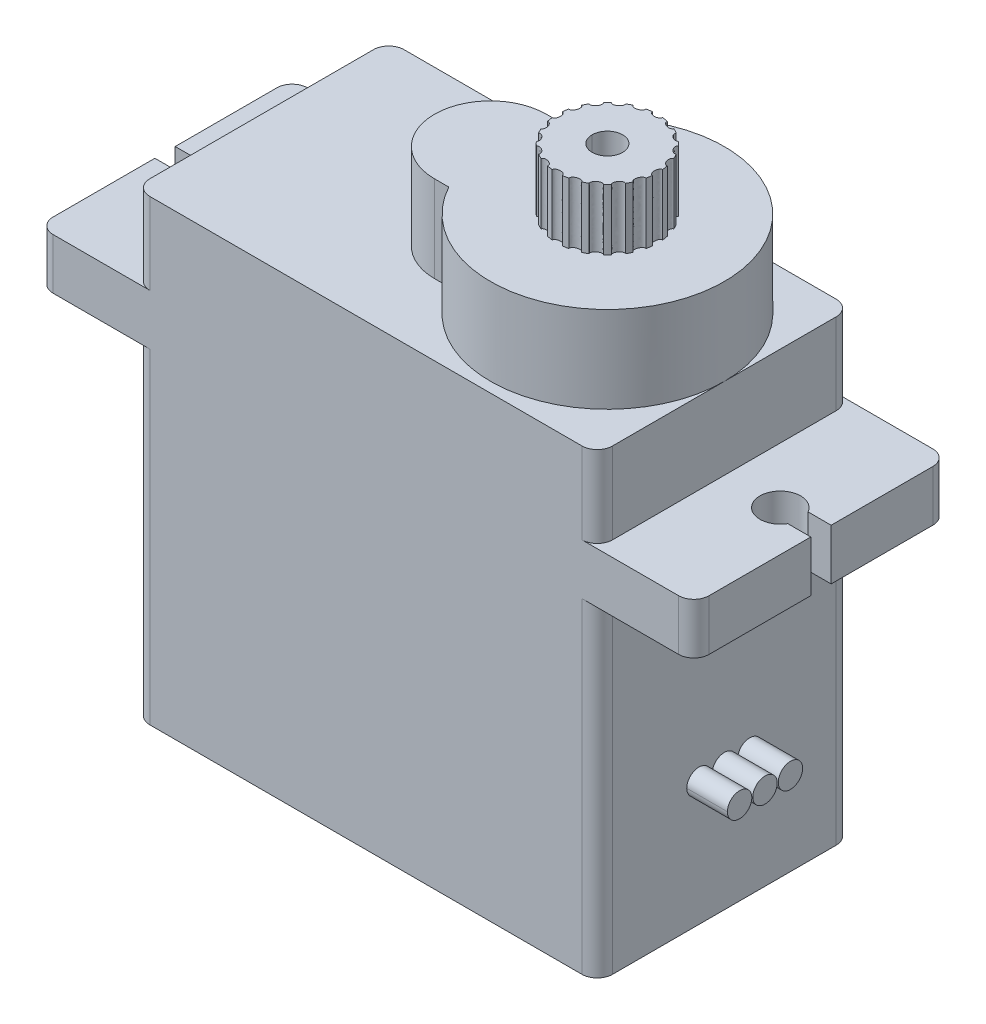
ISO-10303-21;
HEADER;
FILE_DESCRIPTION(('STEP AP214'),'2;1');
FILE_NAME('part.step','',(''),(''),'','','');
FILE_SCHEMA(('AUTOMOTIVE_DESIGN { 1 0 10303 214 1 1 1 1 }'));
ENDSEC;
DATA;
#1=APPLICATION_CONTEXT('core data for automotive mechanical design processes');
#2=APPLICATION_PROTOCOL_DEFINITION('international standard','automotive_design',2000,#1);
#3=PRODUCT_CONTEXT('',#1,'mechanical');
#4=PRODUCT('Part','Part','',(#3));
#5=PRODUCT_RELATED_PRODUCT_CATEGORY('part','',(#4));
#6=PRODUCT_DEFINITION_FORMATION('','',#4);
#7=PRODUCT_DEFINITION_CONTEXT('part definition',#1,'design');
#8=PRODUCT_DEFINITION('design','',#6,#7);
#9=PRODUCT_DEFINITION_SHAPE('','',#8);
#10=(LENGTH_UNIT() NAMED_UNIT(*) SI_UNIT(.MILLI.,.METRE.));
#11=(NAMED_UNIT(*) PLANE_ANGLE_UNIT() SI_UNIT($,.RADIAN.));
#12=(NAMED_UNIT(*) SI_UNIT($,.STERADIAN.) SOLID_ANGLE_UNIT());
#13=UNCERTAINTY_MEASURE_WITH_UNIT(LENGTH_MEASURE(1.E-05),#10,'distance_accuracy_value','');
#14=(GEOMETRIC_REPRESENTATION_CONTEXT(3) GLOBAL_UNCERTAINTY_ASSIGNED_CONTEXT((#13)) GLOBAL_UNIT_ASSIGNED_CONTEXT((#10,
#11,#12)) REPRESENTATION_CONTEXT('',''));
#15=CARTESIAN_POINT('',(0.,0.,0.));
#16=DIRECTION('',(0.,0.,1.));
#17=DIRECTION('',(1.,0.,0.));
#18=AXIS2_PLACEMENT_3D('',#15,#16,#17);
#19=CARTESIAN_POINT('',(6.14814119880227,18.5,-2.41908004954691));
#20=CARTESIAN_POINT('',(6.05543610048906,18.5,-2.13376309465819));
#21=CARTESIAN_POINT('',(6.5309643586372,18.5,-1.97925459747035));
#22=CARTESIAN_POINT('',(6.62366945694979,18.5,-2.26457155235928));
#23=(BOUNDED_CURVE() B_SPLINE_CURVE(3,(#19,#20,#21,#22),.UNSPECIFIED.,.F.,
.F.) B_SPLINE_CURVE_WITH_KNOTS((4,4),(0.,1.),
.UNSPECIFIED.) CURVE() GEOMETRIC_REPRESENTATION_ITEM() RATIONAL_B_SPLINE_CURVE((1.,
0.333333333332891,0.333333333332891,1.)) REPRESENTATION_ITEM(''));
#24=DIRECTION('',(0.,1.,0.));
#25=VECTOR('',#24,1.);
#26=SURFACE_OF_LINEAR_EXTRUSION('',#23,#25);
#27=DIRECTION('',(0.,-1.,0.));
#28=VECTOR('',#27,1.);
#29=CARTESIAN_POINT('',(6.148141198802,18.5,-2.419080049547));
#30=LINE('',#29,#28);
#31=CARTESIAN_POINT('',(6.148141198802,18.5,-2.419080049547));
#32=VERTEX_POINT('',#31);
#33=CARTESIAN_POINT('',(6.148141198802,15.5,-2.419080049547));
#34=VERTEX_POINT('',#33);
#35=EDGE_CURVE('E2117',#32,#34,#30,.T.);
#36=ORIENTED_EDGE('',*,*,#35,.F.);
#37=CARTESIAN_POINT('',(6.14814119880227,18.5,-2.41908004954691));
#38=CARTESIAN_POINT('',(6.05543610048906,18.5,-2.13376309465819));
#39=CARTESIAN_POINT('',(6.5309643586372,18.5,-1.97925459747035));
#40=CARTESIAN_POINT('',(6.62366945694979,18.5,-2.26457155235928));
#41=(BOUNDED_CURVE() B_SPLINE_CURVE(3,(#37,#38,#39,#40),.UNSPECIFIED.,.F.,
.F.) B_SPLINE_CURVE_WITH_KNOTS((4,4),(0.,1.),
.UNSPECIFIED.) CURVE() GEOMETRIC_REPRESENTATION_ITEM() RATIONAL_B_SPLINE_CURVE((1.,
0.333333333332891,0.333333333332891,1.)) REPRESENTATION_ITEM(''));
#42=CARTESIAN_POINT('',(6.62366945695,18.5,-2.264571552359));
#43=VERTEX_POINT('',#42);
#44=EDGE_CURVE('E2202',#32,#43,#41,.T.);
#45=ORIENTED_EDGE('',*,*,#44,.T.);
#46=DIRECTION('',(0.,1.,0.));
#47=VECTOR('',#46,1.);
#48=CARTESIAN_POINT('',(6.62366945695,15.5,-2.264571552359));
#49=LINE('',#48,#47);
#50=CARTESIAN_POINT('',(6.62366945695,15.5,-2.264571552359));
#51=VERTEX_POINT('',#50);
#52=EDGE_CURVE('E2134',#51,#43,#49,.T.);
#53=ORIENTED_EDGE('',*,*,#52,.F.);
#54=CARTESIAN_POINT('',(6.62366945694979,15.5,-2.26457155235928));
#55=CARTESIAN_POINT('',(6.5309643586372,15.5,-1.97925459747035));
#56=CARTESIAN_POINT('',(6.05543610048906,15.5,-2.13376309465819));
#57=CARTESIAN_POINT('',(6.14814119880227,15.5,-2.41908004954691));
#58=(BOUNDED_CURVE() B_SPLINE_CURVE(3,(#54,#55,#56,#57),.UNSPECIFIED.,.F.,
.F.) B_SPLINE_CURVE_WITH_KNOTS((4,4),(0.,1.),
.UNSPECIFIED.) CURVE() GEOMETRIC_REPRESENTATION_ITEM() RATIONAL_B_SPLINE_CURVE((1.,
0.333333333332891,0.333333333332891,1.)) REPRESENTATION_ITEM(''));
#59=EDGE_CURVE('E1265',#51,#34,#58,.T.);
#60=ORIENTED_EDGE('',*,*,#59,.T.);
#61=EDGE_LOOP('',(#36,#45,#53,#60));
#62=FACE_BOUND('',#61,.T.);
#63=ADVANCED_FACE('F16',(#62),#26,.F.);
#64=CARTESIAN_POINT('',(4.62633054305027,18.5,-2.26457155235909));
#65=CARTESIAN_POINT('',(4.71903564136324,18.5,-1.97925459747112));
#66=CARTESIAN_POINT('',(5.19456389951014,18.5,-2.13376309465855));
#67=CARTESIAN_POINT('',(5.10185880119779,18.5,-2.41908004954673));
#68=(BOUNDED_CURVE() B_SPLINE_CURVE(3,(#64,#65,#66,#67),.UNSPECIFIED.,.F.,
.F.) B_SPLINE_CURVE_WITH_KNOTS((4,4),(0.,1.),
.UNSPECIFIED.) CURVE() GEOMETRIC_REPRESENTATION_ITEM() RATIONAL_B_SPLINE_CURVE((1.,
0.333333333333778,0.333333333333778,1.)) REPRESENTATION_ITEM(''));
#69=DIRECTION('',(0.,1.,0.));
#70=VECTOR('',#69,1.);
#71=SURFACE_OF_LINEAR_EXTRUSION('',#68,#70);
#72=DIRECTION('',(0.,-1.,0.));
#73=VECTOR('',#72,1.);
#74=CARTESIAN_POINT('',(4.62633054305,18.5,-2.264571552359));
#75=LINE('',#74,#73);
#76=CARTESIAN_POINT('',(4.62633054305,18.5,-2.264571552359));
#77=VERTEX_POINT('',#76);
#78=CARTESIAN_POINT('',(4.62633054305,15.5,-2.264571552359));
#79=VERTEX_POINT('',#78);
#80=EDGE_CURVE('E2178',#77,#79,#75,.T.);
#81=ORIENTED_EDGE('',*,*,#80,.F.);
#82=CARTESIAN_POINT('',(4.62633054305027,18.5,-2.26457155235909));
#83=CARTESIAN_POINT('',(4.71903564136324,18.5,-1.97925459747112));
#84=CARTESIAN_POINT('',(5.19456389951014,18.5,-2.13376309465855));
#85=CARTESIAN_POINT('',(5.10185880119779,18.5,-2.41908004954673));
#86=(BOUNDED_CURVE() B_SPLINE_CURVE(3,(#82,#83,#84,#85),.UNSPECIFIED.,.F.,
.F.) B_SPLINE_CURVE_WITH_KNOTS((4,4),(0.,1.),
.UNSPECIFIED.) CURVE() GEOMETRIC_REPRESENTATION_ITEM() RATIONAL_B_SPLINE_CURVE((1.,
0.333333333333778,0.333333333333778,1.)) REPRESENTATION_ITEM(''));
#87=CARTESIAN_POINT('',(5.101858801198,18.5,-2.419080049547));
#88=VERTEX_POINT('',#87);
#89=EDGE_CURVE('E2205',#77,#88,#86,.T.);
#90=ORIENTED_EDGE('',*,*,#89,.T.);
#91=DIRECTION('',(0.,1.,0.));
#92=VECTOR('',#91,1.);
#93=CARTESIAN_POINT('',(5.101858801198,15.5,-2.419080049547));
#94=LINE('',#93,#92);
#95=CARTESIAN_POINT('',(5.101858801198,15.5,-2.419080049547));
#96=VERTEX_POINT('',#95);
#97=EDGE_CURVE('E1453',#96,#88,#94,.T.);
#98=ORIENTED_EDGE('',*,*,#97,.F.);
#99=CARTESIAN_POINT('',(5.10185880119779,15.5,-2.41908004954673));
#100=CARTESIAN_POINT('',(5.19456389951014,15.5,-2.13376309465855));
#101=CARTESIAN_POINT('',(4.71903564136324,15.5,-1.97925459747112));
#102=CARTESIAN_POINT('',(4.62633054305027,15.5,-2.26457155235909));
#103=(BOUNDED_CURVE() B_SPLINE_CURVE(3,(#99,#100,#101,#102),.UNSPECIFIED.,.F.,
.F.) B_SPLINE_CURVE_WITH_KNOTS((4,4),(0.,1.),
.UNSPECIFIED.) CURVE() GEOMETRIC_REPRESENTATION_ITEM() RATIONAL_B_SPLINE_CURVE((1.,
0.333333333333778,0.333333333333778,1.)) REPRESENTATION_ITEM(''));
#104=EDGE_CURVE('E1449',#96,#79,#103,.T.);
#105=ORIENTED_EDGE('',*,*,#104,.T.);
#106=EDGE_LOOP('',(#81,#90,#98,#105));
#107=FACE_BOUND('',#106,.T.);
#108=ADVANCED_FACE('F1236',(#107),#71,.F.);
#109=CARTESIAN_POINT('',(3.97541781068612,18.5,-1.84512969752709));
#110=CARTESIAN_POINT('',(4.15175338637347,18.5,-1.60242459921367));
#111=CARTESIAN_POINT('',(4.55626188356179,18.5,-1.89631722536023));
#112=CARTESIAN_POINT('',(4.37992630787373,18.5,-2.13902232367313));
#113=(BOUNDED_CURVE() B_SPLINE_CURVE(3,(#109,#110,#111,#112),.UNSPECIFIED.,.F.,
.F.) B_SPLINE_CURVE_WITH_KNOTS((4,4),(0.,1.),
.UNSPECIFIED.) CURVE() GEOMETRIC_REPRESENTATION_ITEM() RATIONAL_B_SPLINE_CURVE((1.,
0.33333333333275,0.33333333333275,1.)) REPRESENTATION_ITEM(''));
#114=DIRECTION('',(0.,1.,0.));
#115=VECTOR('',#114,1.);
#116=SURFACE_OF_LINEAR_EXTRUSION('',#113,#115);
#117=DIRECTION('',(0.,-1.,0.));
#118=VECTOR('',#117,1.);
#119=CARTESIAN_POINT('',(3.975417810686,18.5,-1.845129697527));
#120=LINE('',#119,#118);
#121=CARTESIAN_POINT('',(3.975417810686,18.5,-1.845129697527));
#122=VERTEX_POINT('',#121);
#123=CARTESIAN_POINT('',(3.975417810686,15.5,-1.845129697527));
#124=VERTEX_POINT('',#123);
#125=EDGE_CURVE('E3615',#122,#124,#120,.T.);
#126=ORIENTED_EDGE('',*,*,#125,.F.);
#127=CARTESIAN_POINT('',(3.97541781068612,18.5,-1.84512969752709));
#128=CARTESIAN_POINT('',(4.15175338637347,18.5,-1.60242459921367));
#129=CARTESIAN_POINT('',(4.55626188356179,18.5,-1.89631722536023));
#130=CARTESIAN_POINT('',(4.37992630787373,18.5,-2.13902232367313));
#131=(BOUNDED_CURVE() B_SPLINE_CURVE(3,(#127,#128,#129,#130),.UNSPECIFIED.,.F.,
.F.) B_SPLINE_CURVE_WITH_KNOTS((4,4),(0.,1.),
.UNSPECIFIED.) CURVE() GEOMETRIC_REPRESENTATION_ITEM() RATIONAL_B_SPLINE_CURVE((1.,
0.33333333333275,0.33333333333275,1.)) REPRESENTATION_ITEM(''));
#132=CARTESIAN_POINT('',(4.379926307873,18.5,-2.139022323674));
#133=VERTEX_POINT('',#132);
#134=EDGE_CURVE('E3448',#122,#133,#131,.T.);
#135=ORIENTED_EDGE('',*,*,#134,.T.);
#136=DIRECTION('',(0.,1.,0.));
#137=VECTOR('',#136,1.);
#138=CARTESIAN_POINT('',(4.379926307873,15.5,-2.139022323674));
#139=LINE('',#138,#137);
#140=CARTESIAN_POINT('',(4.379926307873,15.5,-2.139022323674));
#141=VERTEX_POINT('',#140);
#142=EDGE_CURVE('E2161',#141,#133,#139,.T.);
#143=ORIENTED_EDGE('',*,*,#142,.F.);
#144=CARTESIAN_POINT('',(4.37992630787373,15.5,-2.13902232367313));
#145=CARTESIAN_POINT('',(4.55626188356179,15.5,-1.89631722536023));
#146=CARTESIAN_POINT('',(4.15175338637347,15.5,-1.60242459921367));
#147=CARTESIAN_POINT('',(3.97541781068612,15.5,-1.84512969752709));
#148=(BOUNDED_CURVE() B_SPLINE_CURVE(3,(#144,#145,#146,#147),.UNSPECIFIED.,.F.,
.F.) B_SPLINE_CURVE_WITH_KNOTS((4,4),(0.,1.),
.UNSPECIFIED.) CURVE() GEOMETRIC_REPRESENTATION_ITEM() RATIONAL_B_SPLINE_CURVE((1.,
0.33333333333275,0.33333333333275,1.)) REPRESENTATION_ITEM(''));
#149=EDGE_CURVE('E1466',#141,#124,#148,.T.);
#150=ORIENTED_EDGE('',*,*,#149,.T.);
#151=EDGE_LOOP('',(#126,#135,#143,#150));
#152=FACE_BOUND('',#151,.T.);
#153=ADVANCED_FACE('F1477',(#152),#116,.F.);
#154=CARTESIAN_POINT('',(3.48597767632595,18.5,-1.24507369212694));
#155=CARTESIAN_POINT('',(3.72868277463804,18.5,-1.06873811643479));
#156=CARTESIAN_POINT('',(4.02257540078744,18.5,-1.47324661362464));
#157=CARTESIAN_POINT('',(3.77987030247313,18.5,-1.64958218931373));
#158=(BOUNDED_CURVE() B_SPLINE_CURVE(3,(#154,#155,#156,#157),.UNSPECIFIED.,.F.,
.F.) B_SPLINE_CURVE_WITH_KNOTS((4,4),(0.,1.),
.UNSPECIFIED.) CURVE() GEOMETRIC_REPRESENTATION_ITEM() RATIONAL_B_SPLINE_CURVE((1.,
0.333333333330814,0.333333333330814,1.)) REPRESENTATION_ITEM(''));
#159=DIRECTION('',(0.,1.,0.));
#160=VECTOR('',#159,1.);
#161=SURFACE_OF_LINEAR_EXTRUSION('',#158,#160);
#162=DIRECTION('',(0.,-1.,0.));
#163=VECTOR('',#162,1.);
#164=CARTESIAN_POINT('',(3.485977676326,18.5,-1.245073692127));
#165=LINE('',#164,#163);
#166=CARTESIAN_POINT('',(3.485977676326,18.5,-1.245073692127));
#167=VERTEX_POINT('',#166);
#168=CARTESIAN_POINT('',(3.485977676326,15.5,-1.245073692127));
#169=VERTEX_POINT('',#168);
#170=EDGE_CURVE('E3604',#167,#169,#165,.T.);
#171=ORIENTED_EDGE('',*,*,#170,.F.);
#172=CARTESIAN_POINT('',(3.48597767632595,18.5,-1.24507369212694));
#173=CARTESIAN_POINT('',(3.72868277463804,18.5,-1.06873811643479));
#174=CARTESIAN_POINT('',(4.02257540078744,18.5,-1.47324661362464));
#175=CARTESIAN_POINT('',(3.77987030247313,18.5,-1.64958218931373));
#176=(BOUNDED_CURVE() B_SPLINE_CURVE(3,(#172,#173,#174,#175),.UNSPECIFIED.,.F.,
.F.) B_SPLINE_CURVE_WITH_KNOTS((4,4),(0.,1.),
.UNSPECIFIED.) CURVE() GEOMETRIC_REPRESENTATION_ITEM() RATIONAL_B_SPLINE_CURVE((1.,
0.333333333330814,0.333333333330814,1.)) REPRESENTATION_ITEM(''));
#177=CARTESIAN_POINT('',(3.779870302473,18.5,-1.649582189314));
#178=VERTEX_POINT('',#177);
#179=EDGE_CURVE('E3445',#167,#178,#176,.T.);
#180=ORIENTED_EDGE('',*,*,#179,.T.);
#181=DIRECTION('',(0.,1.,0.));
#182=VECTOR('',#181,1.);
#183=CARTESIAN_POINT('',(3.779870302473,15.5,-1.649582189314));
#184=LINE('',#183,#182);
#185=CARTESIAN_POINT('',(3.779870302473,15.5,-1.649582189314));
#186=VERTEX_POINT('',#185);
#187=EDGE_CURVE('E2186',#186,#178,#184,.T.);
#188=ORIENTED_EDGE('',*,*,#187,.F.);
#189=CARTESIAN_POINT('',(3.77987030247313,15.5,-1.64958218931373));
#190=CARTESIAN_POINT('',(4.02257540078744,15.5,-1.47324661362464));
#191=CARTESIAN_POINT('',(3.72868277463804,15.5,-1.06873811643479));
#192=CARTESIAN_POINT('',(3.48597767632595,15.5,-1.24507369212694));
#193=(BOUNDED_CURVE() B_SPLINE_CURVE(3,(#189,#190,#191,#192),.UNSPECIFIED.,.F.,
.F.) B_SPLINE_CURVE_WITH_KNOTS((4,4),(0.,1.),
.UNSPECIFIED.) CURVE() GEOMETRIC_REPRESENTATION_ITEM() RATIONAL_B_SPLINE_CURVE((1.,
0.333333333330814,0.333333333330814,1.)) REPRESENTATION_ITEM(''));
#194=EDGE_CURVE('E1557',#186,#169,#193,.T.);
#195=ORIENTED_EDGE('',*,*,#194,.T.);
#196=EDGE_LOOP('',(#171,#180,#188,#195));
#197=FACE_BOUND('',#196,.T.);
#198=ADVANCED_FACE('F1486',(#197),#161,.F.);
#199=CARTESIAN_POINT('',(3.20591995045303,18.5,-0.523141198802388));
#200=CARTESIAN_POINT('',(3.49123690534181,18.5,-0.430436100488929));
#201=CARTESIAN_POINT('',(3.64574540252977,18.5,-0.905964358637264));
#202=CARTESIAN_POINT('',(3.36042844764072,18.5,-0.998669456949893));
#203=(BOUNDED_CURVE() B_SPLINE_CURVE(3,(#199,#200,#201,#202),.UNSPECIFIED.,.F.,
.F.) B_SPLINE_CURVE_WITH_KNOTS((4,4),(0.,1.),
.UNSPECIFIED.) CURVE() GEOMETRIC_REPRESENTATION_ITEM() RATIONAL_B_SPLINE_CURVE((1.,
0.333333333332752,0.333333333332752,1.)) REPRESENTATION_ITEM(''));
#204=DIRECTION('',(0.,1.,0.));
#205=VECTOR('',#204,1.);
#206=SURFACE_OF_LINEAR_EXTRUSION('',#203,#205);
#207=DIRECTION('',(0.,-1.,0.));
#208=VECTOR('',#207,1.);
#209=CARTESIAN_POINT('',(3.205919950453,18.5,-0.5231411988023));
#210=LINE('',#209,#208);
#211=CARTESIAN_POINT('',(3.205919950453,18.5,-0.5231411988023));
#212=VERTEX_POINT('',#211);
#213=CARTESIAN_POINT('',(3.205919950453,15.5,-0.5231411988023));
#214=VERTEX_POINT('',#213);
#215=EDGE_CURVE('E3592',#212,#214,#210,.T.);
#216=ORIENTED_EDGE('',*,*,#215,.F.);
#217=CARTESIAN_POINT('',(3.20591995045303,18.5,-0.523141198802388));
#218=CARTESIAN_POINT('',(3.49123690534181,18.5,-0.430436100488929));
#219=CARTESIAN_POINT('',(3.64574540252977,18.5,-0.905964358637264));
#220=CARTESIAN_POINT('',(3.36042844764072,18.5,-0.998669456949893));
#221=(BOUNDED_CURVE() B_SPLINE_CURVE(3,(#217,#218,#219,#220),.UNSPECIFIED.,.F.,
.F.) B_SPLINE_CURVE_WITH_KNOTS((4,4),(0.,1.),
.UNSPECIFIED.) CURVE() GEOMETRIC_REPRESENTATION_ITEM() RATIONAL_B_SPLINE_CURVE((1.,
0.333333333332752,0.333333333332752,1.)) REPRESENTATION_ITEM(''));
#222=CARTESIAN_POINT('',(3.360428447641,18.5,-0.9986694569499));
#223=VERTEX_POINT('',#222);
#224=EDGE_CURVE('E3442',#212,#223,#221,.T.);
#225=ORIENTED_EDGE('',*,*,#224,.T.);
#226=DIRECTION('',(0.,1.,0.));
#227=VECTOR('',#226,1.);
#228=CARTESIAN_POINT('',(3.360428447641,15.5,-0.9986694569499));
#229=LINE('',#228,#227);
#230=CARTESIAN_POINT('',(3.360428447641,15.5,-0.9986694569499));
#231=VERTEX_POINT('',#230);
#232=EDGE_CURVE('E3610',#231,#223,#229,.T.);
#233=ORIENTED_EDGE('',*,*,#232,.F.);
#234=CARTESIAN_POINT('',(3.36042844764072,15.5,-0.998669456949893));
#235=CARTESIAN_POINT('',(3.64574540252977,15.5,-0.905964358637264));
#236=CARTESIAN_POINT('',(3.49123690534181,15.5,-0.430436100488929));
#237=CARTESIAN_POINT('',(3.20591995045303,15.5,-0.523141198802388));
#238=(BOUNDED_CURVE() B_SPLINE_CURVE(3,(#234,#235,#236,#237),.UNSPECIFIED.,.F.,
.F.) B_SPLINE_CURVE_WITH_KNOTS((4,4),(0.,1.),
.UNSPECIFIED.) CURVE() GEOMETRIC_REPRESENTATION_ITEM() RATIONAL_B_SPLINE_CURVE((1.,
0.333333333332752,0.333333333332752,1.)) REPRESENTATION_ITEM(''));
#239=EDGE_CURVE('E1544',#231,#214,#238,.T.);
#240=ORIENTED_EDGE('',*,*,#239,.T.);
#241=EDGE_LOOP('',(#216,#225,#233,#240));
#242=FACE_BOUND('',#241,.T.);
#243=ADVANCED_FACE('F1516',(#242),#206,.F.);
#244=CARTESIAN_POINT('',(3.162658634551,18.5,0.25));
#245=CARTESIAN_POINT('',(3.462658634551,18.5,0.25));
#246=CARTESIAN_POINT('',(3.462658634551,18.5,-0.25));
#247=CARTESIAN_POINT('',(3.162658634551,18.5,-0.25));
#248=(BOUNDED_CURVE() B_SPLINE_CURVE(3,(#244,#245,#246,#247),.UNSPECIFIED.,.F.,
.F.) B_SPLINE_CURVE_WITH_KNOTS((4,4),(0.,1.),
.UNSPECIFIED.) CURVE() GEOMETRIC_REPRESENTATION_ITEM() RATIONAL_B_SPLINE_CURVE((1.,
0.333333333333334,0.333333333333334,1.)) REPRESENTATION_ITEM(''));
#249=DIRECTION('',(0.,1.,0.));
#250=VECTOR('',#249,1.);
#251=SURFACE_OF_LINEAR_EXTRUSION('',#248,#250);
#252=DIRECTION('',(0.,-1.,0.));
#253=VECTOR('',#252,1.);
#254=CARTESIAN_POINT('',(3.162658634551,18.5,0.25));
#255=LINE('',#254,#253);
#256=CARTESIAN_POINT('',(3.162658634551,18.5,0.25));
#257=VERTEX_POINT('',#256);
#258=CARTESIAN_POINT('',(3.162658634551,15.5,0.25));
#259=VERTEX_POINT('',#258);
#260=EDGE_CURVE('E3584',#257,#259,#255,.T.);
#261=ORIENTED_EDGE('',*,*,#260,.F.);
#262=CARTESIAN_POINT('',(3.162658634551,18.5,0.25));
#263=CARTESIAN_POINT('',(3.462658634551,18.5,0.25));
#264=CARTESIAN_POINT('',(3.462658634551,18.5,-0.25));
#265=CARTESIAN_POINT('',(3.162658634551,18.5,-0.25));
#266=(BOUNDED_CURVE() B_SPLINE_CURVE(3,(#262,#263,#264,#265),.UNSPECIFIED.,.F.,
.F.) B_SPLINE_CURVE_WITH_KNOTS((4,4),(0.,1.),
.UNSPECIFIED.) CURVE() GEOMETRIC_REPRESENTATION_ITEM() RATIONAL_B_SPLINE_CURVE((1.,
0.333333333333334,0.333333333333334,1.)) REPRESENTATION_ITEM(''));
#267=CARTESIAN_POINT('',(3.162658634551,18.5,-0.25));
#268=VERTEX_POINT('',#267);
#269=EDGE_CURVE('E3439',#257,#268,#266,.T.);
#270=ORIENTED_EDGE('',*,*,#269,.T.);
#271=DIRECTION('',(0.,1.,0.));
#272=VECTOR('',#271,1.);
#273=CARTESIAN_POINT('',(3.162658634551,15.5,-0.25));
#274=LINE('',#273,#272);
#275=CARTESIAN_POINT('',(3.162658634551,15.5,-0.25));
#276=VERTEX_POINT('',#275);
#277=EDGE_CURVE('E3600',#276,#268,#274,.T.);
#278=ORIENTED_EDGE('',*,*,#277,.F.);
#279=CARTESIAN_POINT('',(3.162658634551,15.5,-0.25));
#280=CARTESIAN_POINT('',(3.462658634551,15.5,-0.25));
#281=CARTESIAN_POINT('',(3.462658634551,15.5,0.25));
#282=CARTESIAN_POINT('',(3.162658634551,15.5,0.25));
#283=(BOUNDED_CURVE() B_SPLINE_CURVE(3,(#279,#280,#281,#282),.UNSPECIFIED.,.F.,
.F.) B_SPLINE_CURVE_WITH_KNOTS((4,4),(0.,1.),
.UNSPECIFIED.) CURVE() GEOMETRIC_REPRESENTATION_ITEM() RATIONAL_B_SPLINE_CURVE((1.,
0.333333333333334,0.333333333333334,1.)) REPRESENTATION_ITEM(''));
#284=EDGE_CURVE('E1559',#276,#259,#283,.T.);
#285=ORIENTED_EDGE('',*,*,#284,.T.);
#286=EDGE_LOOP('',(#261,#270,#278,#285));
#287=FACE_BOUND('',#286,.T.);
#288=ADVANCED_FACE('F1520',(#287),#251,.F.);
#289=CARTESIAN_POINT('',(3.36042844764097,18.5,0.998669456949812));
#290=CARTESIAN_POINT('',(3.64574540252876,18.5,0.905964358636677));
#291=CARTESIAN_POINT('',(3.49123690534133,18.5,0.430436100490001));
#292=CARTESIAN_POINT('',(3.20591995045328,18.5,0.523141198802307));
#293=(BOUNDED_CURVE() B_SPLINE_CURVE(3,(#289,#290,#291,#292),.UNSPECIFIED.,.F.,
.F.) B_SPLINE_CURVE_WITH_KNOTS((4,4),(0.,1.),
.UNSPECIFIED.) CURVE() GEOMETRIC_REPRESENTATION_ITEM() RATIONAL_B_SPLINE_CURVE((1.,
0.333333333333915,0.333333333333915,1.)) REPRESENTATION_ITEM(''));
#294=DIRECTION('',(0.,1.,0.));
#295=VECTOR('',#294,1.);
#296=SURFACE_OF_LINEAR_EXTRUSION('',#293,#295);
#297=DIRECTION('',(0.,-1.,0.));
#298=VECTOR('',#297,1.);
#299=CARTESIAN_POINT('',(3.360428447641,18.5,0.9986694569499));
#300=LINE('',#299,#298);
#301=CARTESIAN_POINT('',(3.360428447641,18.5,0.9986694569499));
#302=VERTEX_POINT('',#301);
#303=CARTESIAN_POINT('',(3.360428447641,15.5,0.9986694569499));
#304=VERTEX_POINT('',#303);
#305=EDGE_CURVE('E3573',#302,#304,#300,.T.);
#306=ORIENTED_EDGE('',*,*,#305,.F.);
#307=CARTESIAN_POINT('',(3.36042844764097,18.5,0.998669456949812));
#308=CARTESIAN_POINT('',(3.64574540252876,18.5,0.905964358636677));
#309=CARTESIAN_POINT('',(3.49123690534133,18.5,0.430436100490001));
#310=CARTESIAN_POINT('',(3.20591995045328,18.5,0.523141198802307));
#311=(BOUNDED_CURVE() B_SPLINE_CURVE(3,(#307,#308,#309,#310),.UNSPECIFIED.,.F.,
.F.) B_SPLINE_CURVE_WITH_KNOTS((4,4),(0.,1.),
.UNSPECIFIED.) CURVE() GEOMETRIC_REPRESENTATION_ITEM() RATIONAL_B_SPLINE_CURVE((1.,
0.333333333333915,0.333333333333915,1.)) REPRESENTATION_ITEM(''));
#312=CARTESIAN_POINT('',(3.205919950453,18.5,0.5231411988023));
#313=VERTEX_POINT('',#312);
#314=EDGE_CURVE('E3436',#302,#313,#311,.T.);
#315=ORIENTED_EDGE('',*,*,#314,.T.);
#316=DIRECTION('',(0.,1.,0.));
#317=VECTOR('',#316,1.);
#318=CARTESIAN_POINT('',(3.205919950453,15.5,0.5231411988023));
#319=LINE('',#318,#317);
#320=CARTESIAN_POINT('',(3.205919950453,15.5,0.5231411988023));
#321=VERTEX_POINT('',#320);
#322=EDGE_CURVE('E3589',#321,#313,#319,.T.);
#323=ORIENTED_EDGE('',*,*,#322,.F.);
#324=CARTESIAN_POINT('',(3.20591995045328,15.5,0.523141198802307));
#325=CARTESIAN_POINT('',(3.49123690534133,15.5,0.430436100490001));
#326=CARTESIAN_POINT('',(3.64574540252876,15.5,0.905964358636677));
#327=CARTESIAN_POINT('',(3.36042844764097,15.5,0.998669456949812));
#328=(BOUNDED_CURVE() B_SPLINE_CURVE(3,(#324,#325,#326,#327),.UNSPECIFIED.,.F.,
.F.) B_SPLINE_CURVE_WITH_KNOTS((4,4),(0.,1.),
.UNSPECIFIED.) CURVE() GEOMETRIC_REPRESENTATION_ITEM() RATIONAL_B_SPLINE_CURVE((1.,
0.333333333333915,0.333333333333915,1.)) REPRESENTATION_ITEM(''));
#329=EDGE_CURVE('E1583',#321,#304,#328,.T.);
#330=ORIENTED_EDGE('',*,*,#329,.T.);
#331=EDGE_LOOP('',(#306,#315,#323,#330));
#332=FACE_BOUND('',#331,.T.);
#333=ADVANCED_FACE('F1598',(#332),#296,.F.);
#334=CARTESIAN_POINT('',(3.77987030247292,18.5,1.64958218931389));
#335=CARTESIAN_POINT('',(4.02257540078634,18.5,1.47324661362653));
#336=CARTESIAN_POINT('',(3.72868277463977,18.5,1.06873811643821));
#337=CARTESIAN_POINT('',(3.48597767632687,18.5,1.24507369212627));
#338=(BOUNDED_CURVE() B_SPLINE_CURVE(3,(#334,#335,#336,#337),.UNSPECIFIED.,.F.,
.F.) B_SPLINE_CURVE_WITH_KNOTS((4,4),(0.,1.),
.UNSPECIFIED.) CURVE() GEOMETRIC_REPRESENTATION_ITEM() RATIONAL_B_SPLINE_CURVE((1.,
0.33333333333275,0.33333333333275,1.)) REPRESENTATION_ITEM(''));
#339=DIRECTION('',(0.,1.,0.));
#340=VECTOR('',#339,1.);
#341=SURFACE_OF_LINEAR_EXTRUSION('',#338,#340);
#342=DIRECTION('',(0.,-1.,0.));
#343=VECTOR('',#342,1.);
#344=CARTESIAN_POINT('',(3.779870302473,18.5,1.649582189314));
#345=LINE('',#344,#343);
#346=CARTESIAN_POINT('',(3.779870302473,18.5,1.649582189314));
#347=VERTEX_POINT('',#346);
#348=CARTESIAN_POINT('',(3.779870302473,15.5,1.649582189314));
#349=VERTEX_POINT('',#348);
#350=EDGE_CURVE('E3565',#347,#349,#345,.T.);
#351=ORIENTED_EDGE('',*,*,#350,.F.);
#352=CARTESIAN_POINT('',(3.77987030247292,18.5,1.64958218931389));
#353=CARTESIAN_POINT('',(4.02257540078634,18.5,1.47324661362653));
#354=CARTESIAN_POINT('',(3.72868277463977,18.5,1.06873811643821));
#355=CARTESIAN_POINT('',(3.48597767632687,18.5,1.24507369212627));
#356=(BOUNDED_CURVE() B_SPLINE_CURVE(3,(#352,#353,#354,#355),.UNSPECIFIED.,.F.,
.F.) B_SPLINE_CURVE_WITH_KNOTS((4,4),(0.,1.),
.UNSPECIFIED.) CURVE() GEOMETRIC_REPRESENTATION_ITEM() RATIONAL_B_SPLINE_CURVE((1.,
0.33333333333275,0.33333333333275,1.)) REPRESENTATION_ITEM(''));
#357=CARTESIAN_POINT('',(3.485977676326,18.5,1.245073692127));
#358=VERTEX_POINT('',#357);
#359=EDGE_CURVE('E3433',#347,#358,#356,.T.);
#360=ORIENTED_EDGE('',*,*,#359,.T.);
#361=DIRECTION('',(0.,1.,0.));
#362=VECTOR('',#361,1.);
#363=CARTESIAN_POINT('',(3.485977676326,15.5,1.245073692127));
#364=LINE('',#363,#362);
#365=CARTESIAN_POINT('',(3.485977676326,15.5,1.245073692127));
#366=VERTEX_POINT('',#365);
#367=EDGE_CURVE('E3574',#366,#358,#364,.T.);
#368=ORIENTED_EDGE('',*,*,#367,.F.);
#369=CARTESIAN_POINT('',(3.48597767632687,15.5,1.24507369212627));
#370=CARTESIAN_POINT('',(3.72868277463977,15.5,1.06873811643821));
#371=CARTESIAN_POINT('',(4.02257540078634,15.5,1.47324661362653));
#372=CARTESIAN_POINT('',(3.77987030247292,15.5,1.64958218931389));
#373=(BOUNDED_CURVE() B_SPLINE_CURVE(3,(#369,#370,#371,#372),.UNSPECIFIED.,.F.,
.F.) B_SPLINE_CURVE_WITH_KNOTS((4,4),(0.,1.),
.UNSPECIFIED.) CURVE() GEOMETRIC_REPRESENTATION_ITEM() RATIONAL_B_SPLINE_CURVE((1.,
0.33333333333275,0.33333333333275,1.)) REPRESENTATION_ITEM(''));
#374=EDGE_CURVE('E1677',#366,#349,#373,.T.);
#375=ORIENTED_EDGE('',*,*,#374,.T.);
#376=EDGE_LOOP('',(#351,#360,#368,#375));
#377=FACE_BOUND('',#376,.T.);
#378=ADVANCED_FACE('F1607',(#377),#341,.F.);
#379=CARTESIAN_POINT('',(4.37992630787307,18.5,2.13902232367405));
#380=CARTESIAN_POINT('',(4.55626188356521,18.5,1.89631722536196));
#381=CARTESIAN_POINT('',(4.15175338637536,18.5,1.60242459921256));
#382=CARTESIAN_POINT('',(3.97541781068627,18.5,1.84512969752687));
#383=(BOUNDED_CURVE() B_SPLINE_CURVE(3,(#379,#380,#381,#382),.UNSPECIFIED.,.F.,
.F.) B_SPLINE_CURVE_WITH_KNOTS((4,4),(0.,1.),
.UNSPECIFIED.) CURVE() GEOMETRIC_REPRESENTATION_ITEM() RATIONAL_B_SPLINE_CURVE((1.,
0.333333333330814,0.333333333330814,1.)) REPRESENTATION_ITEM(''));
#384=DIRECTION('',(0.,1.,0.));
#385=VECTOR('',#384,1.);
#386=SURFACE_OF_LINEAR_EXTRUSION('',#383,#385);
#387=DIRECTION('',(0.,-1.,0.));
#388=VECTOR('',#387,1.);
#389=CARTESIAN_POINT('',(4.379926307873,18.5,2.139022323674));
#390=LINE('',#389,#388);
#391=CARTESIAN_POINT('',(4.379926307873,18.5,2.139022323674));
#392=VERTEX_POINT('',#391);
#393=CARTESIAN_POINT('',(4.379926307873,15.5,2.139022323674));
#394=VERTEX_POINT('',#393);
#395=EDGE_CURVE('E3555',#392,#394,#390,.T.);
#396=ORIENTED_EDGE('',*,*,#395,.F.);
#397=CARTESIAN_POINT('',(4.37992630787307,18.5,2.13902232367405));
#398=CARTESIAN_POINT('',(4.55626188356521,18.5,1.89631722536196));
#399=CARTESIAN_POINT('',(4.15175338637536,18.5,1.60242459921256));
#400=CARTESIAN_POINT('',(3.97541781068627,18.5,1.84512969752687));
#401=(BOUNDED_CURVE() B_SPLINE_CURVE(3,(#397,#398,#399,#400),.UNSPECIFIED.,.F.,
.F.) B_SPLINE_CURVE_WITH_KNOTS((4,4),(0.,1.),
.UNSPECIFIED.) CURVE() GEOMETRIC_REPRESENTATION_ITEM() RATIONAL_B_SPLINE_CURVE((1.,
0.333333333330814,0.333333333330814,1.)) REPRESENTATION_ITEM(''));
#402=CARTESIAN_POINT('',(3.975417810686,18.5,1.845129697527));
#403=VERTEX_POINT('',#402);
#404=EDGE_CURVE('E3430',#392,#403,#401,.T.);
#405=ORIENTED_EDGE('',*,*,#404,.T.);
#406=DIRECTION('',(0.,1.,0.));
#407=VECTOR('',#406,1.);
#408=CARTESIAN_POINT('',(3.975417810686,15.5,1.845129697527));
#409=LINE('',#408,#407);
#410=CARTESIAN_POINT('',(3.975417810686,15.5,1.845129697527));
#411=VERTEX_POINT('',#410);
#412=EDGE_CURVE('E3579',#411,#403,#409,.T.);
#413=ORIENTED_EDGE('',*,*,#412,.F.);
#414=CARTESIAN_POINT('',(3.97541781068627,15.5,1.84512969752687));
#415=CARTESIAN_POINT('',(4.15175338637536,15.5,1.60242459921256));
#416=CARTESIAN_POINT('',(4.55626188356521,15.5,1.89631722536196));
#417=CARTESIAN_POINT('',(4.37992630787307,15.5,2.13902232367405));
#418=(BOUNDED_CURVE() B_SPLINE_CURVE(3,(#414,#415,#416,#417),.UNSPECIFIED.,.F.,
.F.) B_SPLINE_CURVE_WITH_KNOTS((4,4),(0.,1.),
.UNSPECIFIED.) CURVE() GEOMETRIC_REPRESENTATION_ITEM() RATIONAL_B_SPLINE_CURVE((1.,
0.333333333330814,0.333333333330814,1.)) REPRESENTATION_ITEM(''));
#419=EDGE_CURVE('E1665',#411,#394,#418,.T.);
#420=ORIENTED_EDGE('',*,*,#419,.T.);
#421=EDGE_LOOP('',(#396,#405,#413,#420));
#422=FACE_BOUND('',#421,.T.);
#423=ADVANCED_FACE('F1637',(#422),#386,.F.);
#424=CARTESIAN_POINT('',(5.10185880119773,18.5,2.41908004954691));
#425=CARTESIAN_POINT('',(5.19456389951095,18.5,2.13376309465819));
#426=CARTESIAN_POINT('',(4.7190356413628,18.5,1.97925459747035));
#427=CARTESIAN_POINT('',(4.62633054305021,18.5,2.26457155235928));
#428=(BOUNDED_CURVE() B_SPLINE_CURVE(3,(#424,#425,#426,#427),.UNSPECIFIED.,.F.,
.F.) B_SPLINE_CURVE_WITH_KNOTS((4,4),(0.,1.),
.UNSPECIFIED.) CURVE() GEOMETRIC_REPRESENTATION_ITEM() RATIONAL_B_SPLINE_CURVE((1.,
0.33333333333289,0.33333333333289,1.)) REPRESENTATION_ITEM(''));
#429=DIRECTION('',(0.,1.,0.));
#430=VECTOR('',#429,1.);
#431=SURFACE_OF_LINEAR_EXTRUSION('',#428,#430);
#432=DIRECTION('',(0.,-1.,0.));
#433=VECTOR('',#432,1.);
#434=CARTESIAN_POINT('',(5.101858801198,18.5,2.419080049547));
#435=LINE('',#434,#433);
#436=CARTESIAN_POINT('',(5.101858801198,18.5,2.419080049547));
#437=VERTEX_POINT('',#436);
#438=CARTESIAN_POINT('',(5.101858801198,15.5,2.419080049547));
#439=VERTEX_POINT('',#438);
#440=EDGE_CURVE('E3544',#437,#439,#435,.T.);
#441=ORIENTED_EDGE('',*,*,#440,.F.);
#442=CARTESIAN_POINT('',(5.10185880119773,18.5,2.41908004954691));
#443=CARTESIAN_POINT('',(5.19456389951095,18.5,2.13376309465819));
#444=CARTESIAN_POINT('',(4.7190356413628,18.5,1.97925459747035));
#445=CARTESIAN_POINT('',(4.62633054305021,18.5,2.26457155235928));
#446=(BOUNDED_CURVE() B_SPLINE_CURVE(3,(#442,#443,#444,#445),.UNSPECIFIED.,.F.,
.F.) B_SPLINE_CURVE_WITH_KNOTS((4,4),(0.,1.),
.UNSPECIFIED.) CURVE() GEOMETRIC_REPRESENTATION_ITEM() RATIONAL_B_SPLINE_CURVE((1.,
0.33333333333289,0.33333333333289,1.)) REPRESENTATION_ITEM(''));
#447=CARTESIAN_POINT('',(4.62633054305,18.5,2.264571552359));
#448=VERTEX_POINT('',#447);
#449=EDGE_CURVE('E3427',#437,#448,#446,.T.);
#450=ORIENTED_EDGE('',*,*,#449,.T.);
#451=DIRECTION('',(0.,1.,0.));
#452=VECTOR('',#451,1.);
#453=CARTESIAN_POINT('',(4.62633054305,15.5,2.264571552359));
#454=LINE('',#453,#452);
#455=CARTESIAN_POINT('',(4.62633054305,15.5,2.264571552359));
#456=VERTEX_POINT('',#455);
#457=EDGE_CURVE('E3563',#456,#448,#454,.T.);
#458=ORIENTED_EDGE('',*,*,#457,.F.);
#459=CARTESIAN_POINT('',(4.62633054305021,15.5,2.26457155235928));
#460=CARTESIAN_POINT('',(4.7190356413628,15.5,1.97925459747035));
#461=CARTESIAN_POINT('',(5.19456389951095,15.5,2.13376309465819));
#462=CARTESIAN_POINT('',(5.10185880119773,15.5,2.41908004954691));
#463=(BOUNDED_CURVE() B_SPLINE_CURVE(3,(#459,#460,#461,#462),.UNSPECIFIED.,.F.,
.F.) B_SPLINE_CURVE_WITH_KNOTS((4,4),(0.,1.),
.UNSPECIFIED.) CURVE() GEOMETRIC_REPRESENTATION_ITEM() RATIONAL_B_SPLINE_CURVE((1.,
0.33333333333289,0.33333333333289,1.)) REPRESENTATION_ITEM(''));
#464=EDGE_CURVE('E1679',#456,#439,#463,.T.);
#465=ORIENTED_EDGE('',*,*,#464,.T.);
#466=EDGE_LOOP('',(#441,#450,#458,#465));
#467=FACE_BOUND('',#466,.T.);
#468=ADVANCED_FACE('F1641',(#467),#431,.F.);
#469=CARTESIAN_POINT('',(5.875,18.5,2.462341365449));
#470=CARTESIAN_POINT('',(5.875,18.5,2.162341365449));
#471=CARTESIAN_POINT('',(5.37499999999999,18.5,2.162341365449));
#472=CARTESIAN_POINT('',(5.375,18.5,2.462341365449));
#473=(BOUNDED_CURVE() B_SPLINE_CURVE(3,(#469,#470,#471,#472),.UNSPECIFIED.,.F.,
.F.) B_SPLINE_CURVE_WITH_KNOTS((4,4),(0.,1.),
.UNSPECIFIED.) CURVE() GEOMETRIC_REPRESENTATION_ITEM() RATIONAL_B_SPLINE_CURVE((1.,
0.333333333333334,0.333333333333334,1.)) REPRESENTATION_ITEM(''));
#474=DIRECTION('',(0.,1.,0.));
#475=VECTOR('',#474,1.);
#476=SURFACE_OF_LINEAR_EXTRUSION('',#473,#475);
#477=DIRECTION('',(0.,-1.,0.));
#478=VECTOR('',#477,1.);
#479=CARTESIAN_POINT('',(5.875,18.5,2.462341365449));
#480=LINE('',#479,#478);
#481=CARTESIAN_POINT('',(5.875,18.5,2.462341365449));
#482=VERTEX_POINT('',#481);
#483=CARTESIAN_POINT('',(5.875,15.5,2.462341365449));
#484=VERTEX_POINT('',#483);
#485=EDGE_CURVE('E3534',#482,#484,#480,.T.);
#486=ORIENTED_EDGE('',*,*,#485,.F.);
#487=CARTESIAN_POINT('',(5.875,18.5,2.462341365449));
#488=CARTESIAN_POINT('',(5.875,18.5,2.162341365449));
#489=CARTESIAN_POINT('',(5.37499999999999,18.5,2.162341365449));
#490=CARTESIAN_POINT('',(5.375,18.5,2.462341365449));
#491=(BOUNDED_CURVE() B_SPLINE_CURVE(3,(#487,#488,#489,#490),.UNSPECIFIED.,.F.,
.F.) B_SPLINE_CURVE_WITH_KNOTS((4,4),(0.,1.),
.UNSPECIFIED.) CURVE() GEOMETRIC_REPRESENTATION_ITEM() RATIONAL_B_SPLINE_CURVE((1.,
0.333333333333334,0.333333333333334,1.)) REPRESENTATION_ITEM(''));
#492=CARTESIAN_POINT('',(5.375,18.5,2.462341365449));
#493=VERTEX_POINT('',#492);
#494=EDGE_CURVE('E3424',#482,#493,#491,.T.);
#495=ORIENTED_EDGE('',*,*,#494,.T.);
#496=DIRECTION('',(0.,1.,0.));
#497=VECTOR('',#496,1.);
#498=CARTESIAN_POINT('',(5.375,15.5,2.462341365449));
#499=LINE('',#498,#497);
#500=CARTESIAN_POINT('',(5.375,15.5,2.462341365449));
#501=VERTEX_POINT('',#500);
#502=EDGE_CURVE('E3551',#501,#493,#499,.T.);
#503=ORIENTED_EDGE('',*,*,#502,.F.);
#504=CARTESIAN_POINT('',(5.375,15.5,2.462341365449));
#505=CARTESIAN_POINT('',(5.37499999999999,15.5,2.162341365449));
#506=CARTESIAN_POINT('',(5.875,15.5,2.162341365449));
#507=CARTESIAN_POINT('',(5.875,15.5,2.462341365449));
#508=(BOUNDED_CURVE() B_SPLINE_CURVE(3,(#504,#505,#506,#507),.UNSPECIFIED.,.F.,
.F.) B_SPLINE_CURVE_WITH_KNOTS((4,4),(0.,1.),
.UNSPECIFIED.) CURVE() GEOMETRIC_REPRESENTATION_ITEM() RATIONAL_B_SPLINE_CURVE((1.,
0.333333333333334,0.333333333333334,1.)) REPRESENTATION_ITEM(''));
#509=EDGE_CURVE('E1704',#501,#484,#508,.T.);
#510=ORIENTED_EDGE('',*,*,#509,.T.);
#511=EDGE_LOOP('',(#486,#495,#503,#510));
#512=FACE_BOUND('',#511,.T.);
#513=ADVANCED_FACE('F1719',(#512),#476,.F.);
#514=CARTESIAN_POINT('',(6.62366945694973,18.5,2.26457155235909));
#515=CARTESIAN_POINT('',(6.53096435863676,18.5,1.97925459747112));
#516=CARTESIAN_POINT('',(6.05543610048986,18.5,2.13376309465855));
#517=CARTESIAN_POINT('',(6.14814119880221,18.5,2.41908004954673));
#518=(BOUNDED_CURVE() B_SPLINE_CURVE(3,(#514,#515,#516,#517),.UNSPECIFIED.,.F.,
.F.) B_SPLINE_CURVE_WITH_KNOTS((4,4),(0.,1.),
.UNSPECIFIED.) CURVE() GEOMETRIC_REPRESENTATION_ITEM() RATIONAL_B_SPLINE_CURVE((1.,
0.333333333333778,0.333333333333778,1.)) REPRESENTATION_ITEM(''));
#519=DIRECTION('',(0.,1.,0.));
#520=VECTOR('',#519,1.);
#521=SURFACE_OF_LINEAR_EXTRUSION('',#518,#520);
#522=DIRECTION('',(0.,-1.,0.));
#523=VECTOR('',#522,1.);
#524=CARTESIAN_POINT('',(6.62366945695,18.5,2.264571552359));
#525=LINE('',#524,#523);
#526=CARTESIAN_POINT('',(6.62366945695,18.5,2.264571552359));
#527=VERTEX_POINT('',#526);
#528=CARTESIAN_POINT('',(6.62366945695,15.5,2.264571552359));
#529=VERTEX_POINT('',#528);
#530=EDGE_CURVE('E3525',#527,#529,#525,.T.);
#531=ORIENTED_EDGE('',*,*,#530,.F.);
#532=CARTESIAN_POINT('',(6.62366945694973,18.5,2.26457155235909));
#533=CARTESIAN_POINT('',(6.53096435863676,18.5,1.97925459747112));
#534=CARTESIAN_POINT('',(6.05543610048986,18.5,2.13376309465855));
#535=CARTESIAN_POINT('',(6.14814119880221,18.5,2.41908004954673));
#536=(BOUNDED_CURVE() B_SPLINE_CURVE(3,(#532,#533,#534,#535),.UNSPECIFIED.,.F.,
.F.) B_SPLINE_CURVE_WITH_KNOTS((4,4),(0.,1.),
.UNSPECIFIED.) CURVE() GEOMETRIC_REPRESENTATION_ITEM() RATIONAL_B_SPLINE_CURVE((1.,
0.333333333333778,0.333333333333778,1.)) REPRESENTATION_ITEM(''));
#537=CARTESIAN_POINT('',(6.148141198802,18.5,2.419080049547));
#538=VERTEX_POINT('',#537);
#539=EDGE_CURVE('E3421',#527,#538,#536,.T.);
#540=ORIENTED_EDGE('',*,*,#539,.T.);
#541=DIRECTION('',(0.,1.,0.));
#542=VECTOR('',#541,1.);
#543=CARTESIAN_POINT('',(6.148141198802,15.5,2.419080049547));
#544=LINE('',#543,#542);
#545=CARTESIAN_POINT('',(6.148141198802,15.5,2.419080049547));
#546=VERTEX_POINT('',#545);
#547=EDGE_CURVE('E3542',#546,#538,#544,.T.);
#548=ORIENTED_EDGE('',*,*,#547,.F.);
#549=CARTESIAN_POINT('',(6.14814119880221,15.5,2.41908004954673));
#550=CARTESIAN_POINT('',(6.05543610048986,15.5,2.13376309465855));
#551=CARTESIAN_POINT('',(6.53096435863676,15.5,1.97925459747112));
#552=CARTESIAN_POINT('',(6.62366945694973,15.5,2.26457155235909));
#553=(BOUNDED_CURVE() B_SPLINE_CURVE(3,(#549,#550,#551,#552),.UNSPECIFIED.,.F.,
.F.) B_SPLINE_CURVE_WITH_KNOTS((4,4),(0.,1.),
.UNSPECIFIED.) CURVE() GEOMETRIC_REPRESENTATION_ITEM() RATIONAL_B_SPLINE_CURVE((1.,
0.333333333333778,0.333333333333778,1.)) REPRESENTATION_ITEM(''));
#554=EDGE_CURVE('E1799',#546,#529,#553,.T.);
#555=ORIENTED_EDGE('',*,*,#554,.T.);
#556=EDGE_LOOP('',(#531,#540,#548,#555));
#557=FACE_BOUND('',#556,.T.);
#558=ADVANCED_FACE('F1728',(#557),#521,.F.);
#559=CARTESIAN_POINT('',(7.27458218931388,18.5,1.84512969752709));
#560=CARTESIAN_POINT('',(7.09824661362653,18.5,1.60242459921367));
#561=CARTESIAN_POINT('',(6.69373811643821,18.5,1.89631722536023));
#562=CARTESIAN_POINT('',(6.87007369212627,18.5,2.13902232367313));
#563=(BOUNDED_CURVE() B_SPLINE_CURVE(3,(#559,#560,#561,#562),.UNSPECIFIED.,.F.,
.F.) B_SPLINE_CURVE_WITH_KNOTS((4,4),(0.,1.),
.UNSPECIFIED.) CURVE() GEOMETRIC_REPRESENTATION_ITEM() RATIONAL_B_SPLINE_CURVE((1.,
0.333333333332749,0.333333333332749,1.)) REPRESENTATION_ITEM(''));
#564=DIRECTION('',(0.,1.,0.));
#565=VECTOR('',#564,1.);
#566=SURFACE_OF_LINEAR_EXTRUSION('',#563,#565);
#567=DIRECTION('',(0.,-1.,0.));
#568=VECTOR('',#567,1.);
#569=CARTESIAN_POINT('',(7.274582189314,18.5,1.845129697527));
#570=LINE('',#569,#568);
#571=CARTESIAN_POINT('',(7.274582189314,18.5,1.845129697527));
#572=VERTEX_POINT('',#571);
#573=CARTESIAN_POINT('',(7.274582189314,15.5,1.845129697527));
#574=VERTEX_POINT('',#573);
#575=EDGE_CURVE('E3517',#572,#574,#570,.T.);
#576=ORIENTED_EDGE('',*,*,#575,.F.);
#577=CARTESIAN_POINT('',(7.27458218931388,18.5,1.84512969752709));
#578=CARTESIAN_POINT('',(7.09824661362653,18.5,1.60242459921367));
#579=CARTESIAN_POINT('',(6.69373811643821,18.5,1.89631722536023));
#580=CARTESIAN_POINT('',(6.87007369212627,18.5,2.13902232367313));
#581=(BOUNDED_CURVE() B_SPLINE_CURVE(3,(#577,#578,#579,#580),.UNSPECIFIED.,.F.,
.F.) B_SPLINE_CURVE_WITH_KNOTS((4,4),(0.,1.),
.UNSPECIFIED.) CURVE() GEOMETRIC_REPRESENTATION_ITEM() RATIONAL_B_SPLINE_CURVE((1.,
0.333333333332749,0.333333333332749,1.)) REPRESENTATION_ITEM(''));
#582=CARTESIAN_POINT('',(6.870073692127,18.5,2.139022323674));
#583=VERTEX_POINT('',#582);
#584=EDGE_CURVE('E3418',#572,#583,#581,.T.);
#585=ORIENTED_EDGE('',*,*,#584,.T.);
#586=DIRECTION('',(0.,1.,0.));
#587=VECTOR('',#586,1.);
#588=CARTESIAN_POINT('',(6.870073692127,15.5,2.139022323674));
#589=LINE('',#588,#587);
#590=CARTESIAN_POINT('',(6.870073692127,15.5,2.139022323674));
#591=VERTEX_POINT('',#590);
#592=EDGE_CURVE('E3530',#591,#583,#589,.T.);
#593=ORIENTED_EDGE('',*,*,#592,.F.);
#594=CARTESIAN_POINT('',(6.87007369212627,15.5,2.13902232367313));
#595=CARTESIAN_POINT('',(6.69373811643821,15.5,1.89631722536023));
#596=CARTESIAN_POINT('',(7.09824661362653,15.5,1.60242459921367));
#597=CARTESIAN_POINT('',(7.27458218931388,15.5,1.84512969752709));
#598=(BOUNDED_CURVE() B_SPLINE_CURVE(3,(#594,#595,#596,#597),.UNSPECIFIED.,.F.,
.F.) B_SPLINE_CURVE_WITH_KNOTS((4,4),(0.,1.),
.UNSPECIFIED.) CURVE() GEOMETRIC_REPRESENTATION_ITEM() RATIONAL_B_SPLINE_CURVE((1.,
0.333333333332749,0.333333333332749,1.)) REPRESENTATION_ITEM(''));
#599=EDGE_CURVE('E1786',#591,#574,#598,.T.);
#600=ORIENTED_EDGE('',*,*,#599,.T.);
#601=EDGE_LOOP('',(#576,#585,#593,#600));
#602=FACE_BOUND('',#601,.T.);
#603=ADVANCED_FACE('F1758',(#602),#566,.F.);
#604=CARTESIAN_POINT('',(7.76402232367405,18.5,1.24507369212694));
#605=CARTESIAN_POINT('',(7.52131722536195,18.5,1.06873811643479));
#606=CARTESIAN_POINT('',(7.22742459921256,18.5,1.47324661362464));
#607=CARTESIAN_POINT('',(7.47012969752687,18.5,1.64958218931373));
#608=(BOUNDED_CURVE() B_SPLINE_CURVE(3,(#604,#605,#606,#607),.UNSPECIFIED.,.F.,
.F.) B_SPLINE_CURVE_WITH_KNOTS((4,4),(0.,1.),
.UNSPECIFIED.) CURVE() GEOMETRIC_REPRESENTATION_ITEM() RATIONAL_B_SPLINE_CURVE((1.,
0.333333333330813,0.333333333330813,1.)) REPRESENTATION_ITEM(''));
#609=DIRECTION('',(0.,1.,0.));
#610=VECTOR('',#609,1.);
#611=SURFACE_OF_LINEAR_EXTRUSION('',#608,#610);
#612=DIRECTION('',(0.,-1.,0.));
#613=VECTOR('',#612,1.);
#614=CARTESIAN_POINT('',(7.764022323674,18.5,1.245073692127));
#615=LINE('',#614,#613);
#616=CARTESIAN_POINT('',(7.764022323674,18.5,1.245073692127));
#617=VERTEX_POINT('',#616);
#618=CARTESIAN_POINT('',(7.764022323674,15.5,1.245073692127));
#619=VERTEX_POINT('',#618);
#620=EDGE_CURVE('E3509',#617,#619,#615,.T.);
#621=ORIENTED_EDGE('',*,*,#620,.F.);
#622=CARTESIAN_POINT('',(7.76402232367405,18.5,1.24507369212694));
#623=CARTESIAN_POINT('',(7.52131722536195,18.5,1.06873811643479));
#624=CARTESIAN_POINT('',(7.22742459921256,18.5,1.47324661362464));
#625=CARTESIAN_POINT('',(7.47012969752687,18.5,1.64958218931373));
#626=(BOUNDED_CURVE() B_SPLINE_CURVE(3,(#622,#623,#624,#625),.UNSPECIFIED.,.F.,
.F.) B_SPLINE_CURVE_WITH_KNOTS((4,4),(0.,1.),
.UNSPECIFIED.) CURVE() GEOMETRIC_REPRESENTATION_ITEM() RATIONAL_B_SPLINE_CURVE((1.,
0.333333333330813,0.333333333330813,1.)) REPRESENTATION_ITEM(''));
#627=CARTESIAN_POINT('',(7.470129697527,18.5,1.649582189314));
#628=VERTEX_POINT('',#627);
#629=EDGE_CURVE('E3417',#617,#628,#626,.T.);
#630=ORIENTED_EDGE('',*,*,#629,.T.);
#631=DIRECTION('',(0.,1.,0.));
#632=VECTOR('',#631,1.);
#633=CARTESIAN_POINT('',(7.470129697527,15.5,1.649582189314));
#634=LINE('',#633,#632);
#635=CARTESIAN_POINT('',(7.470129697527,15.5,1.649582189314));
#636=VERTEX_POINT('',#635);
#637=EDGE_CURVE('E3522',#636,#628,#634,.T.);
#638=ORIENTED_EDGE('',*,*,#637,.F.);
#639=CARTESIAN_POINT('',(7.47012969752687,15.5,1.64958218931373));
#640=CARTESIAN_POINT('',(7.22742459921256,15.5,1.47324661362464));
#641=CARTESIAN_POINT('',(7.52131722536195,15.5,1.06873811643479));
#642=CARTESIAN_POINT('',(7.76402232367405,15.5,1.24507369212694));
#643=(BOUNDED_CURVE() B_SPLINE_CURVE(3,(#639,#640,#641,#642),.UNSPECIFIED.,.F.,
.F.) B_SPLINE_CURVE_WITH_KNOTS((4,4),(0.,1.),
.UNSPECIFIED.) CURVE() GEOMETRIC_REPRESENTATION_ITEM() RATIONAL_B_SPLINE_CURVE((1.,
0.333333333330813,0.333333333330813,1.)) REPRESENTATION_ITEM(''));
#644=EDGE_CURVE('E1800',#636,#619,#643,.T.);
#645=ORIENTED_EDGE('',*,*,#644,.T.);
#646=EDGE_LOOP('',(#621,#630,#638,#645));
#647=FACE_BOUND('',#646,.T.);
#648=ADVANCED_FACE('F1762',(#647),#611,.F.);
#649=CARTESIAN_POINT('',(8.04408004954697,18.5,0.523141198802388));
#650=CARTESIAN_POINT('',(7.7587630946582,18.5,0.43043610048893));
#651=CARTESIAN_POINT('',(7.60425459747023,18.5,0.905964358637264));
#652=CARTESIAN_POINT('',(7.88957155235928,18.5,0.998669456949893));
#653=(BOUNDED_CURVE() B_SPLINE_CURVE(3,(#649,#650,#651,#652),.UNSPECIFIED.,.F.,
.F.) B_SPLINE_CURVE_WITH_KNOTS((4,4),(0.,1.),
.UNSPECIFIED.) CURVE() GEOMETRIC_REPRESENTATION_ITEM() RATIONAL_B_SPLINE_CURVE((1.,
0.333333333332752,0.333333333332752,1.)) REPRESENTATION_ITEM(''));
#654=DIRECTION('',(0.,1.,0.));
#655=VECTOR('',#654,1.);
#656=SURFACE_OF_LINEAR_EXTRUSION('',#653,#655);
#657=DIRECTION('',(0.,-1.,0.));
#658=VECTOR('',#657,1.);
#659=CARTESIAN_POINT('',(8.044080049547,18.5,0.5231411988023));
#660=LINE('',#659,#658);
#661=CARTESIAN_POINT('',(8.044080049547,18.5,0.5231411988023));
#662=VERTEX_POINT('',#661);
#663=CARTESIAN_POINT('',(8.044080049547,15.5,0.5231411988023));
#664=VERTEX_POINT('',#663);
#665=EDGE_CURVE('E3496',#662,#664,#660,.T.);
#666=ORIENTED_EDGE('',*,*,#665,.F.);
#667=CARTESIAN_POINT('',(8.04408004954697,18.5,0.523141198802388));
#668=CARTESIAN_POINT('',(7.7587630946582,18.5,0.43043610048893));
#669=CARTESIAN_POINT('',(7.60425459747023,18.5,0.905964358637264));
#670=CARTESIAN_POINT('',(7.88957155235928,18.5,0.998669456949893));
#671=(BOUNDED_CURVE() B_SPLINE_CURVE(3,(#667,#668,#669,#670),.UNSPECIFIED.,.F.,
.F.) B_SPLINE_CURVE_WITH_KNOTS((4,4),(0.,1.),
.UNSPECIFIED.) CURVE() GEOMETRIC_REPRESENTATION_ITEM() RATIONAL_B_SPLINE_CURVE((1.,
0.333333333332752,0.333333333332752,1.)) REPRESENTATION_ITEM(''));
#672=CARTESIAN_POINT('',(7.889571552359,18.5,0.9986694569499));
#673=VERTEX_POINT('',#672);
#674=EDGE_CURVE('E3414',#662,#673,#671,.T.);
#675=ORIENTED_EDGE('',*,*,#674,.T.);
#676=DIRECTION('',(0.,1.,0.));
#677=VECTOR('',#676,1.);
#678=CARTESIAN_POINT('',(7.889571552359,15.5,0.9986694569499));
#679=LINE('',#678,#677);
#680=CARTESIAN_POINT('',(7.889571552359,15.5,0.9986694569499));
#681=VERTEX_POINT('',#680);
#682=EDGE_CURVE('E3514',#681,#673,#679,.T.);
#683=ORIENTED_EDGE('',*,*,#682,.F.);
#684=CARTESIAN_POINT('',(7.88957155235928,15.5,0.998669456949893));
#685=CARTESIAN_POINT('',(7.60425459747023,15.5,0.905964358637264));
#686=CARTESIAN_POINT('',(7.7587630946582,15.5,0.43043610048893));
#687=CARTESIAN_POINT('',(8.04408004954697,15.5,0.523141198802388));
#688=(BOUNDED_CURVE() B_SPLINE_CURVE(3,(#684,#685,#686,#687),.UNSPECIFIED.,.F.,
.F.) B_SPLINE_CURVE_WITH_KNOTS((4,4),(0.,1.),
.UNSPECIFIED.) CURVE() GEOMETRIC_REPRESENTATION_ITEM() RATIONAL_B_SPLINE_CURVE((1.,
0.333333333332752,0.333333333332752,1.)) REPRESENTATION_ITEM(''));
#689=EDGE_CURVE('E1826',#681,#664,#688,.T.);
#690=ORIENTED_EDGE('',*,*,#689,.T.);
#691=EDGE_LOOP('',(#666,#675,#683,#690));
#692=FACE_BOUND('',#691,.T.);
#693=ADVANCED_FACE('F1842',(#692),#656,.F.);
#694=CARTESIAN_POINT('',(8.087341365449,18.5,-0.25));
#695=CARTESIAN_POINT('',(7.78734136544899,18.5,-0.25));
#696=CARTESIAN_POINT('',(7.78734136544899,18.5,0.25));
#697=CARTESIAN_POINT('',(8.087341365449,18.5,0.25));
#698=(BOUNDED_CURVE() B_SPLINE_CURVE(3,(#694,#695,#696,#697),.UNSPECIFIED.,.F.,
.F.) B_SPLINE_CURVE_WITH_KNOTS((4,4),(0.,1.),
.UNSPECIFIED.) CURVE() GEOMETRIC_REPRESENTATION_ITEM() RATIONAL_B_SPLINE_CURVE((1.,
0.333333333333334,0.333333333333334,1.)) REPRESENTATION_ITEM(''));
#699=DIRECTION('',(0.,1.,0.));
#700=VECTOR('',#699,1.);
#701=SURFACE_OF_LINEAR_EXTRUSION('',#698,#700);
#702=DIRECTION('',(0.,-1.,0.));
#703=VECTOR('',#702,1.);
#704=CARTESIAN_POINT('',(8.087341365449,18.5,-0.25));
#705=LINE('',#704,#703);
#706=CARTESIAN_POINT('',(8.087341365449,18.5,-0.25));
#707=VERTEX_POINT('',#706);
#708=CARTESIAN_POINT('',(8.087341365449,15.5,-0.25));
#709=VERTEX_POINT('',#708);
#710=EDGE_CURVE('E3483',#707,#709,#705,.T.);
#711=ORIENTED_EDGE('',*,*,#710,.F.);
#712=CARTESIAN_POINT('',(8.087341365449,18.5,-0.25));
#713=CARTESIAN_POINT('',(7.78734136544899,18.5,-0.25));
#714=CARTESIAN_POINT('',(7.78734136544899,18.5,0.25));
#715=CARTESIAN_POINT('',(8.087341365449,18.5,0.25));
#716=(BOUNDED_CURVE() B_SPLINE_CURVE(3,(#712,#713,#714,#715),.UNSPECIFIED.,.F.,
.F.) B_SPLINE_CURVE_WITH_KNOTS((4,4),(0.,1.),
.UNSPECIFIED.) CURVE() GEOMETRIC_REPRESENTATION_ITEM() RATIONAL_B_SPLINE_CURVE((1.,
0.333333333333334,0.333333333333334,1.)) REPRESENTATION_ITEM(''));
#717=CARTESIAN_POINT('',(8.087341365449,18.5,0.25));
#718=VERTEX_POINT('',#717);
#719=EDGE_CURVE('E3411',#707,#718,#716,.T.);
#720=ORIENTED_EDGE('',*,*,#719,.T.);
#721=DIRECTION('',(0.,1.,0.));
#722=VECTOR('',#721,1.);
#723=CARTESIAN_POINT('',(8.087341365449,15.5,0.25));
#724=LINE('',#723,#722);
#725=CARTESIAN_POINT('',(8.087341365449,15.5,0.25));
#726=VERTEX_POINT('',#725);
#727=EDGE_CURVE('E3504',#726,#718,#724,.T.);
#728=ORIENTED_EDGE('',*,*,#727,.F.);
#729=CARTESIAN_POINT('',(8.087341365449,15.5,0.25));
#730=CARTESIAN_POINT('',(7.78734136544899,15.5,0.25));
#731=CARTESIAN_POINT('',(7.78734136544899,15.5,-0.25));
#732=CARTESIAN_POINT('',(8.087341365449,15.5,-0.25));
#733=(BOUNDED_CURVE() B_SPLINE_CURVE(3,(#729,#730,#731,#732),.UNSPECIFIED.,.F.,
.F.) B_SPLINE_CURVE_WITH_KNOTS((4,4),(0.,1.),
.UNSPECIFIED.) CURVE() GEOMETRIC_REPRESENTATION_ITEM() RATIONAL_B_SPLINE_CURVE((1.,
0.333333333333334,0.333333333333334,1.)) REPRESENTATION_ITEM(''));
#734=EDGE_CURVE('E1919',#726,#709,#733,.T.);
#735=ORIENTED_EDGE('',*,*,#734,.T.);
#736=EDGE_LOOP('',(#711,#720,#728,#735));
#737=FACE_BOUND('',#736,.T.);
#738=ADVANCED_FACE('F1851',(#737),#701,.F.);
#739=CARTESIAN_POINT('',(7.88957155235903,18.5,-0.998669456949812));
#740=CARTESIAN_POINT('',(7.60425459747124,18.5,-0.905964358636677));
#741=CARTESIAN_POINT('',(7.75876309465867,18.5,-0.430436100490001));
#742=CARTESIAN_POINT('',(8.04408004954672,18.5,-0.523141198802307));
#743=(BOUNDED_CURVE() B_SPLINE_CURVE(3,(#739,#740,#741,#742),.UNSPECIFIED.,.F.,
.F.) B_SPLINE_CURVE_WITH_KNOTS((4,4),(0.,1.),
.UNSPECIFIED.) CURVE() GEOMETRIC_REPRESENTATION_ITEM() RATIONAL_B_SPLINE_CURVE((1.,
0.333333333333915,0.333333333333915,1.)) REPRESENTATION_ITEM(''));
#744=DIRECTION('',(0.,1.,0.));
#745=VECTOR('',#744,1.);
#746=SURFACE_OF_LINEAR_EXTRUSION('',#743,#745);
#747=DIRECTION('',(0.,-1.,0.));
#748=VECTOR('',#747,1.);
#749=CARTESIAN_POINT('',(7.889571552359,18.5,-0.9986694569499));
#750=LINE('',#749,#748);
#751=CARTESIAN_POINT('',(7.889571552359,18.5,-0.9986694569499));
#752=VERTEX_POINT('',#751);
#753=CARTESIAN_POINT('',(7.889571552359,15.5,-0.9986694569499));
#754=VERTEX_POINT('',#753);
#755=EDGE_CURVE('E3473',#752,#754,#750,.T.);
#756=ORIENTED_EDGE('',*,*,#755,.F.);
#757=CARTESIAN_POINT('',(7.88957155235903,18.5,-0.998669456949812));
#758=CARTESIAN_POINT('',(7.60425459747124,18.5,-0.905964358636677));
#759=CARTESIAN_POINT('',(7.75876309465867,18.5,-0.430436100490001));
#760=CARTESIAN_POINT('',(8.04408004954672,18.5,-0.523141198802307));
#761=(BOUNDED_CURVE() B_SPLINE_CURVE(3,(#757,#758,#759,#760),.UNSPECIFIED.,.F.,
.F.) B_SPLINE_CURVE_WITH_KNOTS((4,4),(0.,1.),
.UNSPECIFIED.) CURVE() GEOMETRIC_REPRESENTATION_ITEM() RATIONAL_B_SPLINE_CURVE((1.,
0.333333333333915,0.333333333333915,1.)) REPRESENTATION_ITEM(''));
#762=CARTESIAN_POINT('',(8.044080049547,18.5,-0.5231411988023));
#763=VERTEX_POINT('',#762);
#764=EDGE_CURVE('E3408',#752,#763,#761,.T.);
#765=ORIENTED_EDGE('',*,*,#764,.T.);
#766=DIRECTION('',(0.,1.,0.));
#767=VECTOR('',#766,1.);
#768=CARTESIAN_POINT('',(8.044080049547,15.5,-0.5231411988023));
#769=LINE('',#768,#767);
#770=CARTESIAN_POINT('',(8.044080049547,15.5,-0.5231411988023));
#771=VERTEX_POINT('',#770);
#772=EDGE_CURVE('E3491',#771,#763,#769,.T.);
#773=ORIENTED_EDGE('',*,*,#772,.F.);
#774=CARTESIAN_POINT('',(8.04408004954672,15.5,-0.523141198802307));
#775=CARTESIAN_POINT('',(7.75876309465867,15.5,-0.430436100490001));
#776=CARTESIAN_POINT('',(7.60425459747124,15.5,-0.905964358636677));
#777=CARTESIAN_POINT('',(7.88957155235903,15.5,-0.998669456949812));
#778=(BOUNDED_CURVE() B_SPLINE_CURVE(3,(#774,#775,#776,#777),.UNSPECIFIED.,.F.,
.F.) B_SPLINE_CURVE_WITH_KNOTS((4,4),(0.,1.),
.UNSPECIFIED.) CURVE() GEOMETRIC_REPRESENTATION_ITEM() RATIONAL_B_SPLINE_CURVE((1.,
0.333333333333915,0.333333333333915,1.)) REPRESENTATION_ITEM(''));
#779=EDGE_CURVE('E1908',#771,#754,#778,.T.);
#780=ORIENTED_EDGE('',*,*,#779,.T.);
#781=EDGE_LOOP('',(#756,#765,#773,#780));
#782=FACE_BOUND('',#781,.T.);
#783=ADVANCED_FACE('F1881',(#782),#746,.F.);
#784=CARTESIAN_POINT('',(7.47012969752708,18.5,-1.64958218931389));
#785=CARTESIAN_POINT('',(7.22742459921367,18.5,-1.47324661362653));
#786=CARTESIAN_POINT('',(7.52131722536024,18.5,-1.06873811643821));
#787=CARTESIAN_POINT('',(7.76402232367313,18.5,-1.24507369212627));
#788=(BOUNDED_CURVE() B_SPLINE_CURVE(3,(#784,#785,#786,#787),.UNSPECIFIED.,.F.,
.F.) B_SPLINE_CURVE_WITH_KNOTS((4,4),(0.,1.),
.UNSPECIFIED.) CURVE() GEOMETRIC_REPRESENTATION_ITEM() RATIONAL_B_SPLINE_CURVE((1.,
0.333333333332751,0.333333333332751,1.)) REPRESENTATION_ITEM(''));
#789=DIRECTION('',(0.,1.,0.));
#790=VECTOR('',#789,1.);
#791=SURFACE_OF_LINEAR_EXTRUSION('',#788,#790);
#792=DIRECTION('',(0.,-1.,0.));
#793=VECTOR('',#792,1.);
#794=CARTESIAN_POINT('',(7.470129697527,18.5,-1.649582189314));
#795=LINE('',#794,#793);
#796=CARTESIAN_POINT('',(7.470129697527,18.5,-1.649582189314));
#797=VERTEX_POINT('',#796);
#798=CARTESIAN_POINT('',(7.470129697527,15.5,-1.649582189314));
#799=VERTEX_POINT('',#798);
#800=EDGE_CURVE('E2138',#797,#799,#795,.T.);
#801=ORIENTED_EDGE('',*,*,#800,.F.);
#802=CARTESIAN_POINT('',(7.47012969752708,18.5,-1.64958218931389));
#803=CARTESIAN_POINT('',(7.22742459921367,18.5,-1.47324661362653));
#804=CARTESIAN_POINT('',(7.52131722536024,18.5,-1.06873811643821));
#805=CARTESIAN_POINT('',(7.76402232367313,18.5,-1.24507369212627));
#806=(BOUNDED_CURVE() B_SPLINE_CURVE(3,(#802,#803,#804,#805),.UNSPECIFIED.,.F.,
.F.) B_SPLINE_CURVE_WITH_KNOTS((4,4),(0.,1.),
.UNSPECIFIED.) CURVE() GEOMETRIC_REPRESENTATION_ITEM() RATIONAL_B_SPLINE_CURVE((1.,
0.333333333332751,0.333333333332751,1.)) REPRESENTATION_ITEM(''));
#807=CARTESIAN_POINT('',(7.764022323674,18.5,-1.245073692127));
#808=VERTEX_POINT('',#807);
#809=EDGE_CURVE('E3405',#797,#808,#806,.T.);
#810=ORIENTED_EDGE('',*,*,#809,.T.);
#811=DIRECTION('',(0.,1.,0.));
#812=VECTOR('',#811,1.);
#813=CARTESIAN_POINT('',(7.764022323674,15.5,-1.245073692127));
#814=LINE('',#813,#812);
#815=CARTESIAN_POINT('',(7.764022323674,15.5,-1.245073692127));
#816=VERTEX_POINT('',#815);
#817=EDGE_CURVE('E3479',#816,#808,#814,.T.);
#818=ORIENTED_EDGE('',*,*,#817,.F.);
#819=CARTESIAN_POINT('',(7.76402232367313,15.5,-1.24507369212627));
#820=CARTESIAN_POINT('',(7.52131722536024,15.5,-1.06873811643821));
#821=CARTESIAN_POINT('',(7.22742459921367,15.5,-1.47324661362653));
#822=CARTESIAN_POINT('',(7.47012969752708,15.5,-1.64958218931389));
#823=(BOUNDED_CURVE() B_SPLINE_CURVE(3,(#819,#820,#821,#822),.UNSPECIFIED.,.F.,
.F.) B_SPLINE_CURVE_WITH_KNOTS((4,4),(0.,1.),
.UNSPECIFIED.) CURVE() GEOMETRIC_REPRESENTATION_ITEM() RATIONAL_B_SPLINE_CURVE((1.,
0.333333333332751,0.333333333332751,1.)) REPRESENTATION_ITEM(''));
#824=EDGE_CURVE('E1921',#816,#799,#823,.T.);
#825=ORIENTED_EDGE('',*,*,#824,.T.);
#826=EDGE_LOOP('',(#801,#810,#818,#825));
#827=FACE_BOUND('',#826,.T.);
#828=ADVANCED_FACE('F1885',(#827),#791,.F.);
#829=CARTESIAN_POINT('',(6.87007369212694,18.5,-2.13902232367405));
#830=CARTESIAN_POINT('',(6.69373811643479,18.5,-1.89631722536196));
#831=CARTESIAN_POINT('',(7.09824661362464,18.5,-1.60242459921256));
#832=CARTESIAN_POINT('',(7.27458218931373,18.5,-1.84512969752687));
#833=(BOUNDED_CURVE() B_SPLINE_CURVE(3,(#829,#830,#831,#832),.UNSPECIFIED.,.F.,
.F.) B_SPLINE_CURVE_WITH_KNOTS((4,4),(0.,1.),
.UNSPECIFIED.) CURVE() GEOMETRIC_REPRESENTATION_ITEM() RATIONAL_B_SPLINE_CURVE((1.,
0.333333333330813,0.333333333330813,1.)) REPRESENTATION_ITEM(''));
#834=DIRECTION('',(0.,1.,0.));
#835=VECTOR('',#834,1.);
#836=SURFACE_OF_LINEAR_EXTRUSION('',#833,#835);
#837=DIRECTION('',(0.,-1.,0.));
#838=VECTOR('',#837,1.);
#839=CARTESIAN_POINT('',(6.870073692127,18.5,-2.139022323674));
#840=LINE('',#839,#838);
#841=CARTESIAN_POINT('',(6.870073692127,18.5,-2.139022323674));
#842=VERTEX_POINT('',#841);
#843=CARTESIAN_POINT('',(6.870073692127,15.5,-2.139022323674));
#844=VERTEX_POINT('',#843);
#845=EDGE_CURVE('E1994',#842,#844,#840,.T.);
#846=ORIENTED_EDGE('',*,*,#845,.F.);
#847=CARTESIAN_POINT('',(6.87007369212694,18.5,-2.13902232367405));
#848=CARTESIAN_POINT('',(6.69373811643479,18.5,-1.89631722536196));
#849=CARTESIAN_POINT('',(7.09824661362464,18.5,-1.60242459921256));
#850=CARTESIAN_POINT('',(7.27458218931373,18.5,-1.84512969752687));
#851=(BOUNDED_CURVE() B_SPLINE_CURVE(3,(#847,#848,#849,#850),.UNSPECIFIED.,.F.,
.F.) B_SPLINE_CURVE_WITH_KNOTS((4,4),(0.,1.),
.UNSPECIFIED.) CURVE() GEOMETRIC_REPRESENTATION_ITEM() RATIONAL_B_SPLINE_CURVE((1.,
0.333333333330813,0.333333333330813,1.)) REPRESENTATION_ITEM(''));
#852=CARTESIAN_POINT('',(7.274582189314,18.5,-1.845129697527));
#853=VERTEX_POINT('',#852);
#854=EDGE_CURVE('E1212',#842,#853,#851,.T.);
#855=ORIENTED_EDGE('',*,*,#854,.T.);
#856=DIRECTION('',(0.,1.,0.));
#857=VECTOR('',#856,1.);
#858=CARTESIAN_POINT('',(7.274582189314,15.5,-1.845129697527));
#859=LINE('',#858,#857);
#860=CARTESIAN_POINT('',(7.274582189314,15.5,-1.845129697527));
#861=VERTEX_POINT('',#860);
#862=EDGE_CURVE('E3469',#861,#853,#859,.T.);
#863=ORIENTED_EDGE('',*,*,#862,.F.);
#864=CARTESIAN_POINT('',(7.27458218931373,15.5,-1.84512969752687));
#865=CARTESIAN_POINT('',(7.09824661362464,15.5,-1.60242459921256));
#866=CARTESIAN_POINT('',(6.69373811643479,15.5,-1.89631722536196));
#867=CARTESIAN_POINT('',(6.87007369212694,15.5,-2.13902232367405));
#868=(BOUNDED_CURVE() B_SPLINE_CURVE(3,(#864,#865,#866,#867),.UNSPECIFIED.,.F.,
.F.) B_SPLINE_CURVE_WITH_KNOTS((4,4),(0.,1.),
.UNSPECIFIED.) CURVE() GEOMETRIC_REPRESENTATION_ITEM() RATIONAL_B_SPLINE_CURVE((1.,
0.333333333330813,0.333333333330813,1.)) REPRESENTATION_ITEM(''));
#869=EDGE_CURVE('E1404',#861,#844,#868,.T.);
#870=ORIENTED_EDGE('',*,*,#869,.T.);
#871=EDGE_LOOP('',(#846,#855,#863,#870));
#872=FACE_BOUND('',#871,.T.);
#873=ADVANCED_FACE('F1955',(#872),#836,.F.);
#874=CARTESIAN_POINT('',(5.625,12.5,0.));
#875=DIRECTION('',(0.,1.,0.));
#876=DIRECTION('',(1.,0.,0.));
#877=AXIS2_PLACEMENT_3D('',#874,#875,#876);
#878=CYLINDRICAL_SURFACE('',#877,0.75);
#879=DIRECTION('',(0.,1.,0.));
#880=VECTOR('',#879,1.);
#881=CARTESIAN_POINT('',(6.375,13.5,0.));
#882=LINE('',#881,#880);
#883=CARTESIAN_POINT('',(6.375,13.5,0.));
#884=VERTEX_POINT('',#883);
#885=CARTESIAN_POINT('',(6.375,18.5,0.));
#886=VERTEX_POINT('',#885);
#887=EDGE_CURVE('E1215',#884,#886,#882,.T.);
#888=ORIENTED_EDGE('',*,*,#887,.T.);
#889=CARTESIAN_POINT('',(5.625,18.5,0.));
#890=DIRECTION('',(0.,-1.,0.));
#891=DIRECTION('',(-1.,0.,0.));
#892=AXIS2_PLACEMENT_3D('',#889,#890,#891);
#893=CIRCLE('',#892,0.75);
#894=CARTESIAN_POINT('',(4.875,18.5,0.));
#895=VERTEX_POINT('',#894);
#896=EDGE_CURVE('E1208',#895,#886,#893,.T.);
#897=ORIENTED_EDGE('',*,*,#896,.F.);
#898=DIRECTION('',(0.,1.,0.));
#899=VECTOR('',#898,1.);
#900=CARTESIAN_POINT('',(4.875,13.5,0.));
#901=LINE('',#900,#899);
#902=CARTESIAN_POINT('',(4.875,13.5,0.));
#903=VERTEX_POINT('',#902);
#904=EDGE_CURVE('E1207',#903,#895,#901,.T.);
#905=ORIENTED_EDGE('',*,*,#904,.F.);
#906=CARTESIAN_POINT('',(5.625,13.5,0.));
#907=DIRECTION('',(0.,1.,0.));
#908=DIRECTION('',(1.,0.,0.));
#909=AXIS2_PLACEMENT_3D('',#906,#907,#908);
#910=CIRCLE('',#909,0.75);
#911=EDGE_CURVE('E10',#884,#903,#910,.T.);
#912=ORIENTED_EDGE('',*,*,#911,.F.);
#913=EDGE_LOOP('',(#888,#897,#905,#912));
#914=FACE_BOUND('',#913,.T.);
#915=ADVANCED_FACE('F1238',(#914),#878,.F.);
#916=CARTESIAN_POINT('',(0.,13.5,-6.25));
#917=DIRECTION('',(0.,1.,0.));
#918=DIRECTION('',(1.,0.,0.));
#919=AXIS2_PLACEMENT_3D('',#916,#917,#918);
#920=PLANE('',#919);
#921=ORIENTED_EDGE('',*,*,#911,.T.);
#922=CARTESIAN_POINT('',(5.625,13.5,0.));
#923=DIRECTION('',(0.,1.,0.));
#924=DIRECTION('',(-1.,0.,0.));
#925=AXIS2_PLACEMENT_3D('',#922,#923,#924);
#926=CIRCLE('',#925,0.75);
#927=EDGE_CURVE('E30',#903,#884,#926,.T.);
#928=ORIENTED_EDGE('',*,*,#927,.T.);
#929=EDGE_LOOP('',(#921,#928));
#930=FACE_BOUND('',#929,.T.);
#931=ADVANCED_FACE('F2223',(#930),#920,.T.);
#932=CARTESIAN_POINT('',(5.625,12.5,0.));
#933=DIRECTION('',(0.,1.,0.));
#934=DIRECTION('',(1.,0.,0.));
#935=AXIS2_PLACEMENT_3D('',#932,#933,#934);
#936=CYLINDRICAL_SURFACE('',#935,0.75);
#937=ORIENTED_EDGE('',*,*,#904,.T.);
#938=CARTESIAN_POINT('',(5.625,18.5,0.));
#939=DIRECTION('',(0.,-1.,0.));
#940=DIRECTION('',(1.,0.,0.));
#941=AXIS2_PLACEMENT_3D('',#938,#939,#940);
#942=CIRCLE('',#941,0.75);
#943=EDGE_CURVE('E1203',#886,#895,#942,.T.);
#944=ORIENTED_EDGE('',*,*,#943,.F.);
#945=ORIENTED_EDGE('',*,*,#887,.F.);
#946=ORIENTED_EDGE('',*,*,#927,.F.);
#947=EDGE_LOOP('',(#937,#944,#945,#946));
#948=FACE_BOUND('',#947,.T.);
#949=ADVANCED_FACE('F2006',(#948),#936,.F.);
#950=CARTESIAN_POINT('',(0.,18.5,-6.25));
#951=DIRECTION('',(0.,1.,0.));
#952=DIRECTION('',(1.,0.,0.));
#953=AXIS2_PLACEMENT_3D('',#950,#951,#952);
#954=PLANE('',#953);
#955=ORIENTED_EDGE('',*,*,#896,.T.);
#956=ORIENTED_EDGE('',*,*,#943,.T.);
#957=EDGE_LOOP('',(#955,#956));
#958=FACE_BOUND('',#957,.T.);
#959=ORIENTED_EDGE('',*,*,#44,.F.);
#960=CARTESIAN_POINT('',(5.625,18.5,0.));
#961=DIRECTION('',(0.,1.,0.));
#962=DIRECTION('',(0.211370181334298,0.,-0.977406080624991));
#963=AXIS2_PLACEMENT_3D('',#960,#961,#962);
#964=CIRCLE('',#963,2.475);
#965=CARTESIAN_POINT('',(5.875,18.5,-2.462341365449));
#966=VERTEX_POINT('',#965);
#967=EDGE_CURVE('E2126',#32,#966,#964,.T.);
#968=ORIENTED_EDGE('',*,*,#967,.T.);
#969=CARTESIAN_POINT('',(5.375,18.5,-2.462341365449));
#970=CARTESIAN_POINT('',(5.37499999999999,18.5,-2.162341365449));
#971=CARTESIAN_POINT('',(5.875,18.5,-2.162341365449));
#972=CARTESIAN_POINT('',(5.875,18.5,-2.462341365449));
#973=(BOUNDED_CURVE() B_SPLINE_CURVE(3,(#969,#970,#971,#972),.UNSPECIFIED.,.F.,
.F.) B_SPLINE_CURVE_WITH_KNOTS((4,4),(0.,1.),
.UNSPECIFIED.) CURVE() GEOMETRIC_REPRESENTATION_ITEM() RATIONAL_B_SPLINE_CURVE((1.,
0.333333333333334,0.333333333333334,1.)) REPRESENTATION_ITEM(''));
#974=CARTESIAN_POINT('',(5.375,18.5,-2.462341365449));
#975=VERTEX_POINT('',#974);
#976=EDGE_CURVE('E2125',#975,#966,#973,.T.);
#977=ORIENTED_EDGE('',*,*,#976,.F.);
#978=CARTESIAN_POINT('',(5.625,18.5,0.));
#979=DIRECTION('',(0.,1.,0.));
#980=DIRECTION('',(-0.101010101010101,0.,-0.994885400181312));
#981=AXIS2_PLACEMENT_3D('',#978,#979,#980);
#982=CIRCLE('',#981,2.475);
#983=EDGE_CURVE('E1457',#975,#88,#982,.T.);
#984=ORIENTED_EDGE('',*,*,#983,.T.);
#985=ORIENTED_EDGE('',*,*,#89,.F.);
#986=CARTESIAN_POINT('',(5.625,18.5,0.));
#987=DIRECTION('',(0.,1.,0.));
#988=DIRECTION('',(-0.403502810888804,0.,-0.91497840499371));
#989=AXIS2_PLACEMENT_3D('',#986,#987,#988);
#990=CIRCLE('',#989,2.475);
#991=EDGE_CURVE('E2184',#77,#133,#990,.T.);
#992=ORIENTED_EDGE('',*,*,#991,.T.);
#993=ORIENTED_EDGE('',*,*,#134,.F.);
#994=CARTESIAN_POINT('',(5.625,18.5,0.));
#995=DIRECTION('',(0.,1.,0.));
#996=DIRECTION('',(-0.666497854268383,0.,-0.745506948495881));
#997=AXIS2_PLACEMENT_3D('',#994,#995,#996);
#998=CIRCLE('',#997,2.475);
#999=EDGE_CURVE('E2191',#122,#178,#998,.T.);
#1000=ORIENTED_EDGE('',*,*,#999,.T.);
#1001=ORIENTED_EDGE('',*,*,#179,.F.);
#1002=CARTESIAN_POINT('',(5.625,18.5,0.));
#1003=DIRECTION('',(0.,1.,0.));
#1004=DIRECTION('',(-0.864251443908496,0.,-0.503060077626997));
#1005=AXIS2_PLACEMENT_3D('',#1002,#1003,#1004);
#1006=CIRCLE('',#1005,2.475);
#1007=EDGE_CURVE('E3606',#167,#223,#1006,.T.);
#1008=ORIENTED_EDGE('',*,*,#1007,.T.);
#1009=ORIENTED_EDGE('',*,*,#224,.F.);
#1010=CARTESIAN_POINT('',(5.625,18.5,0.));
#1011=DIRECTION('',(0.,1.,0.));
#1012=DIRECTION('',(-0.977406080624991,0.,-0.211370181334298));
#1013=AXIS2_PLACEMENT_3D('',#1010,#1011,#1012);
#1014=CIRCLE('',#1013,2.475);
#1015=EDGE_CURVE('E3596',#212,#268,#1014,.T.);
#1016=ORIENTED_EDGE('',*,*,#1015,.T.);
#1017=ORIENTED_EDGE('',*,*,#269,.F.);
#1018=CARTESIAN_POINT('',(5.625,18.5,0.));
#1019=DIRECTION('',(0.,1.,0.));
#1020=DIRECTION('',(-0.994885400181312,0.,0.101010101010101));
#1021=AXIS2_PLACEMENT_3D('',#1018,#1019,#1020);
#1022=CIRCLE('',#1021,2.475);
#1023=EDGE_CURVE('E3588',#257,#313,#1022,.T.);
#1024=ORIENTED_EDGE('',*,*,#1023,.T.);
#1025=ORIENTED_EDGE('',*,*,#314,.F.);
#1026=CARTESIAN_POINT('',(5.625,18.5,0.));
#1027=DIRECTION('',(0.,1.,0.));
#1028=DIRECTION('',(-0.91497840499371,0.,0.403502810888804));
#1029=AXIS2_PLACEMENT_3D('',#1026,#1027,#1028);
#1030=CIRCLE('',#1029,2.475);
#1031=EDGE_CURVE('E3569',#302,#358,#1030,.T.);
#1032=ORIENTED_EDGE('',*,*,#1031,.T.);
#1033=ORIENTED_EDGE('',*,*,#359,.F.);
#1034=CARTESIAN_POINT('',(5.625,18.5,0.));
#1035=DIRECTION('',(0.,1.,0.));
#1036=DIRECTION('',(-0.745506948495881,0.,0.666497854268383));
#1037=AXIS2_PLACEMENT_3D('',#1034,#1035,#1036);
#1038=CIRCLE('',#1037,2.475);
#1039=EDGE_CURVE('E3568',#347,#403,#1038,.T.);
#1040=ORIENTED_EDGE('',*,*,#1039,.T.);
#1041=ORIENTED_EDGE('',*,*,#404,.F.);
#1042=CARTESIAN_POINT('',(5.625,18.5,0.));
#1043=DIRECTION('',(0.,1.,0.));
#1044=DIRECTION('',(-0.503060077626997,0.,0.864251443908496));
#1045=AXIS2_PLACEMENT_3D('',#1042,#1043,#1044);
#1046=CIRCLE('',#1045,2.475);
#1047=EDGE_CURVE('E3559',#392,#448,#1046,.T.);
#1048=ORIENTED_EDGE('',*,*,#1047,.T.);
#1049=ORIENTED_EDGE('',*,*,#449,.F.);
#1050=CARTESIAN_POINT('',(5.625,18.5,0.));
#1051=DIRECTION('',(0.,1.,0.));
#1052=DIRECTION('',(-0.211370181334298,0.,0.977406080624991));
#1053=AXIS2_PLACEMENT_3D('',#1050,#1051,#1052);
#1054=CIRCLE('',#1053,2.475);
#1055=EDGE_CURVE('E3547',#437,#493,#1054,.T.);
#1056=ORIENTED_EDGE('',*,*,#1055,.T.);
#1057=ORIENTED_EDGE('',*,*,#494,.F.);
#1058=CARTESIAN_POINT('',(5.625,18.5,0.));
#1059=DIRECTION('',(0.,1.,0.));
#1060=DIRECTION('',(0.101010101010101,0.,0.994885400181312));
#1061=AXIS2_PLACEMENT_3D('',#1058,#1059,#1060);
#1062=CIRCLE('',#1061,2.475);
#1063=EDGE_CURVE('E3538',#482,#538,#1062,.T.);
#1064=ORIENTED_EDGE('',*,*,#1063,.T.);
#1065=ORIENTED_EDGE('',*,*,#539,.F.);
#1066=CARTESIAN_POINT('',(5.625,18.5,0.));
#1067=DIRECTION('',(0.,1.,0.));
#1068=DIRECTION('',(0.403502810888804,0.,0.91497840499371));
#1069=AXIS2_PLACEMENT_3D('',#1066,#1067,#1068);
#1070=CIRCLE('',#1069,2.475);
#1071=EDGE_CURVE('E3529',#527,#583,#1070,.T.);
#1072=ORIENTED_EDGE('',*,*,#1071,.T.);
#1073=ORIENTED_EDGE('',*,*,#584,.F.);
#1074=CARTESIAN_POINT('',(5.625,18.5,0.));
#1075=DIRECTION('',(0.,1.,0.));
#1076=DIRECTION('',(0.666497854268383,0.,0.745506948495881));
#1077=AXIS2_PLACEMENT_3D('',#1074,#1075,#1076);
#1078=CIRCLE('',#1077,2.475);
#1079=EDGE_CURVE('E3521',#572,#628,#1078,.T.);
#1080=ORIENTED_EDGE('',*,*,#1079,.T.);
#1081=ORIENTED_EDGE('',*,*,#629,.F.);
#1082=CARTESIAN_POINT('',(5.625,18.5,0.));
#1083=DIRECTION('',(0.,1.,0.));
#1084=DIRECTION('',(0.864251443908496,0.,0.503060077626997));
#1085=AXIS2_PLACEMENT_3D('',#1082,#1083,#1084);
#1086=CIRCLE('',#1085,2.475);
#1087=EDGE_CURVE('E3513',#617,#673,#1086,.T.);
#1088=ORIENTED_EDGE('',*,*,#1087,.T.);
#1089=ORIENTED_EDGE('',*,*,#674,.F.);
#1090=CARTESIAN_POINT('',(5.625,18.5,0.));
#1091=DIRECTION('',(0.,1.,0.));
#1092=DIRECTION('',(0.977406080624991,0.,0.211370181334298));
#1093=AXIS2_PLACEMENT_3D('',#1090,#1091,#1092);
#1094=CIRCLE('',#1093,2.475);
#1095=EDGE_CURVE('E3500',#662,#718,#1094,.T.);
#1096=ORIENTED_EDGE('',*,*,#1095,.T.);
#1097=ORIENTED_EDGE('',*,*,#719,.F.);
#1098=CARTESIAN_POINT('',(5.625,18.5,0.));
#1099=DIRECTION('',(0.,1.,0.));
#1100=DIRECTION('',(0.994885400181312,0.,-0.101010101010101));
#1101=AXIS2_PLACEMENT_3D('',#1098,#1099,#1100);
#1102=CIRCLE('',#1101,2.475);
#1103=EDGE_CURVE('E3487',#707,#763,#1102,.T.);
#1104=ORIENTED_EDGE('',*,*,#1103,.T.);
#1105=ORIENTED_EDGE('',*,*,#764,.F.);
#1106=CARTESIAN_POINT('',(5.625,18.5,0.));
#1107=DIRECTION('',(0.,1.,0.));
#1108=DIRECTION('',(0.91497840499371,0.,-0.403502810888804));
#1109=AXIS2_PLACEMENT_3D('',#1106,#1107,#1108);
#1110=CIRCLE('',#1109,2.475);
#1111=EDGE_CURVE('E3475',#752,#808,#1110,.T.);
#1112=ORIENTED_EDGE('',*,*,#1111,.T.);
#1113=ORIENTED_EDGE('',*,*,#809,.F.);
#1114=CARTESIAN_POINT('',(5.625,18.5,0.));
#1115=DIRECTION('',(0.,1.,0.));
#1116=DIRECTION('',(0.745506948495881,0.,-0.666497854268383));
#1117=AXIS2_PLACEMENT_3D('',#1114,#1115,#1116);
#1118=CIRCLE('',#1117,2.475);
#1119=EDGE_CURVE('E3466',#797,#853,#1118,.T.);
#1120=ORIENTED_EDGE('',*,*,#1119,.T.);
#1121=ORIENTED_EDGE('',*,*,#854,.F.);
#1122=CARTESIAN_POINT('',(5.625,18.5,0.));
#1123=DIRECTION('',(0.,1.,0.));
#1124=DIRECTION('',(0.503060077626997,0.,-0.864251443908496));
#1125=AXIS2_PLACEMENT_3D('',#1122,#1123,#1124);
#1126=CIRCLE('',#1125,2.475);
#1127=EDGE_CURVE('E2137',#842,#43,#1126,.T.);
#1128=ORIENTED_EDGE('',*,*,#1127,.T.);
#1129=EDGE_LOOP('',(#959,#968,#977,#984,#985,#992,#993,#1000,#1001,#1008,#1009,#1016,#1017,
#1024,#1025,#1032,#1033,#1040,#1041,#1048,#1049,#1056,#1057,#1064,#1065,#1072,#1073,#1080,#1081,
#1088,#1089,#1096,#1097,#1104,#1105,#1112,#1113,#1120,#1121,#1128));
#1130=FACE_BOUND('',#1129,.T.);
#1131=ADVANCED_FACE('F1996',(#958,#1130),#954,.T.);
#1132=CARTESIAN_POINT('',(5.375,18.5,-2.462341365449));
#1133=CARTESIAN_POINT('',(5.37499999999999,18.5,-2.162341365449));
#1134=CARTESIAN_POINT('',(5.875,18.5,-2.162341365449));
#1135=CARTESIAN_POINT('',(5.875,18.5,-2.462341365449));
#1136=(BOUNDED_CURVE() B_SPLINE_CURVE(3,(#1132,#1133,#1134,#1135),.UNSPECIFIED.,.F.,
.F.) B_SPLINE_CURVE_WITH_KNOTS((4,4),(0.,1.),
.UNSPECIFIED.) CURVE() GEOMETRIC_REPRESENTATION_ITEM() RATIONAL_B_SPLINE_CURVE((1.,
0.333333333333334,0.333333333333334,1.)) REPRESENTATION_ITEM(''));
#1137=DIRECTION('',(0.,1.,0.));
#1138=VECTOR('',#1137,1.);
#1139=SURFACE_OF_LINEAR_EXTRUSION('',#1136,#1138);
#1140=DIRECTION('',(0.,-1.,0.));
#1141=VECTOR('',#1140,1.);
#1142=CARTESIAN_POINT('',(5.375,18.5,-2.462341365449));
#1143=LINE('',#1142,#1141);
#1144=CARTESIAN_POINT('',(5.375,15.5,-2.462341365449));
#1145=VERTEX_POINT('',#1144);
#1146=EDGE_CURVE('E1430',#975,#1145,#1143,.T.);
#1147=ORIENTED_EDGE('',*,*,#1146,.F.);
#1148=ORIENTED_EDGE('',*,*,#976,.T.);
#1149=DIRECTION('',(0.,1.,0.));
#1150=VECTOR('',#1149,1.);
#1151=CARTESIAN_POINT('',(5.875,15.5,-2.462341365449));
#1152=LINE('',#1151,#1150);
#1153=CARTESIAN_POINT('',(5.875,15.5,-2.462341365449));
#1154=VERTEX_POINT('',#1153);
#1155=EDGE_CURVE('E1432',#1154,#966,#1152,.T.);
#1156=ORIENTED_EDGE('',*,*,#1155,.F.);
#1157=CARTESIAN_POINT('',(5.875,15.5,-2.462341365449));
#1158=CARTESIAN_POINT('',(5.875,15.5,-2.162341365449));
#1159=CARTESIAN_POINT('',(5.37499999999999,15.5,-2.162341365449));
#1160=CARTESIAN_POINT('',(5.375,15.5,-2.462341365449));
#1161=(BOUNDED_CURVE() B_SPLINE_CURVE(3,(#1157,#1158,#1159,#1160),.UNSPECIFIED.,.F.,
.F.) B_SPLINE_CURVE_WITH_KNOTS((4,4),(0.,1.),
.UNSPECIFIED.) CURVE() GEOMETRIC_REPRESENTATION_ITEM() RATIONAL_B_SPLINE_CURVE((1.,
0.333333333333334,0.333333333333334,1.)) REPRESENTATION_ITEM(''));
#1162=EDGE_CURVE('E1066',#1154,#1145,#1161,.T.);
#1163=ORIENTED_EDGE('',*,*,#1162,.T.);
#1164=EDGE_LOOP('',(#1147,#1148,#1156,#1163));
#1165=FACE_BOUND('',#1164,.T.);
#1166=ADVANCED_FACE('F18',(#1165),#1139,.F.);
#1167=CARTESIAN_POINT('',(5.625,12.5,0.));
#1168=DIRECTION('',(0.,1.,0.));
#1169=DIRECTION('',(1.,0.,0.));
#1170=AXIS2_PLACEMENT_3D('',#1167,#1168,#1169);
#1171=CYLINDRICAL_SURFACE('',#1170,2.475);
#1172=ORIENTED_EDGE('',*,*,#1155,.T.);
#1173=ORIENTED_EDGE('',*,*,#967,.F.);
#1174=ORIENTED_EDGE('',*,*,#35,.T.);
#1175=CARTESIAN_POINT('',(5.625,15.5,0.));
#1176=DIRECTION('',(0.,1.,0.));
#1177=DIRECTION('',(0.211370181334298,0.,-0.977406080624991));
#1178=AXIS2_PLACEMENT_3D('',#1175,#1176,#1177);
#1179=CIRCLE('',#1178,2.475);
#1180=EDGE_CURVE('E1269',#34,#1154,#1179,.T.);
#1181=ORIENTED_EDGE('',*,*,#1180,.T.);
#1182=EDGE_LOOP('',(#1172,#1173,#1174,#1181));
#1183=FACE_BOUND('',#1182,.T.);
#1184=ADVANCED_FACE('F2212',(#1183),#1171,.T.);
#1185=CARTESIAN_POINT('',(5.625,12.5,0.));
#1186=DIRECTION('',(0.,1.,0.));
#1187=DIRECTION('',(1.,0.,0.));
#1188=AXIS2_PLACEMENT_3D('',#1185,#1186,#1187);
#1189=CYLINDRICAL_SURFACE('',#1188,2.475);
#1190=ORIENTED_EDGE('',*,*,#52,.T.);
#1191=ORIENTED_EDGE('',*,*,#1127,.F.);
#1192=ORIENTED_EDGE('',*,*,#845,.T.);
#1193=CARTESIAN_POINT('',(5.625,15.5,0.));
#1194=DIRECTION('',(0.,1.,0.));
#1195=DIRECTION('',(0.503060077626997,0.,-0.864251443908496));
#1196=AXIS2_PLACEMENT_3D('',#1193,#1194,#1195);
#1197=CIRCLE('',#1196,2.475);
#1198=EDGE_CURVE('E1396',#844,#51,#1197,.T.);
#1199=ORIENTED_EDGE('',*,*,#1198,.T.);
#1200=EDGE_LOOP('',(#1190,#1191,#1192,#1199));
#1201=FACE_BOUND('',#1200,.T.);
#1202=ADVANCED_FACE('F2209',(#1201),#1189,.T.);
#1203=CARTESIAN_POINT('',(5.625,12.5,0.));
#1204=DIRECTION('',(0.,1.,0.));
#1205=DIRECTION('',(1.,0.,0.));
#1206=AXIS2_PLACEMENT_3D('',#1203,#1204,#1205);
#1207=CYLINDRICAL_SURFACE('',#1206,2.475);
#1208=ORIENTED_EDGE('',*,*,#862,.T.);
#1209=ORIENTED_EDGE('',*,*,#1119,.F.);
#1210=ORIENTED_EDGE('',*,*,#800,.T.);
#1211=CARTESIAN_POINT('',(5.625,15.5,0.));
#1212=DIRECTION('',(0.,1.,0.));
#1213=DIRECTION('',(0.745506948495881,0.,-0.666497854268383));
#1214=AXIS2_PLACEMENT_3D('',#1211,#1212,#1213);
#1215=CIRCLE('',#1214,2.475);
#1216=EDGE_CURVE('E1413',#799,#861,#1215,.T.);
#1217=ORIENTED_EDGE('',*,*,#1216,.T.);
#1218=EDGE_LOOP('',(#1208,#1209,#1210,#1217));
#1219=FACE_BOUND('',#1218,.T.);
#1220=ADVANCED_FACE('F2211',(#1219),#1207,.T.);
#1221=CARTESIAN_POINT('',(5.625,12.5,0.));
#1222=DIRECTION('',(0.,1.,0.));
#1223=DIRECTION('',(1.,0.,0.));
#1224=AXIS2_PLACEMENT_3D('',#1221,#1222,#1223);
#1225=CYLINDRICAL_SURFACE('',#1224,2.475);
#1226=ORIENTED_EDGE('',*,*,#817,.T.);
#1227=ORIENTED_EDGE('',*,*,#1111,.F.);
#1228=ORIENTED_EDGE('',*,*,#755,.T.);
#1229=CARTESIAN_POINT('',(5.625,15.5,0.));
#1230=DIRECTION('',(0.,1.,0.));
#1231=DIRECTION('',(0.91497840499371,0.,-0.403502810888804));
#1232=AXIS2_PLACEMENT_3D('',#1229,#1230,#1231);
#1233=CIRCLE('',#1232,2.475);
#1234=EDGE_CURVE('E1914',#754,#816,#1233,.T.);
#1235=ORIENTED_EDGE('',*,*,#1234,.T.);
#1236=EDGE_LOOP('',(#1226,#1227,#1228,#1235));
#1237=FACE_BOUND('',#1236,.T.);
#1238=ADVANCED_FACE('F2219',(#1237),#1225,.T.);
#1239=CARTESIAN_POINT('',(5.625,12.5,0.));
#1240=DIRECTION('',(0.,1.,0.));
#1241=DIRECTION('',(1.,0.,0.));
#1242=AXIS2_PLACEMENT_3D('',#1239,#1240,#1241);
#1243=CYLINDRICAL_SURFACE('',#1242,2.475);
#1244=ORIENTED_EDGE('',*,*,#772,.T.);
#1245=ORIENTED_EDGE('',*,*,#1103,.F.);
#1246=ORIENTED_EDGE('',*,*,#710,.T.);
#1247=CARTESIAN_POINT('',(5.625,15.5,0.));
#1248=DIRECTION('',(0.,1.,0.));
#1249=DIRECTION('',(0.994885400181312,0.,-0.101010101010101));
#1250=AXIS2_PLACEMENT_3D('',#1247,#1248,#1249);
#1251=CIRCLE('',#1250,2.475);
#1252=EDGE_CURVE('E1911',#709,#771,#1251,.T.);
#1253=ORIENTED_EDGE('',*,*,#1252,.T.);
#1254=EDGE_LOOP('',(#1244,#1245,#1246,#1253));
#1255=FACE_BOUND('',#1254,.T.);
#1256=ADVANCED_FACE('F2495',(#1255),#1243,.T.);
#1257=CARTESIAN_POINT('',(5.625,12.5,0.));
#1258=DIRECTION('',(0.,1.,0.));
#1259=DIRECTION('',(1.,0.,0.));
#1260=AXIS2_PLACEMENT_3D('',#1257,#1258,#1259);
#1261=CYLINDRICAL_SURFACE('',#1260,2.475);
#1262=ORIENTED_EDGE('',*,*,#727,.T.);
#1263=ORIENTED_EDGE('',*,*,#1095,.F.);
#1264=ORIENTED_EDGE('',*,*,#665,.T.);
#1265=CARTESIAN_POINT('',(5.625,15.5,0.));
#1266=DIRECTION('',(0.,1.,0.));
#1267=DIRECTION('',(0.977406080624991,0.,0.211370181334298));
#1268=AXIS2_PLACEMENT_3D('',#1265,#1266,#1267);
#1269=CIRCLE('',#1268,2.475);
#1270=EDGE_CURVE('E1833',#664,#726,#1269,.T.);
#1271=ORIENTED_EDGE('',*,*,#1270,.T.);
#1272=EDGE_LOOP('',(#1262,#1263,#1264,#1271));
#1273=FACE_BOUND('',#1272,.T.);
#1274=ADVANCED_FACE('F2505',(#1273),#1261,.T.);
#1275=CARTESIAN_POINT('',(5.625,12.5,0.));
#1276=DIRECTION('',(0.,1.,0.));
#1277=DIRECTION('',(1.,0.,0.));
#1278=AXIS2_PLACEMENT_3D('',#1275,#1276,#1277);
#1279=CYLINDRICAL_SURFACE('',#1278,2.475);
#1280=ORIENTED_EDGE('',*,*,#682,.T.);
#1281=ORIENTED_EDGE('',*,*,#1087,.F.);
#1282=ORIENTED_EDGE('',*,*,#620,.T.);
#1283=CARTESIAN_POINT('',(5.625,15.5,0.));
#1284=DIRECTION('',(0.,1.,0.));
#1285=DIRECTION('',(0.864251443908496,0.,0.503060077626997));
#1286=AXIS2_PLACEMENT_3D('',#1283,#1284,#1285);
#1287=CIRCLE('',#1286,2.475);
#1288=EDGE_CURVE('E1807',#619,#681,#1287,.T.);
#1289=ORIENTED_EDGE('',*,*,#1288,.T.);
#1290=EDGE_LOOP('',(#1280,#1281,#1282,#1289));
#1291=FACE_BOUND('',#1290,.T.);
#1292=ADVANCED_FACE('F2516',(#1291),#1279,.T.);
#1293=CARTESIAN_POINT('',(5.625,12.5,0.));
#1294=DIRECTION('',(0.,1.,0.));
#1295=DIRECTION('',(1.,0.,0.));
#1296=AXIS2_PLACEMENT_3D('',#1293,#1294,#1295);
#1297=CYLINDRICAL_SURFACE('',#1296,2.475);
#1298=ORIENTED_EDGE('',*,*,#637,.T.);
#1299=ORIENTED_EDGE('',*,*,#1079,.F.);
#1300=ORIENTED_EDGE('',*,*,#575,.T.);
#1301=CARTESIAN_POINT('',(5.625,15.5,0.));
#1302=DIRECTION('',(0.,1.,0.));
#1303=DIRECTION('',(0.666497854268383,0.,0.745506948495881));
#1304=AXIS2_PLACEMENT_3D('',#1301,#1302,#1303);
#1305=CIRCLE('',#1304,2.475);
#1306=EDGE_CURVE('E1792',#574,#636,#1305,.T.);
#1307=ORIENTED_EDGE('',*,*,#1306,.T.);
#1308=EDGE_LOOP('',(#1298,#1299,#1300,#1307));
#1309=FACE_BOUND('',#1308,.T.);
#1310=ADVANCED_FACE('F2528',(#1309),#1297,.T.);
#1311=CARTESIAN_POINT('',(5.625,12.5,0.));
#1312=DIRECTION('',(0.,1.,0.));
#1313=DIRECTION('',(1.,0.,0.));
#1314=AXIS2_PLACEMENT_3D('',#1311,#1312,#1313);
#1315=CYLINDRICAL_SURFACE('',#1314,2.475);
#1316=ORIENTED_EDGE('',*,*,#592,.T.);
#1317=ORIENTED_EDGE('',*,*,#1071,.F.);
#1318=ORIENTED_EDGE('',*,*,#530,.T.);
#1319=CARTESIAN_POINT('',(5.625,15.5,0.));
#1320=DIRECTION('',(0.,1.,0.));
#1321=DIRECTION('',(0.403502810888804,0.,0.91497840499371));
#1322=AXIS2_PLACEMENT_3D('',#1319,#1320,#1321);
#1323=CIRCLE('',#1322,2.475);
#1324=EDGE_CURVE('E1789',#529,#591,#1323,.T.);
#1325=ORIENTED_EDGE('',*,*,#1324,.T.);
#1326=EDGE_LOOP('',(#1316,#1317,#1318,#1325));
#1327=FACE_BOUND('',#1326,.T.);
#1328=ADVANCED_FACE('F2539',(#1327),#1315,.T.);
#1329=CARTESIAN_POINT('',(5.625,12.5,0.));
#1330=DIRECTION('',(0.,1.,0.));
#1331=DIRECTION('',(1.,0.,0.));
#1332=AXIS2_PLACEMENT_3D('',#1329,#1330,#1331);
#1333=CYLINDRICAL_SURFACE('',#1332,2.475);
#1334=ORIENTED_EDGE('',*,*,#547,.T.);
#1335=ORIENTED_EDGE('',*,*,#1063,.F.);
#1336=ORIENTED_EDGE('',*,*,#485,.T.);
#1337=CARTESIAN_POINT('',(5.625,15.5,0.));
#1338=DIRECTION('',(0.,1.,0.));
#1339=DIRECTION('',(0.101010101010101,0.,0.994885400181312));
#1340=AXIS2_PLACEMENT_3D('',#1337,#1338,#1339);
#1341=CIRCLE('',#1340,2.475);
#1342=EDGE_CURVE('E1710',#484,#546,#1341,.T.);
#1343=ORIENTED_EDGE('',*,*,#1342,.T.);
#1344=EDGE_LOOP('',(#1334,#1335,#1336,#1343));
#1345=FACE_BOUND('',#1344,.T.);
#1346=ADVANCED_FACE('F2550',(#1345),#1333,.T.);
#1347=CARTESIAN_POINT('',(5.625,12.5,0.));
#1348=DIRECTION('',(0.,1.,0.));
#1349=DIRECTION('',(1.,0.,0.));
#1350=AXIS2_PLACEMENT_3D('',#1347,#1348,#1349);
#1351=CYLINDRICAL_SURFACE('',#1350,2.475);
#1352=ORIENTED_EDGE('',*,*,#502,.T.);
#1353=ORIENTED_EDGE('',*,*,#1055,.F.);
#1354=ORIENTED_EDGE('',*,*,#440,.T.);
#1355=CARTESIAN_POINT('',(5.625,15.5,0.));
#1356=DIRECTION('',(0.,1.,0.));
#1357=DIRECTION('',(-0.211370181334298,0.,0.977406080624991));
#1358=AXIS2_PLACEMENT_3D('',#1355,#1356,#1357);
#1359=CIRCLE('',#1358,2.475);
#1360=EDGE_CURVE('E1685',#439,#501,#1359,.T.);
#1361=ORIENTED_EDGE('',*,*,#1360,.T.);
#1362=EDGE_LOOP('',(#1352,#1353,#1354,#1361));
#1363=FACE_BOUND('',#1362,.T.);
#1364=ADVANCED_FACE('F2562',(#1363),#1351,.T.);
#1365=CARTESIAN_POINT('',(5.625,12.5,0.));
#1366=DIRECTION('',(0.,1.,0.));
#1367=DIRECTION('',(1.,0.,0.));
#1368=AXIS2_PLACEMENT_3D('',#1365,#1366,#1367);
#1369=CYLINDRICAL_SURFACE('',#1368,2.475);
#1370=ORIENTED_EDGE('',*,*,#457,.T.);
#1371=ORIENTED_EDGE('',*,*,#1047,.F.);
#1372=ORIENTED_EDGE('',*,*,#395,.T.);
#1373=CARTESIAN_POINT('',(5.625,15.5,0.));
#1374=DIRECTION('',(0.,1.,0.));
#1375=DIRECTION('',(-0.503060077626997,0.,0.864251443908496));
#1376=AXIS2_PLACEMENT_3D('',#1373,#1374,#1375);
#1377=CIRCLE('',#1376,2.475);
#1378=EDGE_CURVE('E1671',#394,#456,#1377,.T.);
#1379=ORIENTED_EDGE('',*,*,#1378,.T.);
#1380=EDGE_LOOP('',(#1370,#1371,#1372,#1379));
#1381=FACE_BOUND('',#1380,.T.);
#1382=ADVANCED_FACE('F2574',(#1381),#1369,.T.);
#1383=CARTESIAN_POINT('',(5.625,12.5,0.));
#1384=DIRECTION('',(0.,1.,0.));
#1385=DIRECTION('',(1.,0.,0.));
#1386=AXIS2_PLACEMENT_3D('',#1383,#1384,#1385);
#1387=CYLINDRICAL_SURFACE('',#1386,2.475);
#1388=ORIENTED_EDGE('',*,*,#412,.T.);
#1389=ORIENTED_EDGE('',*,*,#1039,.F.);
#1390=ORIENTED_EDGE('',*,*,#350,.T.);
#1391=CARTESIAN_POINT('',(5.625,15.5,0.));
#1392=DIRECTION('',(0.,1.,0.));
#1393=DIRECTION('',(-0.745506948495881,0.,0.666497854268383));
#1394=AXIS2_PLACEMENT_3D('',#1391,#1392,#1393);
#1395=CIRCLE('',#1394,2.475);
#1396=EDGE_CURVE('E1668',#349,#411,#1395,.T.);
#1397=ORIENTED_EDGE('',*,*,#1396,.T.);
#1398=EDGE_LOOP('',(#1388,#1389,#1390,#1397));
#1399=FACE_BOUND('',#1398,.T.);
#1400=ADVANCED_FACE('F2585',(#1399),#1387,.T.);
#1401=CARTESIAN_POINT('',(5.625,12.5,0.));
#1402=DIRECTION('',(0.,1.,0.));
#1403=DIRECTION('',(1.,0.,0.));
#1404=AXIS2_PLACEMENT_3D('',#1401,#1402,#1403);
#1405=CYLINDRICAL_SURFACE('',#1404,2.475);
#1406=ORIENTED_EDGE('',*,*,#367,.T.);
#1407=ORIENTED_EDGE('',*,*,#1031,.F.);
#1408=ORIENTED_EDGE('',*,*,#305,.T.);
#1409=CARTESIAN_POINT('',(5.625,15.5,0.));
#1410=DIRECTION('',(0.,1.,0.));
#1411=DIRECTION('',(-0.91497840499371,0.,0.403502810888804));
#1412=AXIS2_PLACEMENT_3D('',#1409,#1410,#1411);
#1413=CIRCLE('',#1412,2.475);
#1414=EDGE_CURVE('E1589',#304,#366,#1413,.T.);
#1415=ORIENTED_EDGE('',*,*,#1414,.T.);
#1416=EDGE_LOOP('',(#1406,#1407,#1408,#1415));
#1417=FACE_BOUND('',#1416,.T.);
#1418=ADVANCED_FACE('F2596',(#1417),#1405,.T.);
#1419=CARTESIAN_POINT('',(5.625,12.5,0.));
#1420=DIRECTION('',(0.,1.,0.));
#1421=DIRECTION('',(1.,0.,0.));
#1422=AXIS2_PLACEMENT_3D('',#1419,#1420,#1421);
#1423=CYLINDRICAL_SURFACE('',#1422,2.475);
#1424=ORIENTED_EDGE('',*,*,#322,.T.);
#1425=ORIENTED_EDGE('',*,*,#1023,.F.);
#1426=ORIENTED_EDGE('',*,*,#260,.T.);
#1427=CARTESIAN_POINT('',(5.625,15.5,0.));
#1428=DIRECTION('',(0.,1.,0.));
#1429=DIRECTION('',(-0.994885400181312,0.,0.101010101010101));
#1430=AXIS2_PLACEMENT_3D('',#1427,#1428,#1429);
#1431=CIRCLE('',#1430,2.475);
#1432=EDGE_CURVE('E1564',#259,#321,#1431,.T.);
#1433=ORIENTED_EDGE('',*,*,#1432,.T.);
#1434=EDGE_LOOP('',(#1424,#1425,#1426,#1433));
#1435=FACE_BOUND('',#1434,.T.);
#1436=ADVANCED_FACE('F2608',(#1435),#1423,.T.);
#1437=CARTESIAN_POINT('',(5.625,12.5,0.));
#1438=DIRECTION('',(0.,1.,0.));
#1439=DIRECTION('',(1.,0.,0.));
#1440=AXIS2_PLACEMENT_3D('',#1437,#1438,#1439);
#1441=CYLINDRICAL_SURFACE('',#1440,2.475);
#1442=ORIENTED_EDGE('',*,*,#277,.T.);
#1443=ORIENTED_EDGE('',*,*,#1015,.F.);
#1444=ORIENTED_EDGE('',*,*,#215,.T.);
#1445=CARTESIAN_POINT('',(5.625,15.5,0.));
#1446=DIRECTION('',(0.,1.,0.));
#1447=DIRECTION('',(-0.977406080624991,0.,-0.211370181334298));
#1448=AXIS2_PLACEMENT_3D('',#1445,#1446,#1447);
#1449=CIRCLE('',#1448,2.475);
#1450=EDGE_CURVE('E1550',#214,#276,#1449,.T.);
#1451=ORIENTED_EDGE('',*,*,#1450,.T.);
#1452=EDGE_LOOP('',(#1442,#1443,#1444,#1451));
#1453=FACE_BOUND('',#1452,.T.);
#1454=ADVANCED_FACE('F2620',(#1453),#1441,.T.);
#1455=CARTESIAN_POINT('',(5.625,12.5,0.));
#1456=DIRECTION('',(0.,1.,0.));
#1457=DIRECTION('',(1.,0.,0.));
#1458=AXIS2_PLACEMENT_3D('',#1455,#1456,#1457);
#1459=CYLINDRICAL_SURFACE('',#1458,2.475);
#1460=ORIENTED_EDGE('',*,*,#232,.T.);
#1461=ORIENTED_EDGE('',*,*,#1007,.F.);
#1462=ORIENTED_EDGE('',*,*,#170,.T.);
#1463=CARTESIAN_POINT('',(5.625,15.5,0.));
#1464=DIRECTION('',(0.,1.,0.));
#1465=DIRECTION('',(-0.864251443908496,0.,-0.503060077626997));
#1466=AXIS2_PLACEMENT_3D('',#1463,#1464,#1465);
#1467=CIRCLE('',#1466,2.475);
#1468=EDGE_CURVE('E1547',#169,#231,#1467,.T.);
#1469=ORIENTED_EDGE('',*,*,#1468,.T.);
#1470=EDGE_LOOP('',(#1460,#1461,#1462,#1469));
#1471=FACE_BOUND('',#1470,.T.);
#1472=ADVANCED_FACE('F2631',(#1471),#1459,.T.);
#1473=CARTESIAN_POINT('',(5.625,12.5,0.));
#1474=DIRECTION('',(0.,1.,0.));
#1475=DIRECTION('',(1.,0.,0.));
#1476=AXIS2_PLACEMENT_3D('',#1473,#1474,#1475);
#1477=CYLINDRICAL_SURFACE('',#1476,2.475);
#1478=ORIENTED_EDGE('',*,*,#187,.T.);
#1479=ORIENTED_EDGE('',*,*,#999,.F.);
#1480=ORIENTED_EDGE('',*,*,#125,.T.);
#1481=CARTESIAN_POINT('',(5.625,15.5,0.));
#1482=DIRECTION('',(0.,1.,0.));
#1483=DIRECTION('',(-0.666497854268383,0.,-0.745506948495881));
#1484=AXIS2_PLACEMENT_3D('',#1481,#1482,#1483);
#1485=CIRCLE('',#1484,2.475);
#1486=EDGE_CURVE('E3639',#124,#186,#1485,.T.);
#1487=ORIENTED_EDGE('',*,*,#1486,.T.);
#1488=EDGE_LOOP('',(#1478,#1479,#1480,#1487));
#1489=FACE_BOUND('',#1488,.T.);
#1490=ADVANCED_FACE('F2642',(#1489),#1477,.T.);
#1491=CARTESIAN_POINT('',(5.625,12.5,0.));
#1492=DIRECTION('',(0.,1.,0.));
#1493=DIRECTION('',(1.,0.,0.));
#1494=AXIS2_PLACEMENT_3D('',#1491,#1492,#1493);
#1495=CYLINDRICAL_SURFACE('',#1494,2.475);
#1496=ORIENTED_EDGE('',*,*,#142,.T.);
#1497=ORIENTED_EDGE('',*,*,#991,.F.);
#1498=ORIENTED_EDGE('',*,*,#80,.T.);
#1499=CARTESIAN_POINT('',(5.625,15.5,0.));
#1500=DIRECTION('',(0.,1.,0.));
#1501=DIRECTION('',(-0.403502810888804,0.,-0.91497840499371));
#1502=AXIS2_PLACEMENT_3D('',#1499,#1500,#1501);
#1503=CIRCLE('',#1502,2.475);
#1504=EDGE_CURVE('E1459',#79,#141,#1503,.T.);
#1505=ORIENTED_EDGE('',*,*,#1504,.T.);
#1506=EDGE_LOOP('',(#1496,#1497,#1498,#1505));
#1507=FACE_BOUND('',#1506,.T.);
#1508=ADVANCED_FACE('F2182',(#1507),#1495,.T.);
#1509=CARTESIAN_POINT('',(5.625,12.5,0.));
#1510=DIRECTION('',(0.,1.,0.));
#1511=DIRECTION('',(1.,0.,0.));
#1512=AXIS2_PLACEMENT_3D('',#1509,#1510,#1511);
#1513=CYLINDRICAL_SURFACE('',#1512,2.475);
#1514=ORIENTED_EDGE('',*,*,#97,.T.);
#1515=ORIENTED_EDGE('',*,*,#983,.F.);
#1516=ORIENTED_EDGE('',*,*,#1146,.T.);
#1517=CARTESIAN_POINT('',(5.625,15.5,0.));
#1518=DIRECTION('',(0.,1.,0.));
#1519=DIRECTION('',(-0.101010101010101,0.,-0.994885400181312));
#1520=AXIS2_PLACEMENT_3D('',#1517,#1518,#1519);
#1521=CIRCLE('',#1520,2.475);
#1522=EDGE_CURVE('E1446',#1145,#96,#1521,.T.);
#1523=ORIENTED_EDGE('',*,*,#1522,.T.);
#1524=EDGE_LOOP('',(#1514,#1515,#1516,#1523));
#1525=FACE_BOUND('',#1524,.T.);
#1526=ADVANCED_FACE('F1282',(#1525),#1513,.T.);
#1527=CARTESIAN_POINT('',(0.,15.5,-6.25));
#1528=DIRECTION('',(0.,1.,0.));
#1529=DIRECTION('',(1.,0.,0.));
#1530=AXIS2_PLACEMENT_3D('',#1527,#1528,#1529);
#1531=PLANE('',#1530);
#1532=ORIENTED_EDGE('',*,*,#1162,.F.);
#1533=ORIENTED_EDGE('',*,*,#1180,.F.);
#1534=ORIENTED_EDGE('',*,*,#59,.F.);
#1535=ORIENTED_EDGE('',*,*,#1198,.F.);
#1536=ORIENTED_EDGE('',*,*,#869,.F.);
#1537=ORIENTED_EDGE('',*,*,#1216,.F.);
#1538=ORIENTED_EDGE('',*,*,#824,.F.);
#1539=ORIENTED_EDGE('',*,*,#1234,.F.);
#1540=ORIENTED_EDGE('',*,*,#779,.F.);
#1541=ORIENTED_EDGE('',*,*,#1252,.F.);
#1542=ORIENTED_EDGE('',*,*,#734,.F.);
#1543=ORIENTED_EDGE('',*,*,#1270,.F.);
#1544=ORIENTED_EDGE('',*,*,#689,.F.);
#1545=ORIENTED_EDGE('',*,*,#1288,.F.);
#1546=ORIENTED_EDGE('',*,*,#644,.F.);
#1547=ORIENTED_EDGE('',*,*,#1306,.F.);
#1548=ORIENTED_EDGE('',*,*,#599,.F.);
#1549=ORIENTED_EDGE('',*,*,#1324,.F.);
#1550=ORIENTED_EDGE('',*,*,#554,.F.);
#1551=ORIENTED_EDGE('',*,*,#1342,.F.);
#1552=ORIENTED_EDGE('',*,*,#509,.F.);
#1553=ORIENTED_EDGE('',*,*,#1360,.F.);
#1554=ORIENTED_EDGE('',*,*,#464,.F.);
#1555=ORIENTED_EDGE('',*,*,#1378,.F.);
#1556=ORIENTED_EDGE('',*,*,#419,.F.);
#1557=ORIENTED_EDGE('',*,*,#1396,.F.);
#1558=ORIENTED_EDGE('',*,*,#374,.F.);
#1559=ORIENTED_EDGE('',*,*,#1414,.F.);
#1560=ORIENTED_EDGE('',*,*,#329,.F.);
#1561=ORIENTED_EDGE('',*,*,#1432,.F.);
#1562=ORIENTED_EDGE('',*,*,#284,.F.);
#1563=ORIENTED_EDGE('',*,*,#1450,.F.);
#1564=ORIENTED_EDGE('',*,*,#239,.F.);
#1565=ORIENTED_EDGE('',*,*,#1468,.F.);
#1566=ORIENTED_EDGE('',*,*,#194,.F.);
#1567=ORIENTED_EDGE('',*,*,#1486,.F.);
#1568=ORIENTED_EDGE('',*,*,#149,.F.);
#1569=ORIENTED_EDGE('',*,*,#1504,.F.);
#1570=ORIENTED_EDGE('',*,*,#104,.F.);
#1571=ORIENTED_EDGE('',*,*,#1522,.F.);
#1572=EDGE_LOOP('',(#1532,#1533,#1534,#1535,#1536,#1537,#1538,#1539,#1540,#1541,#1542,#1543,
#1544,#1545,#1546,#1547,#1548,#1549,#1550,#1551,#1552,#1553,#1554,#1555,#1556,#1557,#1558,#1559,
#1560,#1561,#1562,#1563,#1564,#1565,#1566,#1567,#1568,#1569,#1570,#1571));
#1573=FACE_BOUND('',#1572,.T.);
#1574=DIRECTION('',(1.,0.,0.));
#1575=VECTOR('',#1574,1.);
#1576=CARTESIAN_POINT('',(-0.125,15.5,2.75));
#1577=LINE('',#1576,#1575);
#1578=CARTESIAN_POINT('',(-0.125,15.5,2.75));
#1579=VERTEX_POINT('',#1578);
#1580=CARTESIAN_POINT('',(0.575247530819,15.5,2.75));
#1581=VERTEX_POINT('',#1580);
#1582=EDGE_CURVE('E921',#1579,#1581,#1577,.T.);
#1583=ORIENTED_EDGE('',*,*,#1582,.T.);
#1584=CARTESIAN_POINT('',(5.625,15.5,0.));
#1585=DIRECTION('',(0.,1.,0.));
#1586=DIRECTION('',(-0.878217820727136,0.,0.47826086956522));
#1587=AXIS2_PLACEMENT_3D('',#1584,#1585,#1586);
#1588=CIRCLE('',#1587,5.75);
#1589=CARTESIAN_POINT('',(0.575247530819,15.5,-2.75));
#1590=VERTEX_POINT('',#1589);
#1591=EDGE_CURVE('E975',#1581,#1590,#1588,.T.);
#1592=ORIENTED_EDGE('',*,*,#1591,.T.);
#1593=DIRECTION('',(-1.,0.,0.));
#1594=VECTOR('',#1593,1.);
#1595=CARTESIAN_POINT('',(0.575247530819,15.5,-2.75));
#1596=LINE('',#1595,#1594);
#1597=CARTESIAN_POINT('',(-0.125,15.5,-2.75));
#1598=VERTEX_POINT('',#1597);
#1599=EDGE_CURVE('E1038',#1590,#1598,#1596,.T.);
#1600=ORIENTED_EDGE('',*,*,#1599,.T.);
#1601=CARTESIAN_POINT('',(-0.125,15.5,0.));
#1602=DIRECTION('',(0.,1.,0.));
#1603=DIRECTION('',(0.,0.,-1.));
#1604=AXIS2_PLACEMENT_3D('',#1601,#1602,#1603);
#1605=CIRCLE('',#1604,2.75);
#1606=EDGE_CURVE('E1039',#1598,#1579,#1605,.T.);
#1607=ORIENTED_EDGE('',*,*,#1606,.T.);
#1608=EDGE_LOOP('',(#1583,#1592,#1600,#1607));
#1609=FACE_BOUND('',#1608,.T.);
#1610=ADVANCED_FACE('F1271',(#1573,#1609),#1531,.T.);
#1611=CARTESIAN_POINT('',(0.575247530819,11.25,-2.75));
#1612=DIRECTION('',(0.,0.,-1.));
#1613=DIRECTION('',(0.,-1.,0.));
#1614=AXIS2_PLACEMENT_3D('',#1611,#1612,#1613);
#1615=PLANE('',#1614);
#1616=DIRECTION('',(0.,1.,0.));
#1617=VECTOR('',#1616,1.);
#1618=CARTESIAN_POINT('',(-0.125,11.25,-2.75));
#1619=LINE('',#1618,#1617);
#1620=CARTESIAN_POINT('',(-0.125,11.25,-2.75));
#1621=VERTEX_POINT('',#1620);
#1622=EDGE_CURVE('E1034',#1621,#1598,#1619,.T.);
#1623=ORIENTED_EDGE('',*,*,#1622,.T.);
#1624=ORIENTED_EDGE('',*,*,#1599,.F.);
#1625=DIRECTION('',(0.,1.,0.));
#1626=VECTOR('',#1625,1.);
#1627=CARTESIAN_POINT('',(0.575247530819,11.25,-2.75));
#1628=LINE('',#1627,#1626);
#1629=CARTESIAN_POINT('',(0.575247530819,11.25,-2.75));
#1630=VERTEX_POINT('',#1629);
#1631=EDGE_CURVE('E979',#1630,#1590,#1628,.T.);
#1632=ORIENTED_EDGE('',*,*,#1631,.F.);
#1633=DIRECTION('',(-1.,0.,0.));
#1634=VECTOR('',#1633,1.);
#1635=CARTESIAN_POINT('',(0.575247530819,11.25,-2.75));
#1636=LINE('',#1635,#1634);
#1637=EDGE_CURVE('E930',#1630,#1621,#1636,.T.);
#1638=ORIENTED_EDGE('',*,*,#1637,.T.);
#1639=EDGE_LOOP('',(#1623,#1624,#1632,#1638));
#1640=FACE_BOUND('',#1639,.T.);
#1641=ADVANCED_FACE('F1281',(#1640),#1615,.T.);
#1642=CARTESIAN_POINT('',(-0.125,11.25,0.));
#1643=DIRECTION('',(0.,1.,0.));
#1644=DIRECTION('',(1.,0.,0.));
#1645=AXIS2_PLACEMENT_3D('',#1642,#1643,#1644);
#1646=CYLINDRICAL_SURFACE('',#1645,2.75);
#1647=DIRECTION('',(0.,1.,0.));
#1648=VECTOR('',#1647,1.);
#1649=CARTESIAN_POINT('',(-0.125,11.25,2.75));
#1650=LINE('',#1649,#1648);
#1651=CARTESIAN_POINT('',(-0.125,11.25,2.75));
#1652=VERTEX_POINT('',#1651);
#1653=EDGE_CURVE('E924',#1652,#1579,#1650,.T.);
#1654=ORIENTED_EDGE('',*,*,#1653,.T.);
#1655=ORIENTED_EDGE('',*,*,#1606,.F.);
#1656=ORIENTED_EDGE('',*,*,#1622,.F.);
#1657=CARTESIAN_POINT('',(-0.125,11.25,0.));
#1658=DIRECTION('',(0.,1.,0.));
#1659=DIRECTION('',(0.,0.,-1.));
#1660=AXIS2_PLACEMENT_3D('',#1657,#1658,#1659);
#1661=CIRCLE('',#1660,2.75);
#1662=EDGE_CURVE('E926',#1621,#1652,#1661,.T.);
#1663=ORIENTED_EDGE('',*,*,#1662,.T.);
#1664=EDGE_LOOP('',(#1654,#1655,#1656,#1663));
#1665=FACE_BOUND('',#1664,.T.);
#1666=ADVANCED_FACE('F2691',(#1665),#1646,.T.);
#1667=CARTESIAN_POINT('',(-0.125,11.25,2.75));
#1668=DIRECTION('',(0.,0.,1.));
#1669=DIRECTION('',(1.,0.,0.));
#1670=AXIS2_PLACEMENT_3D('',#1667,#1668,#1669);
#1671=PLANE('',#1670);
#1672=DIRECTION('',(0.,1.,0.));
#1673=VECTOR('',#1672,1.);
#1674=CARTESIAN_POINT('',(0.575247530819,11.25,2.75));
#1675=LINE('',#1674,#1673);
#1676=CARTESIAN_POINT('',(0.575247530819,11.25,2.75));
#1677=VERTEX_POINT('',#1676);
#1678=EDGE_CURVE('E925',#1677,#1581,#1675,.T.);
#1679=ORIENTED_EDGE('',*,*,#1678,.T.);
#1680=ORIENTED_EDGE('',*,*,#1582,.F.);
#1681=ORIENTED_EDGE('',*,*,#1653,.F.);
#1682=DIRECTION('',(1.,0.,0.));
#1683=VECTOR('',#1682,1.);
#1684=CARTESIAN_POINT('',(-0.125,11.25,2.75));
#1685=LINE('',#1684,#1683);
#1686=EDGE_CURVE('E931',#1652,#1677,#1685,.T.);
#1687=ORIENTED_EDGE('',*,*,#1686,.T.);
#1688=EDGE_LOOP('',(#1679,#1680,#1681,#1687));
#1689=FACE_BOUND('',#1688,.T.);
#1690=ADVANCED_FACE('F2702',(#1689),#1671,.T.);
#1691=CARTESIAN_POINT('',(5.625,11.25,0.));
#1692=DIRECTION('',(0.,1.,0.));
#1693=DIRECTION('',(1.,0.,0.));
#1694=AXIS2_PLACEMENT_3D('',#1691,#1692,#1693);
#1695=CYLINDRICAL_SURFACE('',#1694,5.75);
#1696=CARTESIAN_POINT('',(5.625,11.25,0.));
#1697=DIRECTION('',(0.,1.,0.));
#1698=DIRECTION('',(1.,0.,0.));
#1699=AXIS2_PLACEMENT_3D('',#1696,#1697,#1698);
#1700=CIRCLE('',#1699,5.75);
#1701=CARTESIAN_POINT('',(11.375,11.25,0.));
#1702=VERTEX_POINT('',#1701);
#1703=EDGE_CURVE('E816',#1702,#1630,#1700,.T.);
#1704=ORIENTED_EDGE('',*,*,#1703,.T.);
#1705=ORIENTED_EDGE('',*,*,#1631,.T.);
#1706=ORIENTED_EDGE('',*,*,#1591,.F.);
#1707=ORIENTED_EDGE('',*,*,#1678,.F.);
#1708=CARTESIAN_POINT('',(5.625,11.25,0.));
#1709=DIRECTION('',(0.,1.,0.));
#1710=DIRECTION('',(-0.878217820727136,0.,0.47826086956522));
#1711=AXIS2_PLACEMENT_3D('',#1708,#1709,#1710);
#1712=CIRCLE('',#1711,5.75);
#1713=EDGE_CURVE('E960',#1677,#1702,#1712,.T.);
#1714=ORIENTED_EDGE('',*,*,#1713,.T.);
#1715=EDGE_LOOP('',(#1704,#1705,#1706,#1707,#1714));
#1716=FACE_BOUND('',#1715,.T.);
#1717=ADVANCED_FACE('F2713',(#1716),#1695,.T.);
#1718=CARTESIAN_POINT('',(-14.99102540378,7.25,-0.5));
#1719=DIRECTION('',(0.,0.,-1.));
#1720=DIRECTION('',(0.,-1.,0.));
#1721=AXIS2_PLACEMENT_3D('',#1718,#1719,#1720);
#1722=PLANE('',#1721);
#1723=DIRECTION('',(0.,-1.,0.));
#1724=VECTOR('',#1723,1.);
#1725=CARTESIAN_POINT('',(-16.125,7.25,-0.5));
#1726=LINE('',#1725,#1724);
#1727=CARTESIAN_POINT('',(-16.125,7.25,-0.5));
#1728=VERTEX_POINT('',#1727);
#1729=CARTESIAN_POINT('',(-16.125,4.75,-0.5));
#1730=VERTEX_POINT('',#1729);
#1731=EDGE_CURVE('E1137',#1728,#1730,#1726,.T.);
#1732=ORIENTED_EDGE('',*,*,#1731,.T.);
#1733=DIRECTION('',(1.,0.,0.));
#1734=VECTOR('',#1733,1.);
#1735=CARTESIAN_POINT('',(-16.125,4.75,-0.5));
#1736=LINE('',#1735,#1734);
#1737=CARTESIAN_POINT('',(-14.99102540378,4.75,-0.5));
#1738=VERTEX_POINT('',#1737);
#1739=EDGE_CURVE('E858',#1730,#1738,#1736,.T.);
#1740=ORIENTED_EDGE('',*,*,#1739,.T.);
#1741=DIRECTION('',(0.,-1.,0.));
#1742=VECTOR('',#1741,1.);
#1743=CARTESIAN_POINT('',(-14.99102540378,7.25,-0.5));
#1744=LINE('',#1743,#1742);
#1745=CARTESIAN_POINT('',(-14.99102540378,7.25,-0.5));
#1746=VERTEX_POINT('',#1745);
#1747=EDGE_CURVE('E1136',#1746,#1738,#1744,.T.);
#1748=ORIENTED_EDGE('',*,*,#1747,.F.);
#1749=DIRECTION('',(1.,0.,0.));
#1750=VECTOR('',#1749,1.);
#1751=CARTESIAN_POINT('',(-16.125,7.25,-0.5));
#1752=LINE('',#1751,#1750);
#1753=EDGE_CURVE('E874',#1728,#1746,#1752,.T.);
#1754=ORIENTED_EDGE('',*,*,#1753,.F.);
#1755=EDGE_LOOP('',(#1732,#1740,#1748,#1754));
#1756=FACE_BOUND('',#1755,.T.);
#1757=ADVANCED_FACE('F2725',(#1756),#1722,.F.);
#1758=CARTESIAN_POINT('',(-14.125,7.25,0.));
#1759=DIRECTION('',(0.,1.,0.));
#1760=DIRECTION('',(1.,0.,0.));
#1761=AXIS2_PLACEMENT_3D('',#1758,#1759,#1760);
#1762=CYLINDRICAL_SURFACE('',#1761,1.);
#1763=ORIENTED_EDGE('',*,*,#1747,.T.);
#1764=CARTESIAN_POINT('',(-14.125,4.75,0.));
#1765=DIRECTION('',(0.,1.,0.));
#1766=DIRECTION('',(-0.866025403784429,0.,0.500000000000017));
#1767=AXIS2_PLACEMENT_3D('',#1764,#1765,#1766);
#1768=CIRCLE('',#1767,1.);
#1769=CARTESIAN_POINT('',(-14.99102540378,4.75,0.5));
#1770=VERTEX_POINT('',#1769);
#1771=EDGE_CURVE('E863',#1770,#1738,#1768,.T.);
#1772=ORIENTED_EDGE('',*,*,#1771,.F.);
#1773=DIRECTION('',(0.,-1.,0.));
#1774=VECTOR('',#1773,1.);
#1775=CARTESIAN_POINT('',(-14.99102540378,7.25,0.5));
#1776=LINE('',#1775,#1774);
#1777=CARTESIAN_POINT('',(-14.99102540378,7.25,0.5));
#1778=VERTEX_POINT('',#1777);
#1779=EDGE_CURVE('E1133',#1778,#1770,#1776,.T.);
#1780=ORIENTED_EDGE('',*,*,#1779,.F.);
#1781=CARTESIAN_POINT('',(-14.125,7.25,0.));
#1782=DIRECTION('',(0.,1.,0.));
#1783=DIRECTION('',(-0.866025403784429,0.,0.500000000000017));
#1784=AXIS2_PLACEMENT_3D('',#1781,#1782,#1783);
#1785=CIRCLE('',#1784,1.);
#1786=EDGE_CURVE('E878',#1778,#1746,#1785,.T.);
#1787=ORIENTED_EDGE('',*,*,#1786,.T.);
#1788=EDGE_LOOP('',(#1763,#1772,#1780,#1787));
#1789=FACE_BOUND('',#1788,.T.);
#1790=ADVANCED_FACE('F2737',(#1789),#1762,.F.);
#1791=CARTESIAN_POINT('',(-16.125,7.25,0.5));
#1792=DIRECTION('',(0.,0.,1.));
#1793=DIRECTION('',(1.,0.,0.));
#1794=AXIS2_PLACEMENT_3D('',#1791,#1792,#1793);
#1795=PLANE('',#1794);
#1796=ORIENTED_EDGE('',*,*,#1779,.T.);
#1797=DIRECTION('',(1.,0.,0.));
#1798=VECTOR('',#1797,1.);
#1799=CARTESIAN_POINT('',(-16.125,4.75,0.5));
#1800=LINE('',#1799,#1798);
#1801=CARTESIAN_POINT('',(-16.125,4.75,0.5));
#1802=VERTEX_POINT('',#1801);
#1803=EDGE_CURVE('E901',#1802,#1770,#1800,.T.);
#1804=ORIENTED_EDGE('',*,*,#1803,.F.);
#1805=DIRECTION('',(0.,-1.,0.));
#1806=VECTOR('',#1805,1.);
#1807=CARTESIAN_POINT('',(-16.125,7.25,0.5));
#1808=LINE('',#1807,#1806);
#1809=CARTESIAN_POINT('',(-16.125,7.25,0.5));
#1810=VERTEX_POINT('',#1809);
#1811=EDGE_CURVE('E1161',#1810,#1802,#1808,.T.);
#1812=ORIENTED_EDGE('',*,*,#1811,.F.);
#1813=DIRECTION('',(1.,0.,0.));
#1814=VECTOR('',#1813,1.);
#1815=CARTESIAN_POINT('',(-16.125,7.25,0.5));
#1816=LINE('',#1815,#1814);
#1817=EDGE_CURVE('E887',#1810,#1778,#1816,.T.);
#1818=ORIENTED_EDGE('',*,*,#1817,.T.);
#1819=EDGE_LOOP('',(#1796,#1804,#1812,#1818));
#1820=FACE_BOUND('',#1819,.T.);
#1821=ADVANCED_FACE('F2749',(#1820),#1795,.F.);
#1822=CARTESIAN_POINT('',(-16.125,7.25,-6.25));
#1823=DIRECTION('',(-1.,0.,0.));
#1824=DIRECTION('',(0.,0.,1.));
#1825=AXIS2_PLACEMENT_3D('',#1822,#1823,#1824);
#1826=PLANE('',#1825);
#1827=DIRECTION('',(0.,0.,1.));
#1828=VECTOR('',#1827,1.);
#1829=CARTESIAN_POINT('',(-16.125,4.75,-5.5));
#1830=LINE('',#1829,#1828);
#1831=CARTESIAN_POINT('',(-16.125,4.75,-5.5));
#1832=VERTEX_POINT('',#1831);
#1833=EDGE_CURVE('E862',#1832,#1730,#1830,.T.);
#1834=ORIENTED_EDGE('',*,*,#1833,.T.);
#1835=ORIENTED_EDGE('',*,*,#1731,.F.);
#1836=DIRECTION('',(0.,0.,1.));
#1837=VECTOR('',#1836,1.);
#1838=CARTESIAN_POINT('',(-16.125,7.25,-5.5));
#1839=LINE('',#1838,#1837);
#1840=CARTESIAN_POINT('',(-16.125,7.25,-5.5));
#1841=VERTEX_POINT('',#1840);
#1842=EDGE_CURVE('E731',#1841,#1728,#1839,.T.);
#1843=ORIENTED_EDGE('',*,*,#1842,.F.);
#1844=DIRECTION('',(0.,1.,0.));
#1845=VECTOR('',#1844,1.);
#1846=CARTESIAN_POINT('',(-16.125,4.75,-5.5));
#1847=LINE('',#1846,#1845);
#1848=EDGE_CURVE('E726',#1832,#1841,#1847,.T.);
#1849=ORIENTED_EDGE('',*,*,#1848,.F.);
#1850=EDGE_LOOP('',(#1834,#1835,#1843,#1849));
#1851=FACE_BOUND('',#1850,.T.);
#1852=ADVANCED_FACE('F2761',(#1851),#1826,.T.);
#1853=CARTESIAN_POINT('',(-16.125,7.25,-6.25));
#1854=DIRECTION('',(-1.,0.,0.));
#1855=DIRECTION('',(0.,0.,1.));
#1856=AXIS2_PLACEMENT_3D('',#1853,#1854,#1855);
#1857=PLANE('',#1856);
#1858=DIRECTION('',(0.,0.,1.));
#1859=VECTOR('',#1858,1.);
#1860=CARTESIAN_POINT('',(-16.125,7.25,0.5));
#1861=LINE('',#1860,#1859);
#1862=CARTESIAN_POINT('',(-16.125,7.25,5.5));
#1863=VERTEX_POINT('',#1862);
#1864=EDGE_CURVE('E906',#1810,#1863,#1861,.T.);
#1865=ORIENTED_EDGE('',*,*,#1864,.F.);
#1866=ORIENTED_EDGE('',*,*,#1811,.T.);
#1867=DIRECTION('',(0.,0.,1.));
#1868=VECTOR('',#1867,1.);
#1869=CARTESIAN_POINT('',(-16.125,4.75,0.5));
#1870=LINE('',#1869,#1868);
#1871=CARTESIAN_POINT('',(-16.125,4.75,5.5));
#1872=VERTEX_POINT('',#1871);
#1873=EDGE_CURVE('E898',#1802,#1872,#1870,.T.);
#1874=ORIENTED_EDGE('',*,*,#1873,.T.);
#1875=DIRECTION('',(0.,-1.,0.));
#1876=VECTOR('',#1875,1.);
#1877=CARTESIAN_POINT('',(-16.125,7.25,5.5));
#1878=LINE('',#1877,#1876);
#1879=EDGE_CURVE('E1031',#1863,#1872,#1878,.T.);
#1880=ORIENTED_EDGE('',*,*,#1879,.F.);
#1881=EDGE_LOOP('',(#1865,#1866,#1874,#1880));
#1882=FACE_BOUND('',#1881,.T.);
#1883=ADVANCED_FACE('F2773',(#1882),#1857,.T.);
#1884=CARTESIAN_POINT('',(-10.625,-50.0321,-5.5));
#1885=DIRECTION('',(0.,1.,0.));
#1886=DIRECTION('',(0.,0.,-1.));
#1887=AXIS2_PLACEMENT_3D('',#1884,#1885,#1886);
#1888=CYLINDRICAL_SURFACE('',#1887,0.75);
#1889=CARTESIAN_POINT('',(-10.625,4.75,-5.5));
#1890=DIRECTION('',(0.,1.,0.));
#1891=DIRECTION('',(0.,0.,-1.));
#1892=AXIS2_PLACEMENT_3D('',#1889,#1890,#1891);
#1893=CIRCLE('',#1892,0.75);
#1894=CARTESIAN_POINT('',(-10.625,4.75,-6.25));
#1895=VERTEX_POINT('',#1894);
#1896=CARTESIAN_POINT('',(-11.375,4.75,-5.5));
#1897=VERTEX_POINT('',#1896);
#1898=EDGE_CURVE('E948',#1895,#1897,#1893,.T.);
#1899=ORIENTED_EDGE('',*,*,#1898,.F.);
#1900=DIRECTION('',(0.,1.,0.));
#1901=VECTOR('',#1900,1.);
#1902=CARTESIAN_POINT('',(-10.625,-11.25,-6.25));
#1903=LINE('',#1902,#1901);
#1904=CARTESIAN_POINT('',(-10.625,-11.25,-6.25));
#1905=VERTEX_POINT('',#1904);
#1906=EDGE_CURVE('E829',#1905,#1895,#1903,.T.);
#1907=ORIENTED_EDGE('',*,*,#1906,.F.);
#1908=CARTESIAN_POINT('',(-10.625,-11.25,-5.5));
#1909=DIRECTION('',(0.,-1.,0.));
#1910=DIRECTION('',(-1.,0.,0.));
#1911=AXIS2_PLACEMENT_3D('',#1908,#1909,#1910);
#1912=CIRCLE('',#1911,0.75);
#1913=CARTESIAN_POINT('',(-11.375,-11.25,-5.5));
#1914=VERTEX_POINT('',#1913);
#1915=EDGE_CURVE('E842',#1914,#1905,#1912,.T.);
#1916=ORIENTED_EDGE('',*,*,#1915,.F.);
#1917=DIRECTION('',(0.,1.,0.));
#1918=VECTOR('',#1917,1.);
#1919=CARTESIAN_POINT('',(-11.375,-11.25,-5.5));
#1920=LINE('',#1919,#1918);
#1921=EDGE_CURVE('E916',#1914,#1897,#1920,.T.);
#1922=ORIENTED_EDGE('',*,*,#1921,.T.);
#1923=EDGE_LOOP('',(#1899,#1907,#1916,#1922));
#1924=FACE_BOUND('',#1923,.T.);
#1925=ADVANCED_FACE('F2785',(#1924),#1888,.T.);
#1926=CARTESIAN_POINT('',(11.375,-5.15,1.25));
#1927=DIRECTION('',(-1.,0.,0.));
#1928=DIRECTION('',(0.,0.,-1.));
#1929=AXIS2_PLACEMENT_3D('',#1926,#1927,#1928);
#1930=CYLINDRICAL_SURFACE('',#1929,0.6);
#1931=CARTESIAN_POINT('',(11.375,-5.15,1.25));
#1932=DIRECTION('',(-1.,0.,0.));
#1933=DIRECTION('',(0.,0.,1.));
#1934=AXIS2_PLACEMENT_3D('',#1931,#1932,#1933);
#1935=CIRCLE('',#1934,0.6);
#1936=CARTESIAN_POINT('',(11.375,-5.15,1.85));
#1937=VERTEX_POINT('',#1936);
#1938=CARTESIAN_POINT('',(11.375,-5.15,0.65));
#1939=VERTEX_POINT('',#1938);
#1940=EDGE_CURVE('E853',#1937,#1939,#1935,.T.);
#1941=ORIENTED_EDGE('',*,*,#1940,.F.);
#1942=DIRECTION('',(-1.,0.,0.));
#1943=VECTOR('',#1942,1.);
#1944=CARTESIAN_POINT('',(13.375,-5.15,1.85));
#1945=LINE('',#1944,#1943);
#1946=CARTESIAN_POINT('',(13.375,-5.15,1.85));
#1947=VERTEX_POINT('',#1946);
#1948=EDGE_CURVE('E778',#1947,#1937,#1945,.T.);
#1949=ORIENTED_EDGE('',*,*,#1948,.F.);
#1950=CARTESIAN_POINT('',(13.375,-5.15,1.25));
#1951=DIRECTION('',(1.,0.,0.));
#1952=DIRECTION('',(0.,0.,-1.));
#1953=AXIS2_PLACEMENT_3D('',#1950,#1951,#1952);
#1954=CIRCLE('',#1953,0.6);
#1955=CARTESIAN_POINT('',(13.375,-5.15,0.65));
#1956=VERTEX_POINT('',#1955);
#1957=EDGE_CURVE('E888',#1956,#1947,#1954,.T.);
#1958=ORIENTED_EDGE('',*,*,#1957,.F.);
#1959=DIRECTION('',(-1.,0.,0.));
#1960=VECTOR('',#1959,1.);
#1961=CARTESIAN_POINT('',(13.375,-5.15,0.65));
#1962=LINE('',#1961,#1960);
#1963=EDGE_CURVE('E781',#1956,#1939,#1962,.T.);
#1964=ORIENTED_EDGE('',*,*,#1963,.T.);
#1965=EDGE_LOOP('',(#1941,#1949,#1958,#1964));
#1966=FACE_BOUND('',#1965,.T.);
#1967=ADVANCED_FACE('F2797',(#1966),#1930,.T.);
#1968=CARTESIAN_POINT('',(11.375,-5.15,1.25));
#1969=DIRECTION('',(-1.,0.,0.));
#1970=DIRECTION('',(0.,0.,-1.));
#1971=AXIS2_PLACEMENT_3D('',#1968,#1969,#1970);
#1972=CYLINDRICAL_SURFACE('',#1971,0.6);
#1973=CARTESIAN_POINT('',(13.375,-5.15,1.25));
#1974=DIRECTION('',(1.,0.,0.));
#1975=DIRECTION('',(0.,0.,1.));
#1976=AXIS2_PLACEMENT_3D('',#1973,#1974,#1975);
#1977=CIRCLE('',#1976,0.6);
#1978=EDGE_CURVE('E892',#1947,#1956,#1977,.T.);
#1979=ORIENTED_EDGE('',*,*,#1978,.F.);
#1980=ORIENTED_EDGE('',*,*,#1948,.T.);
#1981=CARTESIAN_POINT('',(11.375,-5.15,1.25));
#1982=DIRECTION('',(-1.,0.,0.));
#1983=DIRECTION('',(0.,0.,-1.));
#1984=AXIS2_PLACEMENT_3D('',#1981,#1982,#1983);
#1985=CIRCLE('',#1984,0.6);
#1986=EDGE_CURVE('E857',#1939,#1937,#1985,.T.);
#1987=ORIENTED_EDGE('',*,*,#1986,.F.);
#1988=ORIENTED_EDGE('',*,*,#1963,.F.);
#1989=EDGE_LOOP('',(#1979,#1980,#1987,#1988));
#1990=FACE_BOUND('',#1989,.T.);
#1991=ADVANCED_FACE('F2809',(#1990),#1972,.T.);
#1992=CARTESIAN_POINT('',(11.375,-5.15,0.));
#1993=DIRECTION('',(-1.,0.,0.));
#1994=DIRECTION('',(0.,0.,-1.));
#1995=AXIS2_PLACEMENT_3D('',#1992,#1993,#1994);
#1996=CYLINDRICAL_SURFACE('',#1995,0.6);
#1997=CARTESIAN_POINT('',(11.375,-5.15,0.));
#1998=DIRECTION('',(-1.,0.,0.));
#1999=DIRECTION('',(0.,0.,1.));
#2000=AXIS2_PLACEMENT_3D('',#1997,#1998,#1999);
#2001=CIRCLE('',#2000,0.6);
#2002=CARTESIAN_POINT('',(11.375,-5.15,0.6));
#2003=VERTEX_POINT('',#2002);
#2004=CARTESIAN_POINT('',(11.375,-5.15,-0.6));
#2005=VERTEX_POINT('',#2004);
#2006=EDGE_CURVE('E845',#2003,#2005,#2001,.T.);
#2007=ORIENTED_EDGE('',*,*,#2006,.F.);
#2008=DIRECTION('',(-1.,0.,0.));
#2009=VECTOR('',#2008,1.);
#2010=CARTESIAN_POINT('',(13.375,-5.15,0.6));
#2011=LINE('',#2010,#2009);
#2012=CARTESIAN_POINT('',(13.375,-5.15,0.6));
#2013=VERTEX_POINT('',#2012);
#2014=EDGE_CURVE('E1015',#2013,#2003,#2011,.T.);
#2015=ORIENTED_EDGE('',*,*,#2014,.F.);
#2016=CARTESIAN_POINT('',(13.375,-5.15,0.));
#2017=DIRECTION('',(1.,0.,0.));
#2018=DIRECTION('',(0.,0.,-1.));
#2019=AXIS2_PLACEMENT_3D('',#2016,#2017,#2018);
#2020=CIRCLE('',#2019,0.6);
#2021=CARTESIAN_POINT('',(13.375,-5.15,-0.6));
#2022=VERTEX_POINT('',#2021);
#2023=EDGE_CURVE('E1000',#2022,#2013,#2020,.T.);
#2024=ORIENTED_EDGE('',*,*,#2023,.F.);
#2025=DIRECTION('',(-1.,0.,0.));
#2026=VECTOR('',#2025,1.);
#2027=CARTESIAN_POINT('',(13.375,-5.15,-0.6));
#2028=LINE('',#2027,#2026);
#2029=EDGE_CURVE('E782',#2022,#2005,#2028,.T.);
#2030=ORIENTED_EDGE('',*,*,#2029,.T.);
#2031=EDGE_LOOP('',(#2007,#2015,#2024,#2030));
#2032=FACE_BOUND('',#2031,.T.);
#2033=ADVANCED_FACE('F2821',(#2032),#1996,.T.);
#2034=CARTESIAN_POINT('',(11.375,-5.15,0.));
#2035=DIRECTION('',(-1.,0.,0.));
#2036=DIRECTION('',(0.,0.,-1.));
#2037=AXIS2_PLACEMENT_3D('',#2034,#2035,#2036);
#2038=CYLINDRICAL_SURFACE('',#2037,0.6);
#2039=CARTESIAN_POINT('',(13.375,-5.15,0.));
#2040=DIRECTION('',(1.,0.,0.));
#2041=DIRECTION('',(0.,0.,1.));
#2042=AXIS2_PLACEMENT_3D('',#2039,#2040,#2041);
#2043=CIRCLE('',#2042,0.6);
#2044=EDGE_CURVE('E893',#2013,#2022,#2043,.T.);
#2045=ORIENTED_EDGE('',*,*,#2044,.F.);
#2046=ORIENTED_EDGE('',*,*,#2014,.T.);
#2047=CARTESIAN_POINT('',(11.375,-5.15,0.));
#2048=DIRECTION('',(-1.,0.,0.));
#2049=DIRECTION('',(0.,0.,-1.));
#2050=AXIS2_PLACEMENT_3D('',#2047,#2048,#2049);
#2051=CIRCLE('',#2050,0.6);
#2052=EDGE_CURVE('E849',#2005,#2003,#2051,.T.);
#2053=ORIENTED_EDGE('',*,*,#2052,.F.);
#2054=ORIENTED_EDGE('',*,*,#2029,.F.);
#2055=EDGE_LOOP('',(#2045,#2046,#2053,#2054));
#2056=FACE_BOUND('',#2055,.T.);
#2057=ADVANCED_FACE('F2833',(#2056),#2038,.T.);
#2058=CARTESIAN_POINT('',(13.375,0.,-6.25));
#2059=DIRECTION('',(-1.,0.,0.));
#2060=DIRECTION('',(0.,0.,1.));
#2061=AXIS2_PLACEMENT_3D('',#2058,#2059,#2060);
#2062=PLANE('',#2061);
#2063=ORIENTED_EDGE('',*,*,#1957,.T.);
#2064=ORIENTED_EDGE('',*,*,#1978,.T.);
#2065=EDGE_LOOP('',(#2063,#2064));
#2066=FACE_BOUND('',#2065,.T.);
#2067=ADVANCED_FACE('F2845',(#2066),#2062,.F.);
#2068=CARTESIAN_POINT('',(13.375,0.,-6.25));
#2069=DIRECTION('',(-1.,0.,0.));
#2070=DIRECTION('',(0.,0.,1.));
#2071=AXIS2_PLACEMENT_3D('',#2068,#2069,#2070);
#2072=PLANE('',#2071);
#2073=ORIENTED_EDGE('',*,*,#2023,.T.);
#2074=ORIENTED_EDGE('',*,*,#2044,.T.);
#2075=EDGE_LOOP('',(#2073,#2074));
#2076=FACE_BOUND('',#2075,.T.);
#2077=ADVANCED_FACE('F2857',(#2076),#2072,.F.);
#2078=CARTESIAN_POINT('',(13.375,0.,-6.25));
#2079=DIRECTION('',(-1.,0.,0.));
#2080=DIRECTION('',(0.,0.,1.));
#2081=AXIS2_PLACEMENT_3D('',#2078,#2079,#2080);
#2082=PLANE('',#2081);
#2083=CARTESIAN_POINT('',(13.375,-5.15,-1.25));
#2084=DIRECTION('',(1.,0.,0.));
#2085=DIRECTION('',(0.,0.,-1.));
#2086=AXIS2_PLACEMENT_3D('',#2083,#2084,#2085);
#2087=CIRCLE('',#2086,0.6);
#2088=CARTESIAN_POINT('',(13.375,-5.15,-1.85));
#2089=VERTEX_POINT('',#2088);
#2090=CARTESIAN_POINT('',(13.375,-5.15,-0.65));
#2091=VERTEX_POINT('',#2090);
#2092=EDGE_CURVE('E1001',#2089,#2091,#2087,.T.);
#2093=ORIENTED_EDGE('',*,*,#2092,.T.);
#2094=CARTESIAN_POINT('',(13.375,-5.15,-1.25));
#2095=DIRECTION('',(1.,0.,0.));
#2096=DIRECTION('',(0.,0.,1.));
#2097=AXIS2_PLACEMENT_3D('',#2094,#2095,#2096);
#2098=CIRCLE('',#2097,0.6);
#2099=EDGE_CURVE('E1176',#2091,#2089,#2098,.T.);
#2100=ORIENTED_EDGE('',*,*,#2099,.T.);
#2101=EDGE_LOOP('',(#2093,#2100));
#2102=FACE_BOUND('',#2101,.T.);
#2103=ADVANCED_FACE('F2869',(#2102),#2082,.F.);
#2104=CARTESIAN_POINT('',(11.375,-5.15,-1.25));
#2105=DIRECTION('',(-1.,0.,0.));
#2106=DIRECTION('',(0.,0.,-1.));
#2107=AXIS2_PLACEMENT_3D('',#2104,#2105,#2106);
#2108=CYLINDRICAL_SURFACE('',#2107,0.6);
#2109=CARTESIAN_POINT('',(11.375,-5.15,-1.25));
#2110=DIRECTION('',(-1.,0.,0.));
#2111=DIRECTION('',(0.,0.,1.));
#2112=AXIS2_PLACEMENT_3D('',#2109,#2110,#2111);
#2113=CIRCLE('',#2112,0.6);
#2114=CARTESIAN_POINT('',(11.375,-5.15,-0.65));
#2115=VERTEX_POINT('',#2114);
#2116=CARTESIAN_POINT('',(11.375,-5.15,-1.85));
#2117=VERTEX_POINT('',#2116);
#2118=EDGE_CURVE('E897',#2115,#2117,#2113,.T.);
#2119=ORIENTED_EDGE('',*,*,#2118,.F.);
#2120=DIRECTION('',(-1.,0.,0.));
#2121=VECTOR('',#2120,1.);
#2122=CARTESIAN_POINT('',(13.375,-5.15,-0.65));
#2123=LINE('',#2122,#2121);
#2124=EDGE_CURVE('E1180',#2091,#2115,#2123,.T.);
#2125=ORIENTED_EDGE('',*,*,#2124,.F.);
#2126=ORIENTED_EDGE('',*,*,#2092,.F.);
#2127=DIRECTION('',(-1.,0.,0.));
#2128=VECTOR('',#2127,1.);
#2129=CARTESIAN_POINT('',(13.375,-5.15,-1.85));
#2130=LINE('',#2129,#2128);
#2131=EDGE_CURVE('E1004',#2089,#2117,#2130,.T.);
#2132=ORIENTED_EDGE('',*,*,#2131,.T.);
#2133=EDGE_LOOP('',(#2119,#2125,#2126,#2132));
#2134=FACE_BOUND('',#2133,.T.);
#2135=ADVANCED_FACE('F2881',(#2134),#2108,.T.);
#2136=CARTESIAN_POINT('',(11.375,-5.15,-1.25));
#2137=DIRECTION('',(-1.,0.,0.));
#2138=DIRECTION('',(0.,0.,-1.));
#2139=AXIS2_PLACEMENT_3D('',#2136,#2137,#2138);
#2140=CYLINDRICAL_SURFACE('',#2139,0.6);
#2141=ORIENTED_EDGE('',*,*,#2099,.F.);
#2142=ORIENTED_EDGE('',*,*,#2124,.T.);
#2143=CARTESIAN_POINT('',(11.375,-5.15,-1.25));
#2144=DIRECTION('',(-1.,0.,0.));
#2145=DIRECTION('',(0.,0.,-1.));
#2146=AXIS2_PLACEMENT_3D('',#2143,#2144,#2145);
#2147=CIRCLE('',#2146,0.6);
#2148=EDGE_CURVE('E850',#2117,#2115,#2147,.T.);
#2149=ORIENTED_EDGE('',*,*,#2148,.F.);
#2150=ORIENTED_EDGE('',*,*,#2131,.F.);
#2151=EDGE_LOOP('',(#2141,#2142,#2149,#2150));
#2152=FACE_BOUND('',#2151,.T.);
#2153=ADVANCED_FACE('F2893',(#2152),#2140,.T.);
#2154=CARTESIAN_POINT('',(16.125,7.25,-0.5));
#2155=DIRECTION('',(0.,0.,-1.));
#2156=DIRECTION('',(0.,-1.,0.));
#2157=AXIS2_PLACEMENT_3D('',#2154,#2155,#2156);
#2158=PLANE('',#2157);
#2159=DIRECTION('',(0.,1.,0.));
#2160=VECTOR('',#2159,1.);
#2161=CARTESIAN_POINT('',(16.125,4.75,-0.5));
#2162=LINE('',#2161,#2160);
#2163=CARTESIAN_POINT('',(16.125,4.75,-0.5));
#2164=VERTEX_POINT('',#2163);
#2165=CARTESIAN_POINT('',(16.125,7.25,-0.5));
#2166=VERTEX_POINT('',#2165);
#2167=EDGE_CURVE('E879',#2164,#2166,#2162,.T.);
#2168=ORIENTED_EDGE('',*,*,#2167,.T.);
#2169=DIRECTION('',(-1.,0.,0.));
#2170=VECTOR('',#2169,1.);
#2171=CARTESIAN_POINT('',(16.125,7.25,-0.5));
#2172=LINE('',#2171,#2170);
#2173=CARTESIAN_POINT('',(14.99102540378,7.25,-0.5));
#2174=VERTEX_POINT('',#2173);
#2175=EDGE_CURVE('E1144',#2166,#2174,#2172,.T.);
#2176=ORIENTED_EDGE('',*,*,#2175,.T.);
#2177=DIRECTION('',(0.,-1.,0.));
#2178=VECTOR('',#2177,1.);
#2179=CARTESIAN_POINT('',(14.99102540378,7.25,-0.5));
#2180=LINE('',#2179,#2178);
#2181=CARTESIAN_POINT('',(14.99102540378,4.75,-0.5));
#2182=VERTEX_POINT('',#2181);
#2183=EDGE_CURVE('E1173',#2174,#2182,#2180,.T.);
#2184=ORIENTED_EDGE('',*,*,#2183,.T.);
#2185=DIRECTION('',(-1.,0.,0.));
#2186=VECTOR('',#2185,1.);
#2187=CARTESIAN_POINT('',(16.125,4.75,-0.5));
#2188=LINE('',#2187,#2186);
#2189=EDGE_CURVE('E1110',#2164,#2182,#2188,.T.);
#2190=ORIENTED_EDGE('',*,*,#2189,.F.);
#2191=EDGE_LOOP('',(#2168,#2176,#2184,#2190));
#2192=FACE_BOUND('',#2191,.T.);
#2193=ADVANCED_FACE('F2905',(#2192),#2158,.F.);
#2194=CARTESIAN_POINT('',(14.125,7.25,0.));
#2195=DIRECTION('',(0.,1.,0.));
#2196=DIRECTION('',(1.,0.,0.));
#2197=AXIS2_PLACEMENT_3D('',#2194,#2195,#2196);
#2198=CYLINDRICAL_SURFACE('',#2197,1.);
#2199=ORIENTED_EDGE('',*,*,#2183,.F.);
#2200=CARTESIAN_POINT('',(14.125,7.25,0.));
#2201=DIRECTION('',(0.,1.,0.));
#2202=DIRECTION('',(0.866025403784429,0.,-0.500000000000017));
#2203=AXIS2_PLACEMENT_3D('',#2200,#2201,#2202);
#2204=CIRCLE('',#2203,1.);
#2205=CARTESIAN_POINT('',(14.99102540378,7.25,0.5));
#2206=VERTEX_POINT('',#2205);
#2207=EDGE_CURVE('E1087',#2174,#2206,#2204,.T.);
#2208=ORIENTED_EDGE('',*,*,#2207,.T.);
#2209=DIRECTION('',(0.,-1.,0.));
#2210=VECTOR('',#2209,1.);
#2211=CARTESIAN_POINT('',(14.99102540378,7.25,0.5));
#2212=LINE('',#2211,#2210);
#2213=CARTESIAN_POINT('',(14.99102540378,4.75,0.5));
#2214=VERTEX_POINT('',#2213);
#2215=EDGE_CURVE('E882',#2206,#2214,#2212,.T.);
#2216=ORIENTED_EDGE('',*,*,#2215,.T.);
#2217=CARTESIAN_POINT('',(14.125,4.75,0.));
#2218=DIRECTION('',(0.,1.,0.));
#2219=DIRECTION('',(0.866025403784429,0.,-0.500000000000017));
#2220=AXIS2_PLACEMENT_3D('',#2217,#2218,#2219);
#2221=CIRCLE('',#2220,1.);
#2222=EDGE_CURVE('E1116',#2182,#2214,#2221,.T.);
#2223=ORIENTED_EDGE('',*,*,#2222,.F.);
#2224=EDGE_LOOP('',(#2199,#2208,#2216,#2223));
#2225=FACE_BOUND('',#2224,.T.);
#2226=ADVANCED_FACE('F2010',(#2225),#2198,.F.);
#2227=CARTESIAN_POINT('',(14.99102540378,7.25,0.5));
#2228=DIRECTION('',(0.,0.,1.));
#2229=DIRECTION('',(1.,0.,0.));
#2230=AXIS2_PLACEMENT_3D('',#2227,#2228,#2229);
#2231=PLANE('',#2230);
#2232=ORIENTED_EDGE('',*,*,#2215,.F.);
#2233=DIRECTION('',(-1.,0.,0.));
#2234=VECTOR('',#2233,1.);
#2235=CARTESIAN_POINT('',(16.125,7.25,0.5));
#2236=LINE('',#2235,#2234);
#2237=CARTESIAN_POINT('',(16.125,7.25,0.5));
#2238=VERTEX_POINT('',#2237);
#2239=EDGE_CURVE('E760',#2238,#2206,#2236,.T.);
#2240=ORIENTED_EDGE('',*,*,#2239,.F.);
#2241=DIRECTION('',(0.,1.,0.));
#2242=VECTOR('',#2241,1.);
#2243=CARTESIAN_POINT('',(16.125,4.75,0.5));
#2244=LINE('',#2243,#2242);
#2245=CARTESIAN_POINT('',(16.125,4.75,0.5));
#2246=VERTEX_POINT('',#2245);
#2247=EDGE_CURVE('E883',#2246,#2238,#2244,.T.);
#2248=ORIENTED_EDGE('',*,*,#2247,.F.);
#2249=DIRECTION('',(-1.,0.,0.));
#2250=VECTOR('',#2249,1.);
#2251=CARTESIAN_POINT('',(16.125,4.75,0.5));
#2252=LINE('',#2251,#2250);
#2253=EDGE_CURVE('E1120',#2246,#2214,#2252,.T.);
#2254=ORIENTED_EDGE('',*,*,#2253,.T.);
#2255=EDGE_LOOP('',(#2232,#2240,#2248,#2254));
#2256=FACE_BOUND('',#2255,.T.);
#2257=ADVANCED_FACE('F2008',(#2256),#2231,.F.);
#2258=CARTESIAN_POINT('',(16.125,4.75,-6.25));
#2259=DIRECTION('',(1.,0.,0.));
#2260=DIRECTION('',(0.,1.,0.));
#2261=AXIS2_PLACEMENT_3D('',#2258,#2259,#2260);
#2262=PLANE('',#2261);
#2263=DIRECTION('',(0.,0.,1.));
#2264=VECTOR('',#2263,1.);
#2265=CARTESIAN_POINT('',(16.125,7.25,-5.5));
#2266=LINE('',#2265,#2264);
#2267=CARTESIAN_POINT('',(16.125,7.25,-5.5));
#2268=VERTEX_POINT('',#2267);
#2269=EDGE_CURVE('E834',#2268,#2166,#2266,.T.);
#2270=ORIENTED_EDGE('',*,*,#2269,.T.);
#2271=ORIENTED_EDGE('',*,*,#2167,.F.);
#2272=DIRECTION('',(0.,0.,1.));
#2273=VECTOR('',#2272,1.);
#2274=CARTESIAN_POINT('',(16.125,4.75,-5.5));
#2275=LINE('',#2274,#2273);
#2276=CARTESIAN_POINT('',(16.125,4.75,-5.5));
#2277=VERTEX_POINT('',#2276);
#2278=EDGE_CURVE('E936',#2277,#2164,#2275,.T.);
#2279=ORIENTED_EDGE('',*,*,#2278,.F.);
#2280=DIRECTION('',(0.,-1.,0.));
#2281=VECTOR('',#2280,1.);
#2282=CARTESIAN_POINT('',(16.125,7.25,-5.5));
#2283=LINE('',#2282,#2281);
#2284=EDGE_CURVE('E1099',#2268,#2277,#2283,.T.);
#2285=ORIENTED_EDGE('',*,*,#2284,.F.);
#2286=EDGE_LOOP('',(#2270,#2271,#2279,#2285));
#2287=FACE_BOUND('',#2286,.T.);
#2288=ADVANCED_FACE('F2938',(#2287),#2262,.T.);
#2289=CARTESIAN_POINT('',(16.125,4.75,-6.25));
#2290=DIRECTION('',(1.,0.,0.));
#2291=DIRECTION('',(0.,1.,0.));
#2292=AXIS2_PLACEMENT_3D('',#2289,#2290,#2291);
#2293=PLANE('',#2292);
#2294=DIRECTION('',(0.,0.,1.));
#2295=VECTOR('',#2294,1.);
#2296=CARTESIAN_POINT('',(16.125,4.75,0.5));
#2297=LINE('',#2296,#2295);
#2298=CARTESIAN_POINT('',(16.125,4.75,5.5));
#2299=VERTEX_POINT('',#2298);
#2300=EDGE_CURVE('E1128',#2246,#2299,#2297,.T.);
#2301=ORIENTED_EDGE('',*,*,#2300,.F.);
#2302=ORIENTED_EDGE('',*,*,#2247,.T.);
#2303=DIRECTION('',(0.,0.,1.));
#2304=VECTOR('',#2303,1.);
#2305=CARTESIAN_POINT('',(16.125,7.25,0.5));
#2306=LINE('',#2305,#2304);
#2307=CARTESIAN_POINT('',(16.125,7.25,5.5));
#2308=VERTEX_POINT('',#2307);
#2309=EDGE_CURVE('E757',#2238,#2308,#2306,.T.);
#2310=ORIENTED_EDGE('',*,*,#2309,.T.);
#2311=DIRECTION('',(0.,1.,0.));
#2312=VECTOR('',#2311,1.);
#2313=CARTESIAN_POINT('',(16.125,4.75,5.5));
#2314=LINE('',#2313,#2312);
#2315=EDGE_CURVE('E1043',#2299,#2308,#2314,.T.);
#2316=ORIENTED_EDGE('',*,*,#2315,.F.);
#2317=EDGE_LOOP('',(#2301,#2302,#2310,#2316));
#2318=FACE_BOUND('',#2317,.T.);
#2319=ADVANCED_FACE('F2949',(#2318),#2293,.T.);
#2320=CARTESIAN_POINT('',(15.375,57.2821,-5.5));
#2321=DIRECTION('',(0.,-1.,0.));
#2322=DIRECTION('',(0.,0.,-1.));
#2323=AXIS2_PLACEMENT_3D('',#2320,#2321,#2322);
#2324=CYLINDRICAL_SURFACE('',#2323,0.75);
#2325=DIRECTION('',(0.,-1.,0.));
#2326=VECTOR('',#2325,1.);
#2327=CARTESIAN_POINT('',(15.375,7.25,-6.25));
#2328=LINE('',#2327,#2326);
#2329=CARTESIAN_POINT('',(15.375,7.25,-6.25));
#2330=VERTEX_POINT('',#2329);
#2331=CARTESIAN_POINT('',(15.375,4.75,-6.25));
#2332=VERTEX_POINT('',#2331);
#2333=EDGE_CURVE('E767',#2330,#2332,#2328,.T.);
#2334=ORIENTED_EDGE('',*,*,#2333,.F.);
#2335=CARTESIAN_POINT('',(15.375,7.25,-5.5));
#2336=DIRECTION('',(0.,1.,0.));
#2337=DIRECTION('',(1.,0.,0.));
#2338=AXIS2_PLACEMENT_3D('',#2335,#2336,#2337);
#2339=CIRCLE('',#2338,0.75);
#2340=EDGE_CURVE('E830',#2268,#2330,#2339,.T.);
#2341=ORIENTED_EDGE('',*,*,#2340,.F.);
#2342=ORIENTED_EDGE('',*,*,#2284,.T.);
#2343=CARTESIAN_POINT('',(15.375,4.75,-5.5));
#2344=DIRECTION('',(0.,-1.,0.));
#2345=DIRECTION('',(0.,0.,-1.));
#2346=AXIS2_PLACEMENT_3D('',#2343,#2344,#2345);
#2347=CIRCLE('',#2346,0.75);
#2348=EDGE_CURVE('E932',#2332,#2277,#2347,.T.);
#2349=ORIENTED_EDGE('',*,*,#2348,.F.);
#2350=EDGE_LOOP('',(#2334,#2341,#2342,#2349));
#2351=FACE_BOUND('',#2350,.T.);
#2352=ADVANCED_FACE('F2960',(#2351),#2324,.T.);
#2353=CARTESIAN_POINT('',(10.625,57.2821,-5.5));
#2354=DIRECTION('',(0.,-1.,0.));
#2355=DIRECTION('',(0.,0.,-1.));
#2356=AXIS2_PLACEMENT_3D('',#2353,#2354,#2355);
#2357=CYLINDRICAL_SURFACE('',#2356,0.75);
#2358=CARTESIAN_POINT('',(10.625,7.25,-5.5));
#2359=DIRECTION('',(0.,-1.,0.));
#2360=DIRECTION('',(0.,0.,-1.));
#2361=AXIS2_PLACEMENT_3D('',#2358,#2359,#2360);
#2362=CIRCLE('',#2361,0.75);
#2363=CARTESIAN_POINT('',(10.625,7.25,-6.25));
#2364=VERTEX_POINT('',#2363);
#2365=CARTESIAN_POINT('',(11.375,7.25,-5.5));
#2366=VERTEX_POINT('',#2365);
#2367=EDGE_CURVE('E833',#2364,#2366,#2362,.T.);
#2368=ORIENTED_EDGE('',*,*,#2367,.F.);
#2369=DIRECTION('',(0.,-1.,0.));
#2370=VECTOR('',#2369,1.);
#2371=CARTESIAN_POINT('',(10.625,11.25,-6.25));
#2372=LINE('',#2371,#2370);
#2373=CARTESIAN_POINT('',(10.625,11.25,-6.25));
#2374=VERTEX_POINT('',#2373);
#2375=EDGE_CURVE('E777',#2374,#2364,#2372,.T.);
#2376=ORIENTED_EDGE('',*,*,#2375,.F.);
#2377=CARTESIAN_POINT('',(10.625,11.25,-5.5));
#2378=DIRECTION('',(0.,1.,0.));
#2379=DIRECTION('',(1.,0.,0.));
#2380=AXIS2_PLACEMENT_3D('',#2377,#2378,#2379);
#2381=CIRCLE('',#2380,0.75);
#2382=CARTESIAN_POINT('',(11.375,11.25,-5.5));
#2383=VERTEX_POINT('',#2382);
#2384=EDGE_CURVE('E815',#2383,#2374,#2381,.T.);
#2385=ORIENTED_EDGE('',*,*,#2384,.F.);
#2386=DIRECTION('',(0.,-1.,0.));
#2387=VECTOR('',#2386,1.);
#2388=CARTESIAN_POINT('',(11.375,11.25,-5.5));
#2389=LINE('',#2388,#2387);
#2390=EDGE_CURVE('E1100',#2383,#2366,#2389,.T.);
#2391=ORIENTED_EDGE('',*,*,#2390,.T.);
#2392=EDGE_LOOP('',(#2368,#2376,#2385,#2391));
#2393=FACE_BOUND('',#2392,.T.);
#2394=ADVANCED_FACE('F2972',(#2393),#2357,.T.);
#2395=CARTESIAN_POINT('',(10.625,-50.0321,5.5));
#2396=DIRECTION('',(0.,1.,0.));
#2397=DIRECTION('',(0.,0.,1.));
#2398=AXIS2_PLACEMENT_3D('',#2395,#2396,#2397);
#2399=CYLINDRICAL_SURFACE('',#2398,0.75);
#2400=DIRECTION('',(0.,1.,0.));
#2401=VECTOR('',#2400,1.);
#2402=CARTESIAN_POINT('',(10.625,7.25,6.25));
#2403=LINE('',#2402,#2401);
#2404=CARTESIAN_POINT('',(10.625,7.25,6.25));
#2405=VERTEX_POINT('',#2404);
#2406=CARTESIAN_POINT('',(10.625,11.25,6.25));
#2407=VERTEX_POINT('',#2406);
#2408=EDGE_CURVE('E811',#2405,#2407,#2403,.T.);
#2409=ORIENTED_EDGE('',*,*,#2408,.F.);
#2410=CARTESIAN_POINT('',(10.625,7.25,5.5));
#2411=DIRECTION('',(0.,-1.,0.));
#2412=DIRECTION('',(1.,0.,0.));
#2413=AXIS2_PLACEMENT_3D('',#2410,#2411,#2412);
#2414=CIRCLE('',#2413,0.75);
#2415=CARTESIAN_POINT('',(11.375,7.25,5.5));
#2416=VERTEX_POINT('',#2415);
#2417=EDGE_CURVE('E761',#2416,#2405,#2414,.T.);
#2418=ORIENTED_EDGE('',*,*,#2417,.F.);
#2419=DIRECTION('',(0.,1.,0.));
#2420=VECTOR('',#2419,1.);
#2421=CARTESIAN_POINT('',(11.375,7.25,5.5));
#2422=LINE('',#2421,#2420);
#2423=CARTESIAN_POINT('',(11.375,11.25,5.5));
#2424=VERTEX_POINT('',#2423);
#2425=EDGE_CURVE('E1096',#2416,#2424,#2422,.T.);
#2426=ORIENTED_EDGE('',*,*,#2425,.T.);
#2427=CARTESIAN_POINT('',(10.625,11.25,5.5));
#2428=DIRECTION('',(0.,1.,0.));
#2429=DIRECTION('',(0.,0.,1.));
#2430=AXIS2_PLACEMENT_3D('',#2427,#2428,#2429);
#2431=CIRCLE('',#2430,0.75);
#2432=EDGE_CURVE('E961',#2407,#2424,#2431,.T.);
#2433=ORIENTED_EDGE('',*,*,#2432,.F.);
#2434=EDGE_LOOP('',(#2409,#2418,#2426,#2433));
#2435=FACE_BOUND('',#2434,.T.);
#2436=ADVANCED_FACE('F2984',(#2435),#2399,.T.);
#2437=CARTESIAN_POINT('',(11.375,7.25,-6.25));
#2438=DIRECTION('',(1.,0.,0.));
#2439=DIRECTION('',(0.,1.,0.));
#2440=AXIS2_PLACEMENT_3D('',#2437,#2438,#2439);
#2441=PLANE('',#2440);
#2442=DIRECTION('',(0.,0.,1.));
#2443=VECTOR('',#2442,1.);
#2444=CARTESIAN_POINT('',(11.375,7.25,-5.5));
#2445=LINE('',#2444,#2443);
#2446=EDGE_CURVE('E1121',#2366,#2416,#2445,.T.);
#2447=ORIENTED_EDGE('',*,*,#2446,.F.);
#2448=ORIENTED_EDGE('',*,*,#2390,.F.);
#2449=DIRECTION('',(0.,0.,1.));
#2450=VECTOR('',#2449,1.);
#2451=CARTESIAN_POINT('',(11.375,11.25,-5.5));
#2452=LINE('',#2451,#2450);
#2453=EDGE_CURVE('E812',#2383,#1702,#2452,.T.);
#2454=ORIENTED_EDGE('',*,*,#2453,.T.);
#2455=DIRECTION('',(0.,0.,1.));
#2456=VECTOR('',#2455,1.);
#2457=CARTESIAN_POINT('',(11.375,11.25,0.));
#2458=LINE('',#2457,#2456);
#2459=EDGE_CURVE('E956',#1702,#2424,#2458,.T.);
#2460=ORIENTED_EDGE('',*,*,#2459,.T.);
#2461=ORIENTED_EDGE('',*,*,#2425,.F.);
#2462=EDGE_LOOP('',(#2447,#2448,#2454,#2460,#2461));
#2463=FACE_BOUND('',#2462,.T.);
#2464=ADVANCED_FACE('F2996',(#2463),#2441,.T.);
#2465=CARTESIAN_POINT('',(16.125,7.25,-6.25));
#2466=DIRECTION('',(0.,1.,0.));
#2467=DIRECTION('',(1.,0.,0.));
#2468=AXIS2_PLACEMENT_3D('',#2465,#2466,#2467);
#2469=PLANE('',#2468);
#2470=ORIENTED_EDGE('',*,*,#2417,.T.);
#2471=DIRECTION('',(-1.,0.,0.));
#2472=VECTOR('',#2471,1.);
#2473=CARTESIAN_POINT('',(15.375,7.25,6.25));
#2474=LINE('',#2473,#2472);
#2475=CARTESIAN_POINT('',(15.375,7.25,6.25));
#2476=VERTEX_POINT('',#2475);
#2477=EDGE_CURVE('E807',#2476,#2405,#2474,.T.);
#2478=ORIENTED_EDGE('',*,*,#2477,.F.);
#2479=CARTESIAN_POINT('',(15.375,7.25,5.5));
#2480=DIRECTION('',(0.,1.,0.));
#2481=DIRECTION('',(0.,0.,1.));
#2482=AXIS2_PLACEMENT_3D('',#2479,#2480,#2481);
#2483=CIRCLE('',#2482,0.75);
#2484=EDGE_CURVE('E1047',#2476,#2308,#2483,.T.);
#2485=ORIENTED_EDGE('',*,*,#2484,.T.);
#2486=ORIENTED_EDGE('',*,*,#2309,.F.);
#2487=ORIENTED_EDGE('',*,*,#2239,.T.);
#2488=ORIENTED_EDGE('',*,*,#2207,.F.);
#2489=ORIENTED_EDGE('',*,*,#2175,.F.);
#2490=ORIENTED_EDGE('',*,*,#2269,.F.);
#2491=ORIENTED_EDGE('',*,*,#2340,.T.);
#2492=DIRECTION('',(1.,0.,0.));
#2493=VECTOR('',#2492,1.);
#2494=CARTESIAN_POINT('',(10.625,7.25,-6.25));
#2495=LINE('',#2494,#2493);
#2496=EDGE_CURVE('E792',#2364,#2330,#2495,.T.);
#2497=ORIENTED_EDGE('',*,*,#2496,.F.);
#2498=ORIENTED_EDGE('',*,*,#2367,.T.);
#2499=ORIENTED_EDGE('',*,*,#2446,.T.);
#2500=EDGE_LOOP('',(#2470,#2478,#2485,#2486,#2487,#2488,#2489,#2490,#2491,#2497,#2498,#2499));
#2501=FACE_BOUND('',#2500,.T.);
#2502=ADVANCED_FACE('F3008',(#2501),#2469,.T.);
#2503=CARTESIAN_POINT('',(15.375,-50.0321,5.5));
#2504=DIRECTION('',(0.,1.,0.));
#2505=DIRECTION('',(0.,0.,1.));
#2506=AXIS2_PLACEMENT_3D('',#2503,#2504,#2505);
#2507=CYLINDRICAL_SURFACE('',#2506,0.75);
#2508=DIRECTION('',(0.,1.,0.));
#2509=VECTOR('',#2508,1.);
#2510=CARTESIAN_POINT('',(15.375,4.75,6.25));
#2511=LINE('',#2510,#2509);
#2512=CARTESIAN_POINT('',(15.375,4.75,6.25));
#2513=VERTEX_POINT('',#2512);
#2514=EDGE_CURVE('E797',#2513,#2476,#2511,.T.);
#2515=ORIENTED_EDGE('',*,*,#2514,.F.);
#2516=CARTESIAN_POINT('',(15.375,4.75,5.5));
#2517=DIRECTION('',(0.,-1.,0.));
#2518=DIRECTION('',(1.,0.,0.));
#2519=AXIS2_PLACEMENT_3D('',#2516,#2517,#2518);
#2520=CIRCLE('',#2519,0.75);
#2521=EDGE_CURVE('E1132',#2299,#2513,#2520,.T.);
#2522=ORIENTED_EDGE('',*,*,#2521,.F.);
#2523=ORIENTED_EDGE('',*,*,#2315,.T.);
#2524=ORIENTED_EDGE('',*,*,#2484,.F.);
#2525=EDGE_LOOP('',(#2515,#2522,#2523,#2524));
#2526=FACE_BOUND('',#2525,.T.);
#2527=ADVANCED_FACE('F3020',(#2526),#2507,.T.);
#2528=CARTESIAN_POINT('',(10.625,57.2821,-5.5));
#2529=DIRECTION('',(0.,-1.,0.));
#2530=DIRECTION('',(0.,0.,-1.));
#2531=AXIS2_PLACEMENT_3D('',#2528,#2529,#2530);
#2532=CYLINDRICAL_SURFACE('',#2531,0.75);
#2533=DIRECTION('',(0.,-1.,0.));
#2534=VECTOR('',#2533,1.);
#2535=CARTESIAN_POINT('',(10.625,4.75,-6.25));
#2536=LINE('',#2535,#2534);
#2537=CARTESIAN_POINT('',(10.625,4.75,-6.25));
#2538=VERTEX_POINT('',#2537);
#2539=CARTESIAN_POINT('',(10.625,-11.25,-6.25));
#2540=VERTEX_POINT('',#2539);
#2541=EDGE_CURVE('E766',#2538,#2540,#2536,.T.);
#2542=ORIENTED_EDGE('',*,*,#2541,.F.);
#2543=CARTESIAN_POINT('',(10.625,4.75,-5.5));
#2544=DIRECTION('',(0.,1.,0.));
#2545=DIRECTION('',(1.,0.,0.));
#2546=AXIS2_PLACEMENT_3D('',#2543,#2544,#2545);
#2547=CIRCLE('',#2546,0.75);
#2548=CARTESIAN_POINT('',(11.375,4.75,-5.5));
#2549=VERTEX_POINT('',#2548);
#2550=EDGE_CURVE('E1048',#2549,#2538,#2547,.T.);
#2551=ORIENTED_EDGE('',*,*,#2550,.F.);
#2552=DIRECTION('',(0.,-1.,0.));
#2553=VECTOR('',#2552,1.);
#2554=CARTESIAN_POINT('',(11.375,4.75,-5.5));
#2555=LINE('',#2554,#2553);
#2556=CARTESIAN_POINT('',(11.375,-11.25,-5.5));
#2557=VERTEX_POINT('',#2556);
#2558=EDGE_CURVE('E870',#2549,#2557,#2555,.T.);
#2559=ORIENTED_EDGE('',*,*,#2558,.T.);
#2560=CARTESIAN_POINT('',(10.625,-11.25,-5.5));
#2561=DIRECTION('',(0.,-1.,0.));
#2562=DIRECTION('',(0.,0.,-1.));
#2563=AXIS2_PLACEMENT_3D('',#2560,#2561,#2562);
#2564=CIRCLE('',#2563,0.75);
#2565=EDGE_CURVE('E837',#2540,#2557,#2564,.T.);
#2566=ORIENTED_EDGE('',*,*,#2565,.F.);
#2567=EDGE_LOOP('',(#2542,#2551,#2559,#2566));
#2568=FACE_BOUND('',#2567,.T.);
#2569=ADVANCED_FACE('F3032',(#2568),#2532,.T.);
#2570=CARTESIAN_POINT('',(11.375,4.75,-6.25));
#2571=DIRECTION('',(0.,-1.,0.));
#2572=DIRECTION('',(0.,0.,-1.));
#2573=AXIS2_PLACEMENT_3D('',#2570,#2571,#2572);
#2574=PLANE('',#2573);
#2575=ORIENTED_EDGE('',*,*,#2348,.T.);
#2576=ORIENTED_EDGE('',*,*,#2278,.T.);
#2577=ORIENTED_EDGE('',*,*,#2189,.T.);
#2578=ORIENTED_EDGE('',*,*,#2222,.T.);
#2579=ORIENTED_EDGE('',*,*,#2253,.F.);
#2580=ORIENTED_EDGE('',*,*,#2300,.T.);
#2581=ORIENTED_EDGE('',*,*,#2521,.T.);
#2582=DIRECTION('',(1.,0.,0.));
#2583=VECTOR('',#2582,1.);
#2584=CARTESIAN_POINT('',(10.625,4.75,6.25));
#2585=LINE('',#2584,#2583);
#2586=CARTESIAN_POINT('',(10.625,4.75,6.25));
#2587=VERTEX_POINT('',#2586);
#2588=EDGE_CURVE('E793',#2587,#2513,#2585,.T.);
#2589=ORIENTED_EDGE('',*,*,#2588,.F.);
#2590=CARTESIAN_POINT('',(10.625,4.75,5.5));
#2591=DIRECTION('',(0.,1.,0.));
#2592=DIRECTION('',(0.,0.,1.));
#2593=AXIS2_PLACEMENT_3D('',#2590,#2591,#2592);
#2594=CIRCLE('',#2593,0.75);
#2595=CARTESIAN_POINT('',(11.375,4.75,5.5));
#2596=VERTEX_POINT('',#2595);
#2597=EDGE_CURVE('E871',#2587,#2596,#2594,.T.);
#2598=ORIENTED_EDGE('',*,*,#2597,.T.);
#2599=DIRECTION('',(0.,0.,1.));
#2600=VECTOR('',#2599,1.);
#2601=CARTESIAN_POINT('',(11.375,4.75,-5.5));
#2602=LINE('',#2601,#2600);
#2603=EDGE_CURVE('E894',#2549,#2596,#2602,.T.);
#2604=ORIENTED_EDGE('',*,*,#2603,.F.);
#2605=ORIENTED_EDGE('',*,*,#2550,.T.);
#2606=DIRECTION('',(-1.,0.,0.));
#2607=VECTOR('',#2606,1.);
#2608=CARTESIAN_POINT('',(15.375,4.75,-6.25));
#2609=LINE('',#2608,#2607);
#2610=EDGE_CURVE('E762',#2332,#2538,#2609,.T.);
#2611=ORIENTED_EDGE('',*,*,#2610,.F.);
#2612=EDGE_LOOP('',(#2575,#2576,#2577,#2578,#2579,#2580,#2581,#2589,#2598,#2604,#2605,#2611));
#2613=FACE_BOUND('',#2612,.T.);
#2614=ADVANCED_FACE('F3044',(#2613),#2574,.T.);
#2615=CARTESIAN_POINT('',(11.375,-11.25,-6.25));
#2616=DIRECTION('',(1.,0.,0.));
#2617=DIRECTION('',(0.,1.,0.));
#2618=AXIS2_PLACEMENT_3D('',#2615,#2616,#2617);
#2619=PLANE('',#2618);
#2620=ORIENTED_EDGE('',*,*,#1940,.T.);
#2621=ORIENTED_EDGE('',*,*,#1986,.T.);
#2622=EDGE_LOOP('',(#2620,#2621));
#2623=FACE_BOUND('',#2622,.T.);
#2624=ORIENTED_EDGE('',*,*,#2006,.T.);
#2625=ORIENTED_EDGE('',*,*,#2052,.T.);
#2626=EDGE_LOOP('',(#2624,#2625));
#2627=FACE_BOUND('',#2626,.T.);
#2628=ORIENTED_EDGE('',*,*,#2118,.T.);
#2629=ORIENTED_EDGE('',*,*,#2148,.T.);
#2630=EDGE_LOOP('',(#2628,#2629));
#2631=FACE_BOUND('',#2630,.T.);
#2632=DIRECTION('',(0.,0.,1.));
#2633=VECTOR('',#2632,1.);
#2634=CARTESIAN_POINT('',(11.375,-11.25,-5.5));
#2635=LINE('',#2634,#2633);
#2636=CARTESIAN_POINT('',(11.375,-11.25,5.5));
#2637=VERTEX_POINT('',#2636);
#2638=EDGE_CURVE('E841',#2557,#2637,#2635,.T.);
#2639=ORIENTED_EDGE('',*,*,#2638,.F.);
#2640=ORIENTED_EDGE('',*,*,#2558,.F.);
#2641=ORIENTED_EDGE('',*,*,#2603,.T.);
#2642=DIRECTION('',(0.,1.,0.));
#2643=VECTOR('',#2642,1.);
#2644=CARTESIAN_POINT('',(11.375,-11.25,5.5));
#2645=LINE('',#2644,#2643);
#2646=EDGE_CURVE('E866',#2637,#2596,#2645,.T.);
#2647=ORIENTED_EDGE('',*,*,#2646,.F.);
#2648=EDGE_LOOP('',(#2639,#2640,#2641,#2647));
#2649=FACE_BOUND('',#2648,.T.);
#2650=ADVANCED_FACE('F3056',(#2623,#2627,#2631,#2649),#2619,.T.);
#2651=CARTESIAN_POINT('',(10.625,-50.0321,5.5));
#2652=DIRECTION('',(0.,1.,0.));
#2653=DIRECTION('',(0.,0.,1.));
#2654=AXIS2_PLACEMENT_3D('',#2651,#2652,#2653);
#2655=CYLINDRICAL_SURFACE('',#2654,0.75);
#2656=ORIENTED_EDGE('',*,*,#2597,.F.);
#2657=DIRECTION('',(0.,1.,0.));
#2658=VECTOR('',#2657,1.);
#2659=CARTESIAN_POINT('',(10.625,-11.25,6.25));
#2660=LINE('',#2659,#2658);
#2661=CARTESIAN_POINT('',(10.625,-11.25,6.25));
#2662=VERTEX_POINT('',#2661);
#2663=EDGE_CURVE('E772',#2662,#2587,#2660,.T.);
#2664=ORIENTED_EDGE('',*,*,#2663,.F.);
#2665=CARTESIAN_POINT('',(10.625,-11.25,5.5));
#2666=DIRECTION('',(0.,-1.,0.));
#2667=DIRECTION('',(1.,0.,0.));
#2668=AXIS2_PLACEMENT_3D('',#2665,#2666,#2667);
#2669=CIRCLE('',#2668,0.75);
#2670=EDGE_CURVE('E971',#2637,#2662,#2669,.T.);
#2671=ORIENTED_EDGE('',*,*,#2670,.F.);
#2672=ORIENTED_EDGE('',*,*,#2646,.T.);
#2673=EDGE_LOOP('',(#2656,#2664,#2671,#2672));
#2674=FACE_BOUND('',#2673,.T.);
#2675=ADVANCED_FACE('F3068',(#2674),#2655,.T.);
#2676=CARTESIAN_POINT('',(-11.375,-11.25,-6.25));
#2677=DIRECTION('',(0.,-1.,0.));
#2678=DIRECTION('',(0.,0.,-1.));
#2679=AXIS2_PLACEMENT_3D('',#2676,#2677,#2678);
#2680=PLANE('',#2679);
#2681=DIRECTION('',(0.,0.,1.));
#2682=VECTOR('',#2681,1.);
#2683=CARTESIAN_POINT('',(-11.375,-11.25,-5.5));
#2684=LINE('',#2683,#2682);
#2685=CARTESIAN_POINT('',(-11.375,-11.25,5.5));
#2686=VERTEX_POINT('',#2685);
#2687=EDGE_CURVE('E911',#1914,#2686,#2684,.T.);
#2688=ORIENTED_EDGE('',*,*,#2687,.F.);
#2689=ORIENTED_EDGE('',*,*,#1915,.T.);
#2690=DIRECTION('',(1.,0.,0.));
#2691=VECTOR('',#2690,1.);
#2692=CARTESIAN_POINT('',(-10.625,-11.25,-6.25));
#2693=LINE('',#2692,#2691);
#2694=EDGE_CURVE('E820',#1905,#2540,#2693,.T.);
#2695=ORIENTED_EDGE('',*,*,#2694,.T.);
#2696=ORIENTED_EDGE('',*,*,#2565,.T.);
#2697=ORIENTED_EDGE('',*,*,#2638,.T.);
#2698=ORIENTED_EDGE('',*,*,#2670,.T.);
#2699=DIRECTION('',(1.,0.,0.));
#2700=VECTOR('',#2699,1.);
#2701=CARTESIAN_POINT('',(-10.625,-11.25,6.25));
#2702=LINE('',#2701,#2700);
#2703=CARTESIAN_POINT('',(-10.625,-11.25,6.25));
#2704=VERTEX_POINT('',#2703);
#2705=EDGE_CURVE('E768',#2704,#2662,#2702,.T.);
#2706=ORIENTED_EDGE('',*,*,#2705,.F.);
#2707=CARTESIAN_POINT('',(-10.625,-11.25,5.5));
#2708=DIRECTION('',(0.,-1.,0.));
#2709=DIRECTION('',(0.,0.,1.));
#2710=AXIS2_PLACEMENT_3D('',#2707,#2708,#2709);
#2711=CIRCLE('',#2710,0.75);
#2712=EDGE_CURVE('E944',#2704,#2686,#2711,.T.);
#2713=ORIENTED_EDGE('',*,*,#2712,.T.);
#2714=EDGE_LOOP('',(#2688,#2689,#2695,#2696,#2697,#2698,#2706,#2713));
#2715=FACE_BOUND('',#2714,.T.);
#2716=ADVANCED_FACE('F3080',(#2715),#2680,.T.);
#2717=CARTESIAN_POINT('',(-10.625,57.2821,5.5));
#2718=DIRECTION('',(0.,-1.,0.));
#2719=DIRECTION('',(0.,0.,1.));
#2720=AXIS2_PLACEMENT_3D('',#2717,#2718,#2719);
#2721=CYLINDRICAL_SURFACE('',#2720,0.75);
#2722=DIRECTION('',(0.,-1.,0.));
#2723=VECTOR('',#2722,1.);
#2724=CARTESIAN_POINT('',(-10.625,4.75,6.25));
#2725=LINE('',#2724,#2723);
#2726=CARTESIAN_POINT('',(-10.625,4.75,6.25));
#2727=VERTEX_POINT('',#2726);
#2728=EDGE_CURVE('E773',#2727,#2704,#2725,.T.);
#2729=ORIENTED_EDGE('',*,*,#2728,.F.);
#2730=CARTESIAN_POINT('',(-10.625,4.75,5.5));
#2731=DIRECTION('',(0.,1.,0.));
#2732=DIRECTION('',(-1.,0.,0.));
#2733=AXIS2_PLACEMENT_3D('',#2730,#2731,#2732);
#2734=CIRCLE('',#2733,0.75);
#2735=CARTESIAN_POINT('',(-11.375,4.75,5.5));
#2736=VERTEX_POINT('',#2735);
#2737=EDGE_CURVE('E902',#2736,#2727,#2734,.T.);
#2738=ORIENTED_EDGE('',*,*,#2737,.F.);
#2739=DIRECTION('',(0.,-1.,0.));
#2740=VECTOR('',#2739,1.);
#2741=CARTESIAN_POINT('',(-11.375,4.75,5.5));
#2742=LINE('',#2741,#2740);
#2743=EDGE_CURVE('E915',#2736,#2686,#2742,.T.);
#2744=ORIENTED_EDGE('',*,*,#2743,.T.);
#2745=ORIENTED_EDGE('',*,*,#2712,.F.);
#2746=EDGE_LOOP('',(#2729,#2738,#2744,#2745));
#2747=FACE_BOUND('',#2746,.T.);
#2748=ADVANCED_FACE('F3092',(#2747),#2721,.T.);
#2749=CARTESIAN_POINT('',(-11.375,4.75,-6.25));
#2750=DIRECTION('',(-1.,0.,0.));
#2751=DIRECTION('',(0.,0.,1.));
#2752=AXIS2_PLACEMENT_3D('',#2749,#2750,#2751);
#2753=PLANE('',#2752);
#2754=DIRECTION('',(0.,0.,1.));
#2755=VECTOR('',#2754,1.);
#2756=CARTESIAN_POINT('',(-11.375,4.75,-5.5));
#2757=LINE('',#2756,#2755);
#2758=EDGE_CURVE('E1060',#1897,#2736,#2757,.T.);
#2759=ORIENTED_EDGE('',*,*,#2758,.F.);
#2760=ORIENTED_EDGE('',*,*,#1921,.F.);
#2761=ORIENTED_EDGE('',*,*,#2687,.T.);
#2762=ORIENTED_EDGE('',*,*,#2743,.F.);
#2763=EDGE_LOOP('',(#2759,#2760,#2761,#2762));
#2764=FACE_BOUND('',#2763,.T.);
#2765=ADVANCED_FACE('F3104',(#2764),#2753,.T.);
#2766=CARTESIAN_POINT('',(-16.125,4.75,-6.25));
#2767=DIRECTION('',(0.,-1.,0.));
#2768=DIRECTION('',(0.,0.,-1.));
#2769=AXIS2_PLACEMENT_3D('',#2766,#2767,#2768);
#2770=PLANE('',#2769);
#2771=ORIENTED_EDGE('',*,*,#2737,.T.);
#2772=DIRECTION('',(1.,0.,0.));
#2773=VECTOR('',#2772,1.);
#2774=CARTESIAN_POINT('',(-15.375,4.75,6.25));
#2775=LINE('',#2774,#2773);
#2776=CARTESIAN_POINT('',(-15.375,4.75,6.25));
#2777=VERTEX_POINT('',#2776);
#2778=EDGE_CURVE('E955',#2777,#2727,#2775,.T.);
#2779=ORIENTED_EDGE('',*,*,#2778,.F.);
#2780=CARTESIAN_POINT('',(-15.375,4.75,5.5));
#2781=DIRECTION('',(0.,-1.,0.));
#2782=DIRECTION('',(0.,0.,1.));
#2783=AXIS2_PLACEMENT_3D('',#2780,#2781,#2782);
#2784=CIRCLE('',#2783,0.75);
#2785=EDGE_CURVE('E993',#2777,#1872,#2784,.T.);
#2786=ORIENTED_EDGE('',*,*,#2785,.T.);
#2787=ORIENTED_EDGE('',*,*,#1873,.F.);
#2788=ORIENTED_EDGE('',*,*,#1803,.T.);
#2789=ORIENTED_EDGE('',*,*,#1771,.T.);
#2790=ORIENTED_EDGE('',*,*,#1739,.F.);
#2791=ORIENTED_EDGE('',*,*,#1833,.F.);
#2792=CARTESIAN_POINT('',(-15.375,4.75,-5.5));
#2793=DIRECTION('',(0.,-1.,0.));
#2794=DIRECTION('',(-1.,0.,0.));
#2795=AXIS2_PLACEMENT_3D('',#2792,#2793,#2794);
#2796=CIRCLE('',#2795,0.75);
#2797=CARTESIAN_POINT('',(-15.375,4.75,-6.25));
#2798=VERTEX_POINT('',#2797);
#2799=EDGE_CURVE('E742',#1832,#2798,#2796,.T.);
#2800=ORIENTED_EDGE('',*,*,#2799,.T.);
#2801=DIRECTION('',(-1.,0.,0.));
#2802=VECTOR('',#2801,1.);
#2803=CARTESIAN_POINT('',(-10.625,4.75,-6.25));
#2804=LINE('',#2803,#2802);
#2805=EDGE_CURVE('E740',#1895,#2798,#2804,.T.);
#2806=ORIENTED_EDGE('',*,*,#2805,.F.);
#2807=ORIENTED_EDGE('',*,*,#1898,.T.);
#2808=ORIENTED_EDGE('',*,*,#2758,.T.);
#2809=EDGE_LOOP('',(#2771,#2779,#2786,#2787,#2788,#2789,#2790,#2791,#2800,#2806,#2807,#2808));
#2810=FACE_BOUND('',#2809,.T.);
#2811=ADVANCED_FACE('F3116',(#2810),#2770,.T.);
#2812=CARTESIAN_POINT('',(-15.375,57.2821,5.5));
#2813=DIRECTION('',(0.,-1.,0.));
#2814=DIRECTION('',(0.,0.,1.));
#2815=AXIS2_PLACEMENT_3D('',#2812,#2813,#2814);
#2816=CYLINDRICAL_SURFACE('',#2815,0.75);
#2817=DIRECTION('',(0.,-1.,0.));
#2818=VECTOR('',#2817,1.);
#2819=CARTESIAN_POINT('',(-15.375,7.25,6.25));
#2820=LINE('',#2819,#2818);
#2821=CARTESIAN_POINT('',(-15.375,7.25,6.25));
#2822=VERTEX_POINT('',#2821);
#2823=EDGE_CURVE('E1052',#2822,#2777,#2820,.T.);
#2824=ORIENTED_EDGE('',*,*,#2823,.F.);
#2825=CARTESIAN_POINT('',(-15.375,7.25,5.5));
#2826=DIRECTION('',(0.,1.,0.));
#2827=DIRECTION('',(-1.,0.,0.));
#2828=AXIS2_PLACEMENT_3D('',#2825,#2826,#2827);
#2829=CIRCLE('',#2828,0.75);
#2830=EDGE_CURVE('E910',#1863,#2822,#2829,.T.);
#2831=ORIENTED_EDGE('',*,*,#2830,.F.);
#2832=ORIENTED_EDGE('',*,*,#1879,.T.);
#2833=ORIENTED_EDGE('',*,*,#2785,.F.);
#2834=EDGE_LOOP('',(#2824,#2831,#2832,#2833));
#2835=FACE_BOUND('',#2834,.T.);
#2836=ADVANCED_FACE('F3128',(#2835),#2816,.T.);
#2837=CARTESIAN_POINT('',(0.,0.,6.25));
#2838=DIRECTION('',(0.,0.,1.));
#2839=DIRECTION('',(1.,0.,0.));
#2840=AXIS2_PLACEMENT_3D('',#2837,#2838,#2839);
#2841=PLANE('',#2840);
#2842=ORIENTED_EDGE('',*,*,#2778,.T.);
#2843=ORIENTED_EDGE('',*,*,#2728,.T.);
#2844=ORIENTED_EDGE('',*,*,#2705,.T.);
#2845=ORIENTED_EDGE('',*,*,#2663,.T.);
#2846=ORIENTED_EDGE('',*,*,#2588,.T.);
#2847=ORIENTED_EDGE('',*,*,#2514,.T.);
#2848=ORIENTED_EDGE('',*,*,#2477,.T.);
#2849=ORIENTED_EDGE('',*,*,#2408,.T.);
#2850=DIRECTION('',(-1.,0.,0.));
#2851=VECTOR('',#2850,1.);
#2852=CARTESIAN_POINT('',(10.625,11.25,6.25));
#2853=LINE('',#2852,#2851);
#2854=CARTESIAN_POINT('',(-10.625,11.25,6.25));
#2855=VERTEX_POINT('',#2854);
#2856=EDGE_CURVE('E787',#2407,#2855,#2853,.T.);
#2857=ORIENTED_EDGE('',*,*,#2856,.T.);
#2858=DIRECTION('',(0.,-1.,0.));
#2859=VECTOR('',#2858,1.);
#2860=CARTESIAN_POINT('',(-10.625,11.25,6.25));
#2861=LINE('',#2860,#2859);
#2862=CARTESIAN_POINT('',(-10.625,7.25,6.25));
#2863=VERTEX_POINT('',#2862);
#2864=EDGE_CURVE('E821',#2855,#2863,#2861,.T.);
#2865=ORIENTED_EDGE('',*,*,#2864,.T.);
#2866=DIRECTION('',(-1.,0.,0.));
#2867=VECTOR('',#2866,1.);
#2868=CARTESIAN_POINT('',(-10.625,7.25,6.25));
#2869=LINE('',#2868,#2867);
#2870=EDGE_CURVE('E920',#2863,#2822,#2869,.T.);
#2871=ORIENTED_EDGE('',*,*,#2870,.T.);
#2872=ORIENTED_EDGE('',*,*,#2823,.T.);
#2873=EDGE_LOOP('',(#2842,#2843,#2844,#2845,#2846,#2847,#2848,#2849,#2857,#2865,#2871,#2872));
#2874=FACE_BOUND('',#2873,.T.);
#2875=ADVANCED_FACE('F3140',(#2874),#2841,.T.);
#2876=CARTESIAN_POINT('',(-11.375,11.25,-6.25));
#2877=DIRECTION('',(-1.,0.,0.));
#2878=DIRECTION('',(0.,0.,1.));
#2879=AXIS2_PLACEMENT_3D('',#2876,#2877,#2878);
#2880=PLANE('',#2879);
#2881=DIRECTION('',(0.,0.,1.));
#2882=VECTOR('',#2881,1.);
#2883=CARTESIAN_POINT('',(-11.375,11.25,-5.5));
#2884=LINE('',#2883,#2882);
#2885=CARTESIAN_POINT('',(-11.375,11.25,-5.5));
#2886=VERTEX_POINT('',#2885);
#2887=CARTESIAN_POINT('',(-11.375,11.25,5.5));
#2888=VERTEX_POINT('',#2887);
#2889=EDGE_CURVE('E1021',#2886,#2888,#2884,.T.);
#2890=ORIENTED_EDGE('',*,*,#2889,.F.);
#2891=DIRECTION('',(0.,1.,0.));
#2892=VECTOR('',#2891,1.);
#2893=CARTESIAN_POINT('',(-11.375,7.25,-5.5));
#2894=LINE('',#2893,#2892);
#2895=CARTESIAN_POINT('',(-11.375,7.25,-5.5));
#2896=VERTEX_POINT('',#2895);
#2897=EDGE_CURVE('E788',#2896,#2886,#2894,.T.);
#2898=ORIENTED_EDGE('',*,*,#2897,.F.);
#2899=DIRECTION('',(0.,0.,1.));
#2900=VECTOR('',#2899,1.);
#2901=CARTESIAN_POINT('',(-11.375,7.25,-5.5));
#2902=LINE('',#2901,#2900);
#2903=CARTESIAN_POINT('',(-11.375,7.25,5.5));
#2904=VERTEX_POINT('',#2903);
#2905=EDGE_CURVE('E803',#2896,#2904,#2902,.T.);
#2906=ORIENTED_EDGE('',*,*,#2905,.T.);
#2907=DIRECTION('',(0.,-1.,0.));
#2908=VECTOR('',#2907,1.);
#2909=CARTESIAN_POINT('',(-11.375,11.25,5.5));
#2910=LINE('',#2909,#2908);
#2911=EDGE_CURVE('E824',#2888,#2904,#2910,.T.);
#2912=ORIENTED_EDGE('',*,*,#2911,.F.);
#2913=EDGE_LOOP('',(#2890,#2898,#2906,#2912));
#2914=FACE_BOUND('',#2913,.T.);
#2915=ADVANCED_FACE('F3152',(#2914),#2880,.T.);
#2916=CARTESIAN_POINT('',(-10.625,57.2821,5.5));
#2917=DIRECTION('',(0.,-1.,0.));
#2918=DIRECTION('',(0.,0.,1.));
#2919=AXIS2_PLACEMENT_3D('',#2916,#2917,#2918);
#2920=CYLINDRICAL_SURFACE('',#2919,0.75);
#2921=CARTESIAN_POINT('',(-10.625,7.25,5.5));
#2922=DIRECTION('',(0.,-1.,0.));
#2923=DIRECTION('',(0.,0.,1.));
#2924=AXIS2_PLACEMENT_3D('',#2921,#2922,#2923);
#2925=CIRCLE('',#2924,0.75);
#2926=EDGE_CURVE('E940',#2863,#2904,#2925,.T.);
#2927=ORIENTED_EDGE('',*,*,#2926,.F.);
#2928=ORIENTED_EDGE('',*,*,#2864,.F.);
#2929=CARTESIAN_POINT('',(-10.625,11.25,5.5));
#2930=DIRECTION('',(0.,1.,0.));
#2931=DIRECTION('',(-1.,0.,0.));
#2932=AXIS2_PLACEMENT_3D('',#2929,#2930,#2931);
#2933=CIRCLE('',#2932,0.75);
#2934=EDGE_CURVE('E825',#2888,#2855,#2933,.T.);
#2935=ORIENTED_EDGE('',*,*,#2934,.F.);
#2936=ORIENTED_EDGE('',*,*,#2911,.T.);
#2937=EDGE_LOOP('',(#2927,#2928,#2935,#2936));
#2938=FACE_BOUND('',#2937,.T.);
#2939=ADVANCED_FACE('F3164',(#2938),#2920,.T.);
#2940=CARTESIAN_POINT('',(11.375,11.25,-6.25));
#2941=DIRECTION('',(0.,1.,0.));
#2942=DIRECTION('',(1.,0.,0.));
#2943=AXIS2_PLACEMENT_3D('',#2940,#2941,#2942);
#2944=PLANE('',#2943);
#2945=ORIENTED_EDGE('',*,*,#2856,.F.);
#2946=ORIENTED_EDGE('',*,*,#2432,.T.);
#2947=ORIENTED_EDGE('',*,*,#2459,.F.);
#2948=ORIENTED_EDGE('',*,*,#1713,.F.);
#2949=ORIENTED_EDGE('',*,*,#1686,.F.);
#2950=ORIENTED_EDGE('',*,*,#1662,.F.);
#2951=ORIENTED_EDGE('',*,*,#1637,.F.);
#2952=ORIENTED_EDGE('',*,*,#1703,.F.);
#2953=ORIENTED_EDGE('',*,*,#2453,.F.);
#2954=ORIENTED_EDGE('',*,*,#2384,.T.);
#2955=DIRECTION('',(-1.,0.,0.));
#2956=VECTOR('',#2955,1.);
#2957=CARTESIAN_POINT('',(10.625,11.25,-6.25));
#2958=LINE('',#2957,#2956);
#2959=CARTESIAN_POINT('',(-10.625,11.25,-6.25));
#2960=VERTEX_POINT('',#2959);
#2961=EDGE_CURVE('E754',#2374,#2960,#2958,.T.);
#2962=ORIENTED_EDGE('',*,*,#2961,.T.);
#2963=CARTESIAN_POINT('',(-10.625,11.25,-5.5));
#2964=DIRECTION('',(0.,1.,0.));
#2965=DIRECTION('',(0.,0.,-1.));
#2966=AXIS2_PLACEMENT_3D('',#2963,#2964,#2965);
#2967=CIRCLE('',#2966,0.75);
#2968=EDGE_CURVE('E783',#2960,#2886,#2967,.T.);
#2969=ORIENTED_EDGE('',*,*,#2968,.T.);
#2970=ORIENTED_EDGE('',*,*,#2889,.T.);
#2971=ORIENTED_EDGE('',*,*,#2934,.T.);
#2972=EDGE_LOOP('',(#2945,#2946,#2947,#2948,#2949,#2950,#2951,#2952,#2953,#2954,#2962,#2969,
#2970,#2971));
#2973=FACE_BOUND('',#2972,.T.);
#2974=ADVANCED_FACE('F3176',(#2973),#2944,.T.);
#2975=CARTESIAN_POINT('',(-10.625,-50.0321,-5.5));
#2976=DIRECTION('',(0.,1.,0.));
#2977=DIRECTION('',(0.,0.,-1.));
#2978=AXIS2_PLACEMENT_3D('',#2975,#2976,#2977);
#2979=CYLINDRICAL_SURFACE('',#2978,0.75);
#2980=DIRECTION('',(0.,1.,0.));
#2981=VECTOR('',#2980,1.);
#2982=CARTESIAN_POINT('',(-10.625,7.25,-6.25));
#2983=LINE('',#2982,#2981);
#2984=CARTESIAN_POINT('',(-10.625,7.25,-6.25));
#2985=VERTEX_POINT('',#2984);
#2986=EDGE_CURVE('E750',#2985,#2960,#2983,.T.);
#2987=ORIENTED_EDGE('',*,*,#2986,.F.);
#2988=CARTESIAN_POINT('',(-10.625,7.25,-5.5));
#2989=DIRECTION('',(0.,-1.,0.));
#2990=DIRECTION('',(-1.,0.,0.));
#2991=AXIS2_PLACEMENT_3D('',#2988,#2989,#2990);
#2992=CIRCLE('',#2991,0.75);
#2993=EDGE_CURVE('E747',#2896,#2985,#2992,.T.);
#2994=ORIENTED_EDGE('',*,*,#2993,.F.);
#2995=ORIENTED_EDGE('',*,*,#2897,.T.);
#2996=ORIENTED_EDGE('',*,*,#2968,.F.);
#2997=EDGE_LOOP('',(#2987,#2994,#2995,#2996));
#2998=FACE_BOUND('',#2997,.T.);
#2999=ADVANCED_FACE('F3188',(#2998),#2979,.T.);
#3000=CARTESIAN_POINT('',(-11.375,7.25,-6.25));
#3001=DIRECTION('',(0.,1.,0.));
#3002=DIRECTION('',(1.,0.,0.));
#3003=AXIS2_PLACEMENT_3D('',#3000,#3001,#3002);
#3004=PLANE('',#3003);
#3005=CARTESIAN_POINT('',(-15.375,7.25,-5.5));
#3006=DIRECTION('',(0.,1.,0.));
#3007=DIRECTION('',(0.,0.,-1.));
#3008=AXIS2_PLACEMENT_3D('',#3005,#3006,#3007);
#3009=CIRCLE('',#3008,0.75);
#3010=CARTESIAN_POINT('',(-15.375,7.25,-6.25));
#3011=VERTEX_POINT('',#3010);
#3012=EDGE_CURVE('E719',#3011,#1841,#3009,.T.);
#3013=ORIENTED_EDGE('',*,*,#3012,.T.);
#3014=ORIENTED_EDGE('',*,*,#1842,.T.);
#3015=ORIENTED_EDGE('',*,*,#1753,.T.);
#3016=ORIENTED_EDGE('',*,*,#1786,.F.);
#3017=ORIENTED_EDGE('',*,*,#1817,.F.);
#3018=ORIENTED_EDGE('',*,*,#1864,.T.);
#3019=ORIENTED_EDGE('',*,*,#2830,.T.);
#3020=ORIENTED_EDGE('',*,*,#2870,.F.);
#3021=ORIENTED_EDGE('',*,*,#2926,.T.);
#3022=ORIENTED_EDGE('',*,*,#2905,.F.);
#3023=ORIENTED_EDGE('',*,*,#2993,.T.);
#3024=DIRECTION('',(1.,0.,0.));
#3025=VECTOR('',#3024,1.);
#3026=CARTESIAN_POINT('',(-15.375,7.25,-6.25));
#3027=LINE('',#3026,#3025);
#3028=EDGE_CURVE('E737',#3011,#2985,#3027,.T.);
#3029=ORIENTED_EDGE('',*,*,#3028,.F.);
#3030=EDGE_LOOP('',(#3013,#3014,#3015,#3016,#3017,#3018,#3019,#3020,#3021,#3022,#3023,#3029));
#3031=FACE_BOUND('',#3030,.T.);
#3032=ADVANCED_FACE('F744',(#3031),#3004,.T.);
#3033=CARTESIAN_POINT('',(-15.375,-50.0321,-5.5));
#3034=DIRECTION('',(0.,1.,0.));
#3035=DIRECTION('',(0.,0.,-1.));
#3036=AXIS2_PLACEMENT_3D('',#3033,#3034,#3035);
#3037=CYLINDRICAL_SURFACE('',#3036,0.75);
#3038=DIRECTION('',(0.,1.,0.));
#3039=VECTOR('',#3038,1.);
#3040=CARTESIAN_POINT('',(-15.375,4.75,-6.25));
#3041=LINE('',#3040,#3039);
#3042=EDGE_CURVE('E723',#2798,#3011,#3041,.T.);
#3043=ORIENTED_EDGE('',*,*,#3042,.F.);
#3044=ORIENTED_EDGE('',*,*,#2799,.F.);
#3045=ORIENTED_EDGE('',*,*,#1848,.T.);
#3046=ORIENTED_EDGE('',*,*,#3012,.F.);
#3047=EDGE_LOOP('',(#3043,#3044,#3045,#3046));
#3048=FACE_BOUND('',#3047,.T.);
#3049=ADVANCED_FACE('F721',(#3048),#3037,.T.);
#3050=CARTESIAN_POINT('',(0.,0.,-6.25));
#3051=DIRECTION('',(0.,0.,1.));
#3052=DIRECTION('',(1.,0.,0.));
#3053=AXIS2_PLACEMENT_3D('',#3050,#3051,#3052);
#3054=PLANE('',#3053);
#3055=ORIENTED_EDGE('',*,*,#3028,.T.);
#3056=ORIENTED_EDGE('',*,*,#2986,.T.);
#3057=ORIENTED_EDGE('',*,*,#2961,.F.);
#3058=ORIENTED_EDGE('',*,*,#2375,.T.);
#3059=ORIENTED_EDGE('',*,*,#2496,.T.);
#3060=ORIENTED_EDGE('',*,*,#2333,.T.);
#3061=ORIENTED_EDGE('',*,*,#2610,.T.);
#3062=ORIENTED_EDGE('',*,*,#2541,.T.);
#3063=ORIENTED_EDGE('',*,*,#2694,.F.);
#3064=ORIENTED_EDGE('',*,*,#1906,.T.);
#3065=ORIENTED_EDGE('',*,*,#2805,.T.);
#3066=ORIENTED_EDGE('',*,*,#3042,.T.);
#3067=EDGE_LOOP('',(#3055,#3056,#3057,#3058,#3059,#3060,#3061,#3062,#3063,#3064,#3065,#3066));
#3068=FACE_BOUND('',#3067,.T.);
#3069=ADVANCED_FACE('F735',(#3068),#3054,.F.);
#3070=CLOSED_SHELL('',(#63,#108,#153,#198,#243,#288,#333,#378,#423,#468,#513,#558,#603,#648,
#693,#738,#783,#828,#873,#915,#931,#949,#1131,#1166,#1184,#1202,#1220,#1238,#1256,#1274,#1292,
#1310,#1328,#1346,#1364,#1382,#1400,#1418,#1436,#1454,#1472,#1490,#1508,#1526,#1610,#1641,#1666,
#1690,#1717,#1757,#1790,#1821,#1852,#1883,#1925,#1967,#1991,#2033,#2057,#2067,#2077,#2103,#2135,
#2153,#2193,#2226,#2257,#2288,#2319,#2352,#2394,#2436,#2464,#2502,#2527,#2569,#2614,#2650,#2675,
#2716,#2748,#2765,#2811,#2836,#2875,#2915,#2939,#2974,#2999,#3032,#3049,#3069));
#3071=MANIFOLD_SOLID_BREP('B1',#3070);
#3072=ADVANCED_BREP_SHAPE_REPRESENTATION('',(#18,#3071),#14);
#3073=SHAPE_DEFINITION_REPRESENTATION(#9,#3072);
ENDSEC;
END-ISO-10303-21;
